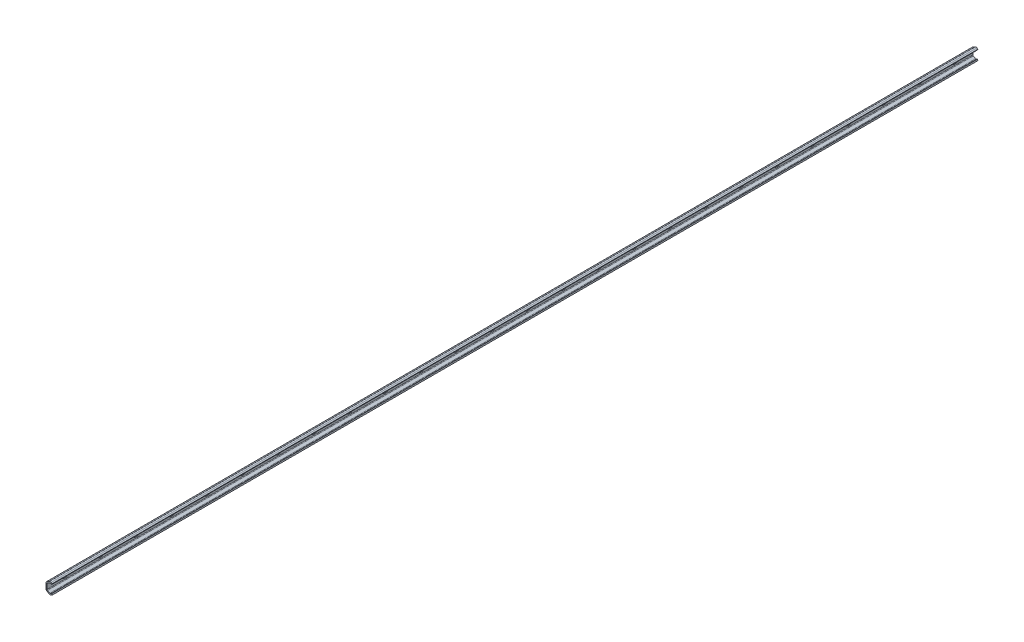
ISO-10303-21;
HEADER;
FILE_DESCRIPTION(('STEP AP214'),'2;1');
FILE_NAME('part.step','',(''),(''),'','','');
FILE_SCHEMA(('AUTOMOTIVE_DESIGN { 1 0 10303 214 1 1 1 1 }'));
ENDSEC;
DATA;
#1=APPLICATION_CONTEXT('core data for automotive mechanical design processes');
#2=APPLICATION_PROTOCOL_DEFINITION('international standard','automotive_design',2000,#1);
#3=PRODUCT_CONTEXT('',#1,'mechanical');
#4=PRODUCT('Part','Part','',(#3));
#5=PRODUCT_RELATED_PRODUCT_CATEGORY('part','',(#4));
#6=PRODUCT_DEFINITION_FORMATION('','',#4);
#7=PRODUCT_DEFINITION_CONTEXT('part definition',#1,'design');
#8=PRODUCT_DEFINITION('design','',#6,#7);
#9=PRODUCT_DEFINITION_SHAPE('','',#8);
#10=(LENGTH_UNIT() NAMED_UNIT(*) SI_UNIT(.MILLI.,.METRE.));
#11=(NAMED_UNIT(*) PLANE_ANGLE_UNIT() SI_UNIT($,.RADIAN.));
#12=(NAMED_UNIT(*) SI_UNIT($,.STERADIAN.) SOLID_ANGLE_UNIT());
#13=UNCERTAINTY_MEASURE_WITH_UNIT(LENGTH_MEASURE(1.E-05),#10,'distance_accuracy_value','');
#14=(GEOMETRIC_REPRESENTATION_CONTEXT(3) GLOBAL_UNCERTAINTY_ASSIGNED_CONTEXT((#13)) GLOBAL_UNIT_ASSIGNED_CONTEXT((#10,
#11,#12)) REPRESENTATION_CONTEXT('',''));
#15=CARTESIAN_POINT('',(0.,0.,0.));
#16=DIRECTION('',(0.,0.,1.));
#17=DIRECTION('',(1.,0.,0.));
#18=AXIS2_PLACEMENT_3D('',#15,#16,#17);
#19=CARTESIAN_POINT('',(0.,-3.,-2037.5));
#20=DIRECTION('',(0.,-1.,0.));
#21=DIRECTION('',(0.,0.,-1.));
#22=AXIS2_PLACEMENT_3D('',#19,#20,#21);
#23=PLANE('',#22);
#24=DIRECTION('',(0.,0.,-1.));
#25=VECTOR('',#24,1.);
#26=CARTESIAN_POINT('',(2.500179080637,-3.,-2037.5));
#27=LINE('',#26,#25);
#28=CARTESIAN_POINT('',(2.500179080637,-3.,-2037.5));
#29=VERTEX_POINT('',#28);
#30=CARTESIAN_POINT('',(2.500179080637,-3.,-2042.5));
#31=VERTEX_POINT('',#30);
#32=EDGE_CURVE('E2140',#29,#31,#27,.T.);
#33=ORIENTED_EDGE('',*,*,#32,.T.);
#34=DIRECTION('',(1.,0.,0.));
#35=VECTOR('',#34,1.);
#36=CARTESIAN_POINT('',(0.,-3.,-2042.5));
#37=LINE('',#36,#35);
#38=CARTESIAN_POINT('',(0.,-3.,-2042.5));
#39=VERTEX_POINT('',#38);
#40=EDGE_CURVE('E11',#39,#31,#37,.T.);
#41=ORIENTED_EDGE('',*,*,#40,.F.);
#42=DIRECTION('',(0.,0.,-1.));
#43=VECTOR('',#42,1.);
#44=CARTESIAN_POINT('',(0.,-3.,-2037.5));
#45=LINE('',#44,#43);
#46=CARTESIAN_POINT('',(0.,-3.,-2037.5));
#47=VERTEX_POINT('',#46);
#48=EDGE_CURVE('E2146',#47,#39,#45,.T.);
#49=ORIENTED_EDGE('',*,*,#48,.F.);
#50=DIRECTION('',(1.,0.,0.));
#51=VECTOR('',#50,1.);
#52=CARTESIAN_POINT('',(0.,-3.,-2037.5));
#53=LINE('',#52,#51);
#54=EDGE_CURVE('E2154',#47,#29,#53,.T.);
#55=ORIENTED_EDGE('',*,*,#54,.T.);
#56=EDGE_LOOP('',(#33,#41,#49,#55));
#57=FACE_BOUND('',#56,.T.);
#58=ADVANCED_FACE('F39',(#57),#23,.F.);
#59=CARTESIAN_POINT('',(0.,0.,-2042.5));
#60=DIRECTION('',(1.,0.,0.));
#61=DIRECTION('',(0.,0.,-1.));
#62=AXIS2_PLACEMENT_3D('',#59,#60,#61);
#63=CYLINDRICAL_SURFACE('',#62,3.);
#64=CARTESIAN_POINT('',(2.500179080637,0.,-2042.5));
#65=DIRECTION('',(1.,0.,0.));
#66=DIRECTION('',(0.,0.,-1.));
#67=AXIS2_PLACEMENT_3D('',#64,#65,#66);
#68=CIRCLE('',#67,3.);
#69=CARTESIAN_POINT('',(2.500179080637,3.,-2042.5));
#70=VERTEX_POINT('',#69);
#71=EDGE_CURVE('E2136',#31,#70,#68,.T.);
#72=ORIENTED_EDGE('',*,*,#71,.T.);
#73=DIRECTION('',(1.,0.,0.));
#74=VECTOR('',#73,1.);
#75=CARTESIAN_POINT('',(0.,3.,-2042.5));
#76=LINE('',#75,#74);
#77=CARTESIAN_POINT('',(0.,3.,-2042.5));
#78=VERTEX_POINT('',#77);
#79=EDGE_CURVE('E47',#78,#70,#76,.T.);
#80=ORIENTED_EDGE('',*,*,#79,.F.);
#81=CARTESIAN_POINT('',(0.,0.,-2042.5));
#82=DIRECTION('',(1.,0.,0.));
#83=DIRECTION('',(0.,0.,-1.));
#84=AXIS2_PLACEMENT_3D('',#81,#82,#83);
#85=CIRCLE('',#84,3.);
#86=EDGE_CURVE('E61',#39,#78,#85,.T.);
#87=ORIENTED_EDGE('',*,*,#86,.F.);
#88=ORIENTED_EDGE('',*,*,#40,.T.);
#89=EDGE_LOOP('',(#72,#80,#87,#88));
#90=FACE_BOUND('',#89,.T.);
#91=ADVANCED_FACE('F2167',(#90),#63,.F.);
#92=CARTESIAN_POINT('',(0.,3.,-2037.5));
#93=DIRECTION('',(0.,1.,0.));
#94=DIRECTION('',(0.,0.,1.));
#95=AXIS2_PLACEMENT_3D('',#92,#93,#94);
#96=PLANE('',#95);
#97=DIRECTION('',(0.,0.,1.));
#98=VECTOR('',#97,1.);
#99=CARTESIAN_POINT('',(2.500179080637,3.,-2037.5));
#100=LINE('',#99,#98);
#101=CARTESIAN_POINT('',(2.500179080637,3.,-2037.5));
#102=VERTEX_POINT('',#101);
#103=EDGE_CURVE('E2132',#70,#102,#100,.T.);
#104=ORIENTED_EDGE('',*,*,#103,.T.);
#105=DIRECTION('',(1.,0.,0.));
#106=VECTOR('',#105,1.);
#107=CARTESIAN_POINT('',(0.,3.,-2037.5));
#108=LINE('',#107,#106);
#109=CARTESIAN_POINT('',(0.,3.,-2037.5));
#110=VERTEX_POINT('',#109);
#111=EDGE_CURVE('E2158',#110,#102,#108,.T.);
#112=ORIENTED_EDGE('',*,*,#111,.F.);
#113=DIRECTION('',(0.,0.,1.));
#114=VECTOR('',#113,1.);
#115=CARTESIAN_POINT('',(0.,3.,-2037.5));
#116=LINE('',#115,#114);
#117=EDGE_CURVE('E2151',#78,#110,#116,.T.);
#118=ORIENTED_EDGE('',*,*,#117,.F.);
#119=ORIENTED_EDGE('',*,*,#79,.T.);
#120=EDGE_LOOP('',(#104,#112,#118,#119));
#121=FACE_BOUND('',#120,.T.);
#122=ADVANCED_FACE('F2164',(#121),#96,.F.);
#123=CARTESIAN_POINT('',(0.,0.,-2037.5));
#124=DIRECTION('',(1.,0.,0.));
#125=DIRECTION('',(0.,0.,-1.));
#126=AXIS2_PLACEMENT_3D('',#123,#124,#125);
#127=CYLINDRICAL_SURFACE('',#126,3.);
#128=CARTESIAN_POINT('',(2.500179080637,0.,-2037.5));
#129=DIRECTION('',(1.,0.,0.));
#130=DIRECTION('',(0.,0.,-1.));
#131=AXIS2_PLACEMENT_3D('',#128,#129,#130);
#132=CIRCLE('',#131,3.);
#133=EDGE_CURVE('E2129',#102,#29,#132,.T.);
#134=ORIENTED_EDGE('',*,*,#133,.T.);
#135=ORIENTED_EDGE('',*,*,#54,.F.);
#136=CARTESIAN_POINT('',(0.,0.,-2037.5));
#137=DIRECTION('',(1.,0.,0.));
#138=DIRECTION('',(0.,0.,-1.));
#139=AXIS2_PLACEMENT_3D('',#136,#137,#138);
#140=CIRCLE('',#139,3.);
#141=EDGE_CURVE('E54',#110,#47,#140,.T.);
#142=ORIENTED_EDGE('',*,*,#141,.F.);
#143=ORIENTED_EDGE('',*,*,#111,.T.);
#144=EDGE_LOOP('',(#134,#135,#142,#143));
#145=FACE_BOUND('',#144,.T.);
#146=ADVANCED_FACE('F2173',(#145),#127,.F.);
#147=CARTESIAN_POINT('',(0.,-3.,-1957.5));
#148=DIRECTION('',(0.,-1.,0.));
#149=DIRECTION('',(0.,0.,-1.));
#150=AXIS2_PLACEMENT_3D('',#147,#148,#149);
#151=PLANE('',#150);
#152=DIRECTION('',(0.,0.,-1.));
#153=VECTOR('',#152,1.);
#154=CARTESIAN_POINT('',(2.500179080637,-3.,-1957.5));
#155=LINE('',#154,#153);
#156=CARTESIAN_POINT('',(2.500179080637,-3.,-1957.5));
#157=VERTEX_POINT('',#156);
#158=CARTESIAN_POINT('',(2.500179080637,-3.,-1962.5));
#159=VERTEX_POINT('',#158);
#160=EDGE_CURVE('E2096',#157,#159,#155,.T.);
#161=ORIENTED_EDGE('',*,*,#160,.T.);
#162=DIRECTION('',(1.,0.,0.));
#163=VECTOR('',#162,1.);
#164=CARTESIAN_POINT('',(0.,-3.,-1962.5));
#165=LINE('',#164,#163);
#166=CARTESIAN_POINT('',(0.,-3.,-1962.5));
#167=VERTEX_POINT('',#166);
#168=EDGE_CURVE('E2125',#167,#159,#165,.T.);
#169=ORIENTED_EDGE('',*,*,#168,.F.);
#170=DIRECTION('',(0.,0.,-1.));
#171=VECTOR('',#170,1.);
#172=CARTESIAN_POINT('',(0.,-3.,-1957.5));
#173=LINE('',#172,#171);
#174=CARTESIAN_POINT('',(0.,-3.,-1957.5));
#175=VERTEX_POINT('',#174);
#176=EDGE_CURVE('E2103',#175,#167,#173,.T.);
#177=ORIENTED_EDGE('',*,*,#176,.F.);
#178=DIRECTION('',(1.,0.,0.));
#179=VECTOR('',#178,1.);
#180=CARTESIAN_POINT('',(0.,-3.,-1957.5));
#181=LINE('',#180,#179);
#182=EDGE_CURVE('E2113',#175,#157,#181,.T.);
#183=ORIENTED_EDGE('',*,*,#182,.T.);
#184=EDGE_LOOP('',(#161,#169,#177,#183));
#185=FACE_BOUND('',#184,.T.);
#186=ADVANCED_FACE('F2175',(#185),#151,.F.);
#187=CARTESIAN_POINT('',(0.,0.,-1962.5));
#188=DIRECTION('',(1.,0.,0.));
#189=DIRECTION('',(0.,0.,-1.));
#190=AXIS2_PLACEMENT_3D('',#187,#188,#189);
#191=CYLINDRICAL_SURFACE('',#190,3.);
#192=CARTESIAN_POINT('',(2.500179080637,0.,-1962.5));
#193=DIRECTION('',(1.,0.,0.));
#194=DIRECTION('',(0.,0.,-1.));
#195=AXIS2_PLACEMENT_3D('',#192,#193,#194);
#196=CIRCLE('',#195,3.);
#197=CARTESIAN_POINT('',(2.500179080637,3.,-1962.5));
#198=VERTEX_POINT('',#197);
#199=EDGE_CURVE('E2092',#159,#198,#196,.T.);
#200=ORIENTED_EDGE('',*,*,#199,.T.);
#201=DIRECTION('',(1.,0.,0.));
#202=VECTOR('',#201,1.);
#203=CARTESIAN_POINT('',(0.,3.,-1962.5));
#204=LINE('',#203,#202);
#205=CARTESIAN_POINT('',(0.,3.,-1962.5));
#206=VERTEX_POINT('',#205);
#207=EDGE_CURVE('E2121',#206,#198,#204,.T.);
#208=ORIENTED_EDGE('',*,*,#207,.F.);
#209=CARTESIAN_POINT('',(0.,0.,-1962.5));
#210=DIRECTION('',(1.,0.,0.));
#211=DIRECTION('',(0.,0.,-1.));
#212=AXIS2_PLACEMENT_3D('',#209,#210,#211);
#213=CIRCLE('',#212,3.);
#214=EDGE_CURVE('E2106',#167,#206,#213,.T.);
#215=ORIENTED_EDGE('',*,*,#214,.F.);
#216=ORIENTED_EDGE('',*,*,#168,.T.);
#217=EDGE_LOOP('',(#200,#208,#215,#216));
#218=FACE_BOUND('',#217,.T.);
#219=ADVANCED_FACE('F2181',(#218),#191,.F.);
#220=CARTESIAN_POINT('',(0.,3.,-1957.5));
#221=DIRECTION('',(0.,1.,0.));
#222=DIRECTION('',(0.,0.,1.));
#223=AXIS2_PLACEMENT_3D('',#220,#221,#222);
#224=PLANE('',#223);
#225=DIRECTION('',(0.,0.,1.));
#226=VECTOR('',#225,1.);
#227=CARTESIAN_POINT('',(2.500179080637,3.,-1957.5));
#228=LINE('',#227,#226);
#229=CARTESIAN_POINT('',(2.500179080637,3.,-1957.5));
#230=VERTEX_POINT('',#229);
#231=EDGE_CURVE('E2088',#198,#230,#228,.T.);
#232=ORIENTED_EDGE('',*,*,#231,.T.);
#233=DIRECTION('',(1.,0.,0.));
#234=VECTOR('',#233,1.);
#235=CARTESIAN_POINT('',(0.,3.,-1957.5));
#236=LINE('',#235,#234);
#237=CARTESIAN_POINT('',(0.,3.,-1957.5));
#238=VERTEX_POINT('',#237);
#239=EDGE_CURVE('E2117',#238,#230,#236,.T.);
#240=ORIENTED_EDGE('',*,*,#239,.F.);
#241=DIRECTION('',(0.,0.,1.));
#242=VECTOR('',#241,1.);
#243=CARTESIAN_POINT('',(0.,3.,-1957.5));
#244=LINE('',#243,#242);
#245=EDGE_CURVE('E2109',#206,#238,#244,.T.);
#246=ORIENTED_EDGE('',*,*,#245,.F.);
#247=ORIENTED_EDGE('',*,*,#207,.T.);
#248=EDGE_LOOP('',(#232,#240,#246,#247));
#249=FACE_BOUND('',#248,.T.);
#250=ADVANCED_FACE('F2209',(#249),#224,.F.);
#251=CARTESIAN_POINT('',(0.,0.,-1957.5));
#252=DIRECTION('',(1.,0.,0.));
#253=DIRECTION('',(0.,0.,-1.));
#254=AXIS2_PLACEMENT_3D('',#251,#252,#253);
#255=CYLINDRICAL_SURFACE('',#254,3.);
#256=CARTESIAN_POINT('',(2.500179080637,0.,-1957.5));
#257=DIRECTION('',(1.,0.,0.));
#258=DIRECTION('',(0.,0.,-1.));
#259=AXIS2_PLACEMENT_3D('',#256,#257,#258);
#260=CIRCLE('',#259,3.);
#261=EDGE_CURVE('E2085',#230,#157,#260,.T.);
#262=ORIENTED_EDGE('',*,*,#261,.T.);
#263=ORIENTED_EDGE('',*,*,#182,.F.);
#264=CARTESIAN_POINT('',(0.,0.,-1957.5));
#265=DIRECTION('',(1.,0.,0.));
#266=DIRECTION('',(0.,0.,-1.));
#267=AXIS2_PLACEMENT_3D('',#264,#265,#266);
#268=CIRCLE('',#267,3.);
#269=EDGE_CURVE('E2100',#238,#175,#268,.T.);
#270=ORIENTED_EDGE('',*,*,#269,.F.);
#271=ORIENTED_EDGE('',*,*,#239,.T.);
#272=EDGE_LOOP('',(#262,#263,#270,#271));
#273=FACE_BOUND('',#272,.T.);
#274=ADVANCED_FACE('F2218',(#273),#255,.F.);
#275=CARTESIAN_POINT('',(0.,-3.,-1877.5));
#276=DIRECTION('',(0.,-1.,0.));
#277=DIRECTION('',(0.,0.,-1.));
#278=AXIS2_PLACEMENT_3D('',#275,#276,#277);
#279=PLANE('',#278);
#280=DIRECTION('',(0.,0.,-1.));
#281=VECTOR('',#280,1.);
#282=CARTESIAN_POINT('',(2.500179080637,-3.,-1877.5));
#283=LINE('',#282,#281);
#284=CARTESIAN_POINT('',(2.500179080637,-3.,-1877.5));
#285=VERTEX_POINT('',#284);
#286=CARTESIAN_POINT('',(2.500179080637,-3.,-1882.5));
#287=VERTEX_POINT('',#286);
#288=EDGE_CURVE('E2052',#285,#287,#283,.T.);
#289=ORIENTED_EDGE('',*,*,#288,.T.);
#290=DIRECTION('',(1.,0.,0.));
#291=VECTOR('',#290,1.);
#292=CARTESIAN_POINT('',(0.,-3.,-1882.5));
#293=LINE('',#292,#291);
#294=CARTESIAN_POINT('',(0.,-3.,-1882.5));
#295=VERTEX_POINT('',#294);
#296=EDGE_CURVE('E2081',#295,#287,#293,.T.);
#297=ORIENTED_EDGE('',*,*,#296,.F.);
#298=DIRECTION('',(0.,0.,-1.));
#299=VECTOR('',#298,1.);
#300=CARTESIAN_POINT('',(0.,-3.,-1877.5));
#301=LINE('',#300,#299);
#302=CARTESIAN_POINT('',(0.,-3.,-1877.5));
#303=VERTEX_POINT('',#302);
#304=EDGE_CURVE('E2059',#303,#295,#301,.T.);
#305=ORIENTED_EDGE('',*,*,#304,.F.);
#306=DIRECTION('',(1.,0.,0.));
#307=VECTOR('',#306,1.);
#308=CARTESIAN_POINT('',(0.,-3.,-1877.5));
#309=LINE('',#308,#307);
#310=EDGE_CURVE('E2069',#303,#285,#309,.T.);
#311=ORIENTED_EDGE('',*,*,#310,.T.);
#312=EDGE_LOOP('',(#289,#297,#305,#311));
#313=FACE_BOUND('',#312,.T.);
#314=ADVANCED_FACE('F2227',(#313),#279,.F.);
#315=CARTESIAN_POINT('',(0.,0.,-1882.5));
#316=DIRECTION('',(1.,0.,0.));
#317=DIRECTION('',(0.,0.,-1.));
#318=AXIS2_PLACEMENT_3D('',#315,#316,#317);
#319=CYLINDRICAL_SURFACE('',#318,3.);
#320=CARTESIAN_POINT('',(2.500179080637,0.,-1882.5));
#321=DIRECTION('',(1.,0.,0.));
#322=DIRECTION('',(0.,0.,-1.));
#323=AXIS2_PLACEMENT_3D('',#320,#321,#322);
#324=CIRCLE('',#323,3.);
#325=CARTESIAN_POINT('',(2.500179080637,3.,-1882.5));
#326=VERTEX_POINT('',#325);
#327=EDGE_CURVE('E2048',#287,#326,#324,.T.);
#328=ORIENTED_EDGE('',*,*,#327,.T.);
#329=DIRECTION('',(1.,0.,0.));
#330=VECTOR('',#329,1.);
#331=CARTESIAN_POINT('',(0.,3.,-1882.5));
#332=LINE('',#331,#330);
#333=CARTESIAN_POINT('',(0.,3.,-1882.5));
#334=VERTEX_POINT('',#333);
#335=EDGE_CURVE('E2077',#334,#326,#332,.T.);
#336=ORIENTED_EDGE('',*,*,#335,.F.);
#337=CARTESIAN_POINT('',(0.,0.,-1882.5));
#338=DIRECTION('',(1.,0.,0.));
#339=DIRECTION('',(0.,0.,-1.));
#340=AXIS2_PLACEMENT_3D('',#337,#338,#339);
#341=CIRCLE('',#340,3.);
#342=EDGE_CURVE('E2062',#295,#334,#341,.T.);
#343=ORIENTED_EDGE('',*,*,#342,.F.);
#344=ORIENTED_EDGE('',*,*,#296,.T.);
#345=EDGE_LOOP('',(#328,#336,#343,#344));
#346=FACE_BOUND('',#345,.T.);
#347=ADVANCED_FACE('F2236',(#346),#319,.F.);
#348=CARTESIAN_POINT('',(0.,3.,-1877.5));
#349=DIRECTION('',(0.,1.,0.));
#350=DIRECTION('',(0.,0.,1.));
#351=AXIS2_PLACEMENT_3D('',#348,#349,#350);
#352=PLANE('',#351);
#353=DIRECTION('',(0.,0.,1.));
#354=VECTOR('',#353,1.);
#355=CARTESIAN_POINT('',(2.500179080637,3.,-1877.5));
#356=LINE('',#355,#354);
#357=CARTESIAN_POINT('',(2.500179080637,3.,-1877.5));
#358=VERTEX_POINT('',#357);
#359=EDGE_CURVE('E2044',#326,#358,#356,.T.);
#360=ORIENTED_EDGE('',*,*,#359,.T.);
#361=DIRECTION('',(1.,0.,0.));
#362=VECTOR('',#361,1.);
#363=CARTESIAN_POINT('',(0.,3.,-1877.5));
#364=LINE('',#363,#362);
#365=CARTESIAN_POINT('',(0.,3.,-1877.5));
#366=VERTEX_POINT('',#365);
#367=EDGE_CURVE('E2073',#366,#358,#364,.T.);
#368=ORIENTED_EDGE('',*,*,#367,.F.);
#369=DIRECTION('',(0.,0.,1.));
#370=VECTOR('',#369,1.);
#371=CARTESIAN_POINT('',(0.,3.,-1877.5));
#372=LINE('',#371,#370);
#373=EDGE_CURVE('E2065',#334,#366,#372,.T.);
#374=ORIENTED_EDGE('',*,*,#373,.F.);
#375=ORIENTED_EDGE('',*,*,#335,.T.);
#376=EDGE_LOOP('',(#360,#368,#374,#375));
#377=FACE_BOUND('',#376,.T.);
#378=ADVANCED_FACE('F2245',(#377),#352,.F.);
#379=CARTESIAN_POINT('',(0.,0.,-1877.5));
#380=DIRECTION('',(1.,0.,0.));
#381=DIRECTION('',(0.,0.,-1.));
#382=AXIS2_PLACEMENT_3D('',#379,#380,#381);
#383=CYLINDRICAL_SURFACE('',#382,3.);
#384=CARTESIAN_POINT('',(2.500179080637,0.,-1877.5));
#385=DIRECTION('',(1.,0.,0.));
#386=DIRECTION('',(0.,0.,-1.));
#387=AXIS2_PLACEMENT_3D('',#384,#385,#386);
#388=CIRCLE('',#387,3.);
#389=EDGE_CURVE('E2041',#358,#285,#388,.T.);
#390=ORIENTED_EDGE('',*,*,#389,.T.);
#391=ORIENTED_EDGE('',*,*,#310,.F.);
#392=CARTESIAN_POINT('',(0.,0.,-1877.5));
#393=DIRECTION('',(1.,0.,0.));
#394=DIRECTION('',(0.,0.,-1.));
#395=AXIS2_PLACEMENT_3D('',#392,#393,#394);
#396=CIRCLE('',#395,3.);
#397=EDGE_CURVE('E2056',#366,#303,#396,.T.);
#398=ORIENTED_EDGE('',*,*,#397,.F.);
#399=ORIENTED_EDGE('',*,*,#367,.T.);
#400=EDGE_LOOP('',(#390,#391,#398,#399));
#401=FACE_BOUND('',#400,.T.);
#402=ADVANCED_FACE('F2254',(#401),#383,.F.);
#403=CARTESIAN_POINT('',(0.,-3.,-1797.5));
#404=DIRECTION('',(0.,-1.,0.));
#405=DIRECTION('',(0.,0.,-1.));
#406=AXIS2_PLACEMENT_3D('',#403,#404,#405);
#407=PLANE('',#406);
#408=DIRECTION('',(0.,0.,-1.));
#409=VECTOR('',#408,1.);
#410=CARTESIAN_POINT('',(2.500179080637,-3.,-1797.5));
#411=LINE('',#410,#409);
#412=CARTESIAN_POINT('',(2.500179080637,-3.,-1797.5));
#413=VERTEX_POINT('',#412);
#414=CARTESIAN_POINT('',(2.500179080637,-3.,-1802.5));
#415=VERTEX_POINT('',#414);
#416=EDGE_CURVE('E2008',#413,#415,#411,.T.);
#417=ORIENTED_EDGE('',*,*,#416,.T.);
#418=DIRECTION('',(1.,0.,0.));
#419=VECTOR('',#418,1.);
#420=CARTESIAN_POINT('',(0.,-3.,-1802.5));
#421=LINE('',#420,#419);
#422=CARTESIAN_POINT('',(0.,-3.,-1802.5));
#423=VERTEX_POINT('',#422);
#424=EDGE_CURVE('E2037',#423,#415,#421,.T.);
#425=ORIENTED_EDGE('',*,*,#424,.F.);
#426=DIRECTION('',(0.,0.,-1.));
#427=VECTOR('',#426,1.);
#428=CARTESIAN_POINT('',(0.,-3.,-1797.5));
#429=LINE('',#428,#427);
#430=CARTESIAN_POINT('',(0.,-3.,-1797.5));
#431=VERTEX_POINT('',#430);
#432=EDGE_CURVE('E2015',#431,#423,#429,.T.);
#433=ORIENTED_EDGE('',*,*,#432,.F.);
#434=DIRECTION('',(1.,0.,0.));
#435=VECTOR('',#434,1.);
#436=CARTESIAN_POINT('',(0.,-3.,-1797.5));
#437=LINE('',#436,#435);
#438=EDGE_CURVE('E2025',#431,#413,#437,.T.);
#439=ORIENTED_EDGE('',*,*,#438,.T.);
#440=EDGE_LOOP('',(#417,#425,#433,#439));
#441=FACE_BOUND('',#440,.T.);
#442=ADVANCED_FACE('F2263',(#441),#407,.F.);
#443=CARTESIAN_POINT('',(0.,0.,-1802.5));
#444=DIRECTION('',(1.,0.,0.));
#445=DIRECTION('',(0.,0.,-1.));
#446=AXIS2_PLACEMENT_3D('',#443,#444,#445);
#447=CYLINDRICAL_SURFACE('',#446,3.);
#448=CARTESIAN_POINT('',(2.500179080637,0.,-1802.5));
#449=DIRECTION('',(1.,0.,0.));
#450=DIRECTION('',(0.,0.,-1.));
#451=AXIS2_PLACEMENT_3D('',#448,#449,#450);
#452=CIRCLE('',#451,3.);
#453=CARTESIAN_POINT('',(2.500179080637,3.,-1802.5));
#454=VERTEX_POINT('',#453);
#455=EDGE_CURVE('E2004',#415,#454,#452,.T.);
#456=ORIENTED_EDGE('',*,*,#455,.T.);
#457=DIRECTION('',(1.,0.,0.));
#458=VECTOR('',#457,1.);
#459=CARTESIAN_POINT('',(0.,3.,-1802.5));
#460=LINE('',#459,#458);
#461=CARTESIAN_POINT('',(0.,3.,-1802.5));
#462=VERTEX_POINT('',#461);
#463=EDGE_CURVE('E2033',#462,#454,#460,.T.);
#464=ORIENTED_EDGE('',*,*,#463,.F.);
#465=CARTESIAN_POINT('',(0.,0.,-1802.5));
#466=DIRECTION('',(1.,0.,0.));
#467=DIRECTION('',(0.,0.,-1.));
#468=AXIS2_PLACEMENT_3D('',#465,#466,#467);
#469=CIRCLE('',#468,3.);
#470=EDGE_CURVE('E2018',#423,#462,#469,.T.);
#471=ORIENTED_EDGE('',*,*,#470,.F.);
#472=ORIENTED_EDGE('',*,*,#424,.T.);
#473=EDGE_LOOP('',(#456,#464,#471,#472));
#474=FACE_BOUND('',#473,.T.);
#475=ADVANCED_FACE('F2272',(#474),#447,.F.);
#476=CARTESIAN_POINT('',(0.,3.,-1797.5));
#477=DIRECTION('',(0.,1.,0.));
#478=DIRECTION('',(0.,0.,1.));
#479=AXIS2_PLACEMENT_3D('',#476,#477,#478);
#480=PLANE('',#479);
#481=DIRECTION('',(0.,0.,1.));
#482=VECTOR('',#481,1.);
#483=CARTESIAN_POINT('',(2.500179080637,3.,-1797.5));
#484=LINE('',#483,#482);
#485=CARTESIAN_POINT('',(2.500179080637,3.,-1797.5));
#486=VERTEX_POINT('',#485);
#487=EDGE_CURVE('E2000',#454,#486,#484,.T.);
#488=ORIENTED_EDGE('',*,*,#487,.T.);
#489=DIRECTION('',(1.,0.,0.));
#490=VECTOR('',#489,1.);
#491=CARTESIAN_POINT('',(0.,3.,-1797.5));
#492=LINE('',#491,#490);
#493=CARTESIAN_POINT('',(0.,3.,-1797.5));
#494=VERTEX_POINT('',#493);
#495=EDGE_CURVE('E2029',#494,#486,#492,.T.);
#496=ORIENTED_EDGE('',*,*,#495,.F.);
#497=DIRECTION('',(0.,0.,1.));
#498=VECTOR('',#497,1.);
#499=CARTESIAN_POINT('',(0.,3.,-1797.5));
#500=LINE('',#499,#498);
#501=EDGE_CURVE('E2021',#462,#494,#500,.T.);
#502=ORIENTED_EDGE('',*,*,#501,.F.);
#503=ORIENTED_EDGE('',*,*,#463,.T.);
#504=EDGE_LOOP('',(#488,#496,#502,#503));
#505=FACE_BOUND('',#504,.T.);
#506=ADVANCED_FACE('F2281',(#505),#480,.F.);
#507=CARTESIAN_POINT('',(0.,0.,-1797.5));
#508=DIRECTION('',(1.,0.,0.));
#509=DIRECTION('',(0.,0.,-1.));
#510=AXIS2_PLACEMENT_3D('',#507,#508,#509);
#511=CYLINDRICAL_SURFACE('',#510,3.);
#512=CARTESIAN_POINT('',(2.500179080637,0.,-1797.5));
#513=DIRECTION('',(1.,0.,0.));
#514=DIRECTION('',(0.,0.,-1.));
#515=AXIS2_PLACEMENT_3D('',#512,#513,#514);
#516=CIRCLE('',#515,3.);
#517=EDGE_CURVE('E1997',#486,#413,#516,.T.);
#518=ORIENTED_EDGE('',*,*,#517,.T.);
#519=ORIENTED_EDGE('',*,*,#438,.F.);
#520=CARTESIAN_POINT('',(0.,0.,-1797.5));
#521=DIRECTION('',(1.,0.,0.));
#522=DIRECTION('',(0.,0.,-1.));
#523=AXIS2_PLACEMENT_3D('',#520,#521,#522);
#524=CIRCLE('',#523,3.);
#525=EDGE_CURVE('E2012',#494,#431,#524,.T.);
#526=ORIENTED_EDGE('',*,*,#525,.F.);
#527=ORIENTED_EDGE('',*,*,#495,.T.);
#528=EDGE_LOOP('',(#518,#519,#526,#527));
#529=FACE_BOUND('',#528,.T.);
#530=ADVANCED_FACE('F2290',(#529),#511,.F.);
#531=CARTESIAN_POINT('',(0.,-3.,-1717.5));
#532=DIRECTION('',(0.,-1.,0.));
#533=DIRECTION('',(0.,0.,-1.));
#534=AXIS2_PLACEMENT_3D('',#531,#532,#533);
#535=PLANE('',#534);
#536=DIRECTION('',(0.,0.,-1.));
#537=VECTOR('',#536,1.);
#538=CARTESIAN_POINT('',(2.500179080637,-3.,-1717.5));
#539=LINE('',#538,#537);
#540=CARTESIAN_POINT('',(2.500179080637,-3.,-1717.5));
#541=VERTEX_POINT('',#540);
#542=CARTESIAN_POINT('',(2.500179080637,-3.,-1722.5));
#543=VERTEX_POINT('',#542);
#544=EDGE_CURVE('E1964',#541,#543,#539,.T.);
#545=ORIENTED_EDGE('',*,*,#544,.T.);
#546=DIRECTION('',(1.,0.,0.));
#547=VECTOR('',#546,1.);
#548=CARTESIAN_POINT('',(0.,-3.,-1722.5));
#549=LINE('',#548,#547);
#550=CARTESIAN_POINT('',(0.,-3.,-1722.5));
#551=VERTEX_POINT('',#550);
#552=EDGE_CURVE('E1993',#551,#543,#549,.T.);
#553=ORIENTED_EDGE('',*,*,#552,.F.);
#554=DIRECTION('',(0.,0.,-1.));
#555=VECTOR('',#554,1.);
#556=CARTESIAN_POINT('',(0.,-3.,-1717.5));
#557=LINE('',#556,#555);
#558=CARTESIAN_POINT('',(0.,-3.,-1717.5));
#559=VERTEX_POINT('',#558);
#560=EDGE_CURVE('E1971',#559,#551,#557,.T.);
#561=ORIENTED_EDGE('',*,*,#560,.F.);
#562=DIRECTION('',(1.,0.,0.));
#563=VECTOR('',#562,1.);
#564=CARTESIAN_POINT('',(0.,-3.,-1717.5));
#565=LINE('',#564,#563);
#566=EDGE_CURVE('E1981',#559,#541,#565,.T.);
#567=ORIENTED_EDGE('',*,*,#566,.T.);
#568=EDGE_LOOP('',(#545,#553,#561,#567));
#569=FACE_BOUND('',#568,.T.);
#570=ADVANCED_FACE('F2299',(#569),#535,.F.);
#571=CARTESIAN_POINT('',(0.,0.,-1722.5));
#572=DIRECTION('',(1.,0.,0.));
#573=DIRECTION('',(0.,0.,-1.));
#574=AXIS2_PLACEMENT_3D('',#571,#572,#573);
#575=CYLINDRICAL_SURFACE('',#574,3.);
#576=CARTESIAN_POINT('',(2.500179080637,0.,-1722.5));
#577=DIRECTION('',(1.,0.,0.));
#578=DIRECTION('',(0.,0.,-1.));
#579=AXIS2_PLACEMENT_3D('',#576,#577,#578);
#580=CIRCLE('',#579,3.);
#581=CARTESIAN_POINT('',(2.500179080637,3.,-1722.5));
#582=VERTEX_POINT('',#581);
#583=EDGE_CURVE('E1960',#543,#582,#580,.T.);
#584=ORIENTED_EDGE('',*,*,#583,.T.);
#585=DIRECTION('',(1.,0.,0.));
#586=VECTOR('',#585,1.);
#587=CARTESIAN_POINT('',(0.,3.,-1722.5));
#588=LINE('',#587,#586);
#589=CARTESIAN_POINT('',(0.,3.,-1722.5));
#590=VERTEX_POINT('',#589);
#591=EDGE_CURVE('E1989',#590,#582,#588,.T.);
#592=ORIENTED_EDGE('',*,*,#591,.F.);
#593=CARTESIAN_POINT('',(0.,0.,-1722.5));
#594=DIRECTION('',(1.,0.,0.));
#595=DIRECTION('',(0.,0.,-1.));
#596=AXIS2_PLACEMENT_3D('',#593,#594,#595);
#597=CIRCLE('',#596,3.);
#598=EDGE_CURVE('E1974',#551,#590,#597,.T.);
#599=ORIENTED_EDGE('',*,*,#598,.F.);
#600=ORIENTED_EDGE('',*,*,#552,.T.);
#601=EDGE_LOOP('',(#584,#592,#599,#600));
#602=FACE_BOUND('',#601,.T.);
#603=ADVANCED_FACE('F2308',(#602),#575,.F.);
#604=CARTESIAN_POINT('',(0.,3.,-1717.5));
#605=DIRECTION('',(0.,1.,0.));
#606=DIRECTION('',(0.,0.,1.));
#607=AXIS2_PLACEMENT_3D('',#604,#605,#606);
#608=PLANE('',#607);
#609=DIRECTION('',(0.,0.,1.));
#610=VECTOR('',#609,1.);
#611=CARTESIAN_POINT('',(2.500179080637,3.,-1717.5));
#612=LINE('',#611,#610);
#613=CARTESIAN_POINT('',(2.500179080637,3.,-1717.5));
#614=VERTEX_POINT('',#613);
#615=EDGE_CURVE('E1956',#582,#614,#612,.T.);
#616=ORIENTED_EDGE('',*,*,#615,.T.);
#617=DIRECTION('',(1.,0.,0.));
#618=VECTOR('',#617,1.);
#619=CARTESIAN_POINT('',(0.,3.,-1717.5));
#620=LINE('',#619,#618);
#621=CARTESIAN_POINT('',(0.,3.,-1717.5));
#622=VERTEX_POINT('',#621);
#623=EDGE_CURVE('E1985',#622,#614,#620,.T.);
#624=ORIENTED_EDGE('',*,*,#623,.F.);
#625=DIRECTION('',(0.,0.,1.));
#626=VECTOR('',#625,1.);
#627=CARTESIAN_POINT('',(0.,3.,-1717.5));
#628=LINE('',#627,#626);
#629=EDGE_CURVE('E1977',#590,#622,#628,.T.);
#630=ORIENTED_EDGE('',*,*,#629,.F.);
#631=ORIENTED_EDGE('',*,*,#591,.T.);
#632=EDGE_LOOP('',(#616,#624,#630,#631));
#633=FACE_BOUND('',#632,.T.);
#634=ADVANCED_FACE('F2317',(#633),#608,.F.);
#635=CARTESIAN_POINT('',(0.,0.,-1717.5));
#636=DIRECTION('',(1.,0.,0.));
#637=DIRECTION('',(0.,0.,-1.));
#638=AXIS2_PLACEMENT_3D('',#635,#636,#637);
#639=CYLINDRICAL_SURFACE('',#638,3.);
#640=CARTESIAN_POINT('',(2.500179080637,0.,-1717.5));
#641=DIRECTION('',(1.,0.,0.));
#642=DIRECTION('',(0.,0.,-1.));
#643=AXIS2_PLACEMENT_3D('',#640,#641,#642);
#644=CIRCLE('',#643,3.);
#645=EDGE_CURVE('E1953',#614,#541,#644,.T.);
#646=ORIENTED_EDGE('',*,*,#645,.T.);
#647=ORIENTED_EDGE('',*,*,#566,.F.);
#648=CARTESIAN_POINT('',(0.,0.,-1717.5));
#649=DIRECTION('',(1.,0.,0.));
#650=DIRECTION('',(0.,0.,-1.));
#651=AXIS2_PLACEMENT_3D('',#648,#649,#650);
#652=CIRCLE('',#651,3.);
#653=EDGE_CURVE('E1968',#622,#559,#652,.T.);
#654=ORIENTED_EDGE('',*,*,#653,.F.);
#655=ORIENTED_EDGE('',*,*,#623,.T.);
#656=EDGE_LOOP('',(#646,#647,#654,#655));
#657=FACE_BOUND('',#656,.T.);
#658=ADVANCED_FACE('F2326',(#657),#639,.F.);
#659=CARTESIAN_POINT('',(0.,-3.,-1637.5));
#660=DIRECTION('',(0.,-1.,0.));
#661=DIRECTION('',(0.,0.,-1.));
#662=AXIS2_PLACEMENT_3D('',#659,#660,#661);
#663=PLANE('',#662);
#664=DIRECTION('',(0.,0.,-1.));
#665=VECTOR('',#664,1.);
#666=CARTESIAN_POINT('',(2.500179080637,-3.,-1637.5));
#667=LINE('',#666,#665);
#668=CARTESIAN_POINT('',(2.500179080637,-3.,-1637.5));
#669=VERTEX_POINT('',#668);
#670=CARTESIAN_POINT('',(2.500179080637,-3.,-1642.5));
#671=VERTEX_POINT('',#670);
#672=EDGE_CURVE('E1920',#669,#671,#667,.T.);
#673=ORIENTED_EDGE('',*,*,#672,.T.);
#674=DIRECTION('',(1.,0.,0.));
#675=VECTOR('',#674,1.);
#676=CARTESIAN_POINT('',(0.,-3.,-1642.5));
#677=LINE('',#676,#675);
#678=CARTESIAN_POINT('',(0.,-3.,-1642.5));
#679=VERTEX_POINT('',#678);
#680=EDGE_CURVE('E1949',#679,#671,#677,.T.);
#681=ORIENTED_EDGE('',*,*,#680,.F.);
#682=DIRECTION('',(0.,0.,-1.));
#683=VECTOR('',#682,1.);
#684=CARTESIAN_POINT('',(0.,-3.,-1637.5));
#685=LINE('',#684,#683);
#686=CARTESIAN_POINT('',(0.,-3.,-1637.5));
#687=VERTEX_POINT('',#686);
#688=EDGE_CURVE('E1927',#687,#679,#685,.T.);
#689=ORIENTED_EDGE('',*,*,#688,.F.);
#690=DIRECTION('',(1.,0.,0.));
#691=VECTOR('',#690,1.);
#692=CARTESIAN_POINT('',(0.,-3.,-1637.5));
#693=LINE('',#692,#691);
#694=EDGE_CURVE('E1937',#687,#669,#693,.T.);
#695=ORIENTED_EDGE('',*,*,#694,.T.);
#696=EDGE_LOOP('',(#673,#681,#689,#695));
#697=FACE_BOUND('',#696,.T.);
#698=ADVANCED_FACE('F2335',(#697),#663,.F.);
#699=CARTESIAN_POINT('',(0.,0.,-1642.5));
#700=DIRECTION('',(1.,0.,0.));
#701=DIRECTION('',(0.,0.,-1.));
#702=AXIS2_PLACEMENT_3D('',#699,#700,#701);
#703=CYLINDRICAL_SURFACE('',#702,3.);
#704=CARTESIAN_POINT('',(2.500179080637,0.,-1642.5));
#705=DIRECTION('',(1.,0.,0.));
#706=DIRECTION('',(0.,0.,-1.));
#707=AXIS2_PLACEMENT_3D('',#704,#705,#706);
#708=CIRCLE('',#707,3.);
#709=CARTESIAN_POINT('',(2.500179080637,3.,-1642.5));
#710=VERTEX_POINT('',#709);
#711=EDGE_CURVE('E1916',#671,#710,#708,.T.);
#712=ORIENTED_EDGE('',*,*,#711,.T.);
#713=DIRECTION('',(1.,0.,0.));
#714=VECTOR('',#713,1.);
#715=CARTESIAN_POINT('',(0.,3.,-1642.5));
#716=LINE('',#715,#714);
#717=CARTESIAN_POINT('',(0.,3.,-1642.5));
#718=VERTEX_POINT('',#717);
#719=EDGE_CURVE('E1945',#718,#710,#716,.T.);
#720=ORIENTED_EDGE('',*,*,#719,.F.);
#721=CARTESIAN_POINT('',(0.,0.,-1642.5));
#722=DIRECTION('',(1.,0.,0.));
#723=DIRECTION('',(0.,0.,-1.));
#724=AXIS2_PLACEMENT_3D('',#721,#722,#723);
#725=CIRCLE('',#724,3.);
#726=EDGE_CURVE('E1930',#679,#718,#725,.T.);
#727=ORIENTED_EDGE('',*,*,#726,.F.);
#728=ORIENTED_EDGE('',*,*,#680,.T.);
#729=EDGE_LOOP('',(#712,#720,#727,#728));
#730=FACE_BOUND('',#729,.T.);
#731=ADVANCED_FACE('F2344',(#730),#703,.F.);
#732=CARTESIAN_POINT('',(0.,3.,-1637.5));
#733=DIRECTION('',(0.,1.,0.));
#734=DIRECTION('',(0.,0.,1.));
#735=AXIS2_PLACEMENT_3D('',#732,#733,#734);
#736=PLANE('',#735);
#737=DIRECTION('',(0.,0.,1.));
#738=VECTOR('',#737,1.);
#739=CARTESIAN_POINT('',(2.500179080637,3.,-1637.5));
#740=LINE('',#739,#738);
#741=CARTESIAN_POINT('',(2.500179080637,3.,-1637.5));
#742=VERTEX_POINT('',#741);
#743=EDGE_CURVE('E1912',#710,#742,#740,.T.);
#744=ORIENTED_EDGE('',*,*,#743,.T.);
#745=DIRECTION('',(1.,0.,0.));
#746=VECTOR('',#745,1.);
#747=CARTESIAN_POINT('',(0.,3.,-1637.5));
#748=LINE('',#747,#746);
#749=CARTESIAN_POINT('',(0.,3.,-1637.5));
#750=VERTEX_POINT('',#749);
#751=EDGE_CURVE('E1941',#750,#742,#748,.T.);
#752=ORIENTED_EDGE('',*,*,#751,.F.);
#753=DIRECTION('',(0.,0.,1.));
#754=VECTOR('',#753,1.);
#755=CARTESIAN_POINT('',(0.,3.,-1637.5));
#756=LINE('',#755,#754);
#757=EDGE_CURVE('E1933',#718,#750,#756,.T.);
#758=ORIENTED_EDGE('',*,*,#757,.F.);
#759=ORIENTED_EDGE('',*,*,#719,.T.);
#760=EDGE_LOOP('',(#744,#752,#758,#759));
#761=FACE_BOUND('',#760,.T.);
#762=ADVANCED_FACE('F2353',(#761),#736,.F.);
#763=CARTESIAN_POINT('',(0.,0.,-1637.5));
#764=DIRECTION('',(1.,0.,0.));
#765=DIRECTION('',(0.,0.,-1.));
#766=AXIS2_PLACEMENT_3D('',#763,#764,#765);
#767=CYLINDRICAL_SURFACE('',#766,3.);
#768=CARTESIAN_POINT('',(2.500179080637,0.,-1637.5));
#769=DIRECTION('',(1.,0.,0.));
#770=DIRECTION('',(0.,0.,-1.));
#771=AXIS2_PLACEMENT_3D('',#768,#769,#770);
#772=CIRCLE('',#771,3.);
#773=EDGE_CURVE('E1909',#742,#669,#772,.T.);
#774=ORIENTED_EDGE('',*,*,#773,.T.);
#775=ORIENTED_EDGE('',*,*,#694,.F.);
#776=CARTESIAN_POINT('',(0.,0.,-1637.5));
#777=DIRECTION('',(1.,0.,0.));
#778=DIRECTION('',(0.,0.,-1.));
#779=AXIS2_PLACEMENT_3D('',#776,#777,#778);
#780=CIRCLE('',#779,3.);
#781=EDGE_CURVE('E1924',#750,#687,#780,.T.);
#782=ORIENTED_EDGE('',*,*,#781,.F.);
#783=ORIENTED_EDGE('',*,*,#751,.T.);
#784=EDGE_LOOP('',(#774,#775,#782,#783));
#785=FACE_BOUND('',#784,.T.);
#786=ADVANCED_FACE('F2362',(#785),#767,.F.);
#787=CARTESIAN_POINT('',(0.,-3.,-1557.5));
#788=DIRECTION('',(0.,-1.,0.));
#789=DIRECTION('',(0.,0.,-1.));
#790=AXIS2_PLACEMENT_3D('',#787,#788,#789);
#791=PLANE('',#790);
#792=DIRECTION('',(0.,0.,-1.));
#793=VECTOR('',#792,1.);
#794=CARTESIAN_POINT('',(2.500179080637,-3.,-1557.5));
#795=LINE('',#794,#793);
#796=CARTESIAN_POINT('',(2.500179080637,-3.,-1557.5));
#797=VERTEX_POINT('',#796);
#798=CARTESIAN_POINT('',(2.500179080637,-3.,-1562.5));
#799=VERTEX_POINT('',#798);
#800=EDGE_CURVE('E1876',#797,#799,#795,.T.);
#801=ORIENTED_EDGE('',*,*,#800,.T.);
#802=DIRECTION('',(1.,0.,0.));
#803=VECTOR('',#802,1.);
#804=CARTESIAN_POINT('',(0.,-3.,-1562.5));
#805=LINE('',#804,#803);
#806=CARTESIAN_POINT('',(0.,-3.,-1562.5));
#807=VERTEX_POINT('',#806);
#808=EDGE_CURVE('E1905',#807,#799,#805,.T.);
#809=ORIENTED_EDGE('',*,*,#808,.F.);
#810=DIRECTION('',(0.,0.,-1.));
#811=VECTOR('',#810,1.);
#812=CARTESIAN_POINT('',(0.,-3.,-1557.5));
#813=LINE('',#812,#811);
#814=CARTESIAN_POINT('',(0.,-3.,-1557.5));
#815=VERTEX_POINT('',#814);
#816=EDGE_CURVE('E1883',#815,#807,#813,.T.);
#817=ORIENTED_EDGE('',*,*,#816,.F.);
#818=DIRECTION('',(1.,0.,0.));
#819=VECTOR('',#818,1.);
#820=CARTESIAN_POINT('',(0.,-3.,-1557.5));
#821=LINE('',#820,#819);
#822=EDGE_CURVE('E1893',#815,#797,#821,.T.);
#823=ORIENTED_EDGE('',*,*,#822,.T.);
#824=EDGE_LOOP('',(#801,#809,#817,#823));
#825=FACE_BOUND('',#824,.T.);
#826=ADVANCED_FACE('F2371',(#825),#791,.F.);
#827=CARTESIAN_POINT('',(0.,0.,-1562.5));
#828=DIRECTION('',(1.,0.,0.));
#829=DIRECTION('',(0.,0.,-1.));
#830=AXIS2_PLACEMENT_3D('',#827,#828,#829);
#831=CYLINDRICAL_SURFACE('',#830,3.);
#832=CARTESIAN_POINT('',(2.500179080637,0.,-1562.5));
#833=DIRECTION('',(1.,0.,0.));
#834=DIRECTION('',(0.,0.,-1.));
#835=AXIS2_PLACEMENT_3D('',#832,#833,#834);
#836=CIRCLE('',#835,3.);
#837=CARTESIAN_POINT('',(2.500179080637,3.,-1562.5));
#838=VERTEX_POINT('',#837);
#839=EDGE_CURVE('E1872',#799,#838,#836,.T.);
#840=ORIENTED_EDGE('',*,*,#839,.T.);
#841=DIRECTION('',(1.,0.,0.));
#842=VECTOR('',#841,1.);
#843=CARTESIAN_POINT('',(0.,3.,-1562.5));
#844=LINE('',#843,#842);
#845=CARTESIAN_POINT('',(0.,3.,-1562.5));
#846=VERTEX_POINT('',#845);
#847=EDGE_CURVE('E1901',#846,#838,#844,.T.);
#848=ORIENTED_EDGE('',*,*,#847,.F.);
#849=CARTESIAN_POINT('',(0.,0.,-1562.5));
#850=DIRECTION('',(1.,0.,0.));
#851=DIRECTION('',(0.,0.,-1.));
#852=AXIS2_PLACEMENT_3D('',#849,#850,#851);
#853=CIRCLE('',#852,3.);
#854=EDGE_CURVE('E1886',#807,#846,#853,.T.);
#855=ORIENTED_EDGE('',*,*,#854,.F.);
#856=ORIENTED_EDGE('',*,*,#808,.T.);
#857=EDGE_LOOP('',(#840,#848,#855,#856));
#858=FACE_BOUND('',#857,.T.);
#859=ADVANCED_FACE('F2380',(#858),#831,.F.);
#860=CARTESIAN_POINT('',(0.,3.,-1557.5));
#861=DIRECTION('',(0.,1.,0.));
#862=DIRECTION('',(0.,0.,1.));
#863=AXIS2_PLACEMENT_3D('',#860,#861,#862);
#864=PLANE('',#863);
#865=DIRECTION('',(0.,0.,1.));
#866=VECTOR('',#865,1.);
#867=CARTESIAN_POINT('',(2.500179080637,3.,-1557.5));
#868=LINE('',#867,#866);
#869=CARTESIAN_POINT('',(2.500179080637,3.,-1557.5));
#870=VERTEX_POINT('',#869);
#871=EDGE_CURVE('E1868',#838,#870,#868,.T.);
#872=ORIENTED_EDGE('',*,*,#871,.T.);
#873=DIRECTION('',(1.,0.,0.));
#874=VECTOR('',#873,1.);
#875=CARTESIAN_POINT('',(0.,3.,-1557.5));
#876=LINE('',#875,#874);
#877=CARTESIAN_POINT('',(0.,3.,-1557.5));
#878=VERTEX_POINT('',#877);
#879=EDGE_CURVE('E1897',#878,#870,#876,.T.);
#880=ORIENTED_EDGE('',*,*,#879,.F.);
#881=DIRECTION('',(0.,0.,1.));
#882=VECTOR('',#881,1.);
#883=CARTESIAN_POINT('',(0.,3.,-1557.5));
#884=LINE('',#883,#882);
#885=EDGE_CURVE('E1889',#846,#878,#884,.T.);
#886=ORIENTED_EDGE('',*,*,#885,.F.);
#887=ORIENTED_EDGE('',*,*,#847,.T.);
#888=EDGE_LOOP('',(#872,#880,#886,#887));
#889=FACE_BOUND('',#888,.T.);
#890=ADVANCED_FACE('F2389',(#889),#864,.F.);
#891=CARTESIAN_POINT('',(0.,0.,-1557.5));
#892=DIRECTION('',(1.,0.,0.));
#893=DIRECTION('',(0.,0.,-1.));
#894=AXIS2_PLACEMENT_3D('',#891,#892,#893);
#895=CYLINDRICAL_SURFACE('',#894,3.);
#896=CARTESIAN_POINT('',(2.500179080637,0.,-1557.5));
#897=DIRECTION('',(1.,0.,0.));
#898=DIRECTION('',(0.,0.,-1.));
#899=AXIS2_PLACEMENT_3D('',#896,#897,#898);
#900=CIRCLE('',#899,3.);
#901=EDGE_CURVE('E1865',#870,#797,#900,.T.);
#902=ORIENTED_EDGE('',*,*,#901,.T.);
#903=ORIENTED_EDGE('',*,*,#822,.F.);
#904=CARTESIAN_POINT('',(0.,0.,-1557.5));
#905=DIRECTION('',(1.,0.,0.));
#906=DIRECTION('',(0.,0.,-1.));
#907=AXIS2_PLACEMENT_3D('',#904,#905,#906);
#908=CIRCLE('',#907,3.);
#909=EDGE_CURVE('E1880',#878,#815,#908,.T.);
#910=ORIENTED_EDGE('',*,*,#909,.F.);
#911=ORIENTED_EDGE('',*,*,#879,.T.);
#912=EDGE_LOOP('',(#902,#903,#910,#911));
#913=FACE_BOUND('',#912,.T.);
#914=ADVANCED_FACE('F2398',(#913),#895,.F.);
#915=CARTESIAN_POINT('',(0.,-3.,-1477.5));
#916=DIRECTION('',(0.,-1.,0.));
#917=DIRECTION('',(0.,0.,-1.));
#918=AXIS2_PLACEMENT_3D('',#915,#916,#917);
#919=PLANE('',#918);
#920=DIRECTION('',(0.,0.,-1.));
#921=VECTOR('',#920,1.);
#922=CARTESIAN_POINT('',(2.500179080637,-3.,-1477.5));
#923=LINE('',#922,#921);
#924=CARTESIAN_POINT('',(2.500179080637,-3.,-1477.5));
#925=VERTEX_POINT('',#924);
#926=CARTESIAN_POINT('',(2.500179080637,-3.,-1482.5));
#927=VERTEX_POINT('',#926);
#928=EDGE_CURVE('E1832',#925,#927,#923,.T.);
#929=ORIENTED_EDGE('',*,*,#928,.T.);
#930=DIRECTION('',(1.,0.,0.));
#931=VECTOR('',#930,1.);
#932=CARTESIAN_POINT('',(0.,-3.,-1482.5));
#933=LINE('',#932,#931);
#934=CARTESIAN_POINT('',(0.,-3.,-1482.5));
#935=VERTEX_POINT('',#934);
#936=EDGE_CURVE('E1861',#935,#927,#933,.T.);
#937=ORIENTED_EDGE('',*,*,#936,.F.);
#938=DIRECTION('',(0.,0.,-1.));
#939=VECTOR('',#938,1.);
#940=CARTESIAN_POINT('',(0.,-3.,-1477.5));
#941=LINE('',#940,#939);
#942=CARTESIAN_POINT('',(0.,-3.,-1477.5));
#943=VERTEX_POINT('',#942);
#944=EDGE_CURVE('E1839',#943,#935,#941,.T.);
#945=ORIENTED_EDGE('',*,*,#944,.F.);
#946=DIRECTION('',(1.,0.,0.));
#947=VECTOR('',#946,1.);
#948=CARTESIAN_POINT('',(0.,-3.,-1477.5));
#949=LINE('',#948,#947);
#950=EDGE_CURVE('E1849',#943,#925,#949,.T.);
#951=ORIENTED_EDGE('',*,*,#950,.T.);
#952=EDGE_LOOP('',(#929,#937,#945,#951));
#953=FACE_BOUND('',#952,.T.);
#954=ADVANCED_FACE('F2407',(#953),#919,.F.);
#955=CARTESIAN_POINT('',(0.,0.,-1482.5));
#956=DIRECTION('',(1.,0.,0.));
#957=DIRECTION('',(0.,0.,-1.));
#958=AXIS2_PLACEMENT_3D('',#955,#956,#957);
#959=CYLINDRICAL_SURFACE('',#958,3.);
#960=CARTESIAN_POINT('',(2.500179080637,0.,-1482.5));
#961=DIRECTION('',(1.,0.,0.));
#962=DIRECTION('',(0.,0.,-1.));
#963=AXIS2_PLACEMENT_3D('',#960,#961,#962);
#964=CIRCLE('',#963,3.);
#965=CARTESIAN_POINT('',(2.500179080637,3.,-1482.5));
#966=VERTEX_POINT('',#965);
#967=EDGE_CURVE('E1828',#927,#966,#964,.T.);
#968=ORIENTED_EDGE('',*,*,#967,.T.);
#969=DIRECTION('',(1.,0.,0.));
#970=VECTOR('',#969,1.);
#971=CARTESIAN_POINT('',(0.,3.,-1482.5));
#972=LINE('',#971,#970);
#973=CARTESIAN_POINT('',(0.,3.,-1482.5));
#974=VERTEX_POINT('',#973);
#975=EDGE_CURVE('E1857',#974,#966,#972,.T.);
#976=ORIENTED_EDGE('',*,*,#975,.F.);
#977=CARTESIAN_POINT('',(0.,0.,-1482.5));
#978=DIRECTION('',(1.,0.,0.));
#979=DIRECTION('',(0.,0.,-1.));
#980=AXIS2_PLACEMENT_3D('',#977,#978,#979);
#981=CIRCLE('',#980,3.);
#982=EDGE_CURVE('E1842',#935,#974,#981,.T.);
#983=ORIENTED_EDGE('',*,*,#982,.F.);
#984=ORIENTED_EDGE('',*,*,#936,.T.);
#985=EDGE_LOOP('',(#968,#976,#983,#984));
#986=FACE_BOUND('',#985,.T.);
#987=ADVANCED_FACE('F2416',(#986),#959,.F.);
#988=CARTESIAN_POINT('',(0.,3.,-1477.5));
#989=DIRECTION('',(0.,1.,0.));
#990=DIRECTION('',(0.,0.,1.));
#991=AXIS2_PLACEMENT_3D('',#988,#989,#990);
#992=PLANE('',#991);
#993=DIRECTION('',(0.,0.,1.));
#994=VECTOR('',#993,1.);
#995=CARTESIAN_POINT('',(2.500179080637,3.,-1477.5));
#996=LINE('',#995,#994);
#997=CARTESIAN_POINT('',(2.500179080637,3.,-1477.5));
#998=VERTEX_POINT('',#997);
#999=EDGE_CURVE('E1824',#966,#998,#996,.T.);
#1000=ORIENTED_EDGE('',*,*,#999,.T.);
#1001=DIRECTION('',(1.,0.,0.));
#1002=VECTOR('',#1001,1.);
#1003=CARTESIAN_POINT('',(0.,3.,-1477.5));
#1004=LINE('',#1003,#1002);
#1005=CARTESIAN_POINT('',(0.,3.,-1477.5));
#1006=VERTEX_POINT('',#1005);
#1007=EDGE_CURVE('E1853',#1006,#998,#1004,.T.);
#1008=ORIENTED_EDGE('',*,*,#1007,.F.);
#1009=DIRECTION('',(0.,0.,1.));
#1010=VECTOR('',#1009,1.);
#1011=CARTESIAN_POINT('',(0.,3.,-1477.5));
#1012=LINE('',#1011,#1010);
#1013=EDGE_CURVE('E1845',#974,#1006,#1012,.T.);
#1014=ORIENTED_EDGE('',*,*,#1013,.F.);
#1015=ORIENTED_EDGE('',*,*,#975,.T.);
#1016=EDGE_LOOP('',(#1000,#1008,#1014,#1015));
#1017=FACE_BOUND('',#1016,.T.);
#1018=ADVANCED_FACE('F2425',(#1017),#992,.F.);
#1019=CARTESIAN_POINT('',(0.,0.,-1477.5));
#1020=DIRECTION('',(1.,0.,0.));
#1021=DIRECTION('',(0.,0.,-1.));
#1022=AXIS2_PLACEMENT_3D('',#1019,#1020,#1021);
#1023=CYLINDRICAL_SURFACE('',#1022,3.);
#1024=CARTESIAN_POINT('',(2.500179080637,0.,-1477.5));
#1025=DIRECTION('',(1.,0.,0.));
#1026=DIRECTION('',(0.,0.,-1.));
#1027=AXIS2_PLACEMENT_3D('',#1024,#1025,#1026);
#1028=CIRCLE('',#1027,3.);
#1029=EDGE_CURVE('E1821',#998,#925,#1028,.T.);
#1030=ORIENTED_EDGE('',*,*,#1029,.T.);
#1031=ORIENTED_EDGE('',*,*,#950,.F.);
#1032=CARTESIAN_POINT('',(0.,0.,-1477.5));
#1033=DIRECTION('',(1.,0.,0.));
#1034=DIRECTION('',(0.,0.,-1.));
#1035=AXIS2_PLACEMENT_3D('',#1032,#1033,#1034);
#1036=CIRCLE('',#1035,3.);
#1037=EDGE_CURVE('E1836',#1006,#943,#1036,.T.);
#1038=ORIENTED_EDGE('',*,*,#1037,.F.);
#1039=ORIENTED_EDGE('',*,*,#1007,.T.);
#1040=EDGE_LOOP('',(#1030,#1031,#1038,#1039));
#1041=FACE_BOUND('',#1040,.T.);
#1042=ADVANCED_FACE('F2434',(#1041),#1023,.F.);
#1043=CARTESIAN_POINT('',(0.,-3.,-1397.5));
#1044=DIRECTION('',(0.,-1.,0.));
#1045=DIRECTION('',(0.,0.,-1.));
#1046=AXIS2_PLACEMENT_3D('',#1043,#1044,#1045);
#1047=PLANE('',#1046);
#1048=DIRECTION('',(0.,0.,-1.));
#1049=VECTOR('',#1048,1.);
#1050=CARTESIAN_POINT('',(2.500179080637,-3.,-1397.5));
#1051=LINE('',#1050,#1049);
#1052=CARTESIAN_POINT('',(2.500179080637,-3.,-1397.5));
#1053=VERTEX_POINT('',#1052);
#1054=CARTESIAN_POINT('',(2.500179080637,-3.,-1402.5));
#1055=VERTEX_POINT('',#1054);
#1056=EDGE_CURVE('E1788',#1053,#1055,#1051,.T.);
#1057=ORIENTED_EDGE('',*,*,#1056,.T.);
#1058=DIRECTION('',(1.,0.,0.));
#1059=VECTOR('',#1058,1.);
#1060=CARTESIAN_POINT('',(0.,-3.,-1402.5));
#1061=LINE('',#1060,#1059);
#1062=CARTESIAN_POINT('',(0.,-3.,-1402.5));
#1063=VERTEX_POINT('',#1062);
#1064=EDGE_CURVE('E1817',#1063,#1055,#1061,.T.);
#1065=ORIENTED_EDGE('',*,*,#1064,.F.);
#1066=DIRECTION('',(0.,0.,-1.));
#1067=VECTOR('',#1066,1.);
#1068=CARTESIAN_POINT('',(0.,-3.,-1397.5));
#1069=LINE('',#1068,#1067);
#1070=CARTESIAN_POINT('',(0.,-3.,-1397.5));
#1071=VERTEX_POINT('',#1070);
#1072=EDGE_CURVE('E1795',#1071,#1063,#1069,.T.);
#1073=ORIENTED_EDGE('',*,*,#1072,.F.);
#1074=DIRECTION('',(1.,0.,0.));
#1075=VECTOR('',#1074,1.);
#1076=CARTESIAN_POINT('',(0.,-3.,-1397.5));
#1077=LINE('',#1076,#1075);
#1078=EDGE_CURVE('E1805',#1071,#1053,#1077,.T.);
#1079=ORIENTED_EDGE('',*,*,#1078,.T.);
#1080=EDGE_LOOP('',(#1057,#1065,#1073,#1079));
#1081=FACE_BOUND('',#1080,.T.);
#1082=ADVANCED_FACE('F2443',(#1081),#1047,.F.);
#1083=CARTESIAN_POINT('',(0.,0.,-1402.5));
#1084=DIRECTION('',(1.,0.,0.));
#1085=DIRECTION('',(0.,0.,-1.));
#1086=AXIS2_PLACEMENT_3D('',#1083,#1084,#1085);
#1087=CYLINDRICAL_SURFACE('',#1086,3.);
#1088=CARTESIAN_POINT('',(2.500179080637,0.,-1402.5));
#1089=DIRECTION('',(1.,0.,0.));
#1090=DIRECTION('',(0.,0.,-1.));
#1091=AXIS2_PLACEMENT_3D('',#1088,#1089,#1090);
#1092=CIRCLE('',#1091,3.);
#1093=CARTESIAN_POINT('',(2.500179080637,3.,-1402.5));
#1094=VERTEX_POINT('',#1093);
#1095=EDGE_CURVE('E1784',#1055,#1094,#1092,.T.);
#1096=ORIENTED_EDGE('',*,*,#1095,.T.);
#1097=DIRECTION('',(1.,0.,0.));
#1098=VECTOR('',#1097,1.);
#1099=CARTESIAN_POINT('',(0.,3.,-1402.5));
#1100=LINE('',#1099,#1098);
#1101=CARTESIAN_POINT('',(0.,3.,-1402.5));
#1102=VERTEX_POINT('',#1101);
#1103=EDGE_CURVE('E1813',#1102,#1094,#1100,.T.);
#1104=ORIENTED_EDGE('',*,*,#1103,.F.);
#1105=CARTESIAN_POINT('',(0.,0.,-1402.5));
#1106=DIRECTION('',(1.,0.,0.));
#1107=DIRECTION('',(0.,0.,-1.));
#1108=AXIS2_PLACEMENT_3D('',#1105,#1106,#1107);
#1109=CIRCLE('',#1108,3.);
#1110=EDGE_CURVE('E1798',#1063,#1102,#1109,.T.);
#1111=ORIENTED_EDGE('',*,*,#1110,.F.);
#1112=ORIENTED_EDGE('',*,*,#1064,.T.);
#1113=EDGE_LOOP('',(#1096,#1104,#1111,#1112));
#1114=FACE_BOUND('',#1113,.T.);
#1115=ADVANCED_FACE('F2452',(#1114),#1087,.F.);
#1116=CARTESIAN_POINT('',(0.,3.,-1397.5));
#1117=DIRECTION('',(0.,1.,0.));
#1118=DIRECTION('',(0.,0.,1.));
#1119=AXIS2_PLACEMENT_3D('',#1116,#1117,#1118);
#1120=PLANE('',#1119);
#1121=DIRECTION('',(0.,0.,1.));
#1122=VECTOR('',#1121,1.);
#1123=CARTESIAN_POINT('',(2.500179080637,3.,-1397.5));
#1124=LINE('',#1123,#1122);
#1125=CARTESIAN_POINT('',(2.500179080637,3.,-1397.5));
#1126=VERTEX_POINT('',#1125);
#1127=EDGE_CURVE('E1780',#1094,#1126,#1124,.T.);
#1128=ORIENTED_EDGE('',*,*,#1127,.T.);
#1129=DIRECTION('',(1.,0.,0.));
#1130=VECTOR('',#1129,1.);
#1131=CARTESIAN_POINT('',(0.,3.,-1397.5));
#1132=LINE('',#1131,#1130);
#1133=CARTESIAN_POINT('',(0.,3.,-1397.5));
#1134=VERTEX_POINT('',#1133);
#1135=EDGE_CURVE('E1809',#1134,#1126,#1132,.T.);
#1136=ORIENTED_EDGE('',*,*,#1135,.F.);
#1137=DIRECTION('',(0.,0.,1.));
#1138=VECTOR('',#1137,1.);
#1139=CARTESIAN_POINT('',(0.,3.,-1397.5));
#1140=LINE('',#1139,#1138);
#1141=EDGE_CURVE('E1801',#1102,#1134,#1140,.T.);
#1142=ORIENTED_EDGE('',*,*,#1141,.F.);
#1143=ORIENTED_EDGE('',*,*,#1103,.T.);
#1144=EDGE_LOOP('',(#1128,#1136,#1142,#1143));
#1145=FACE_BOUND('',#1144,.T.);
#1146=ADVANCED_FACE('F2461',(#1145),#1120,.F.);
#1147=CARTESIAN_POINT('',(0.,0.,-1397.5));
#1148=DIRECTION('',(1.,0.,0.));
#1149=DIRECTION('',(0.,0.,-1.));
#1150=AXIS2_PLACEMENT_3D('',#1147,#1148,#1149);
#1151=CYLINDRICAL_SURFACE('',#1150,3.);
#1152=CARTESIAN_POINT('',(2.500179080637,0.,-1397.5));
#1153=DIRECTION('',(1.,0.,0.));
#1154=DIRECTION('',(0.,0.,-1.));
#1155=AXIS2_PLACEMENT_3D('',#1152,#1153,#1154);
#1156=CIRCLE('',#1155,3.);
#1157=EDGE_CURVE('E1777',#1126,#1053,#1156,.T.);
#1158=ORIENTED_EDGE('',*,*,#1157,.T.);
#1159=ORIENTED_EDGE('',*,*,#1078,.F.);
#1160=CARTESIAN_POINT('',(0.,0.,-1397.5));
#1161=DIRECTION('',(1.,0.,0.));
#1162=DIRECTION('',(0.,0.,-1.));
#1163=AXIS2_PLACEMENT_3D('',#1160,#1161,#1162);
#1164=CIRCLE('',#1163,3.);
#1165=EDGE_CURVE('E1792',#1134,#1071,#1164,.T.);
#1166=ORIENTED_EDGE('',*,*,#1165,.F.);
#1167=ORIENTED_EDGE('',*,*,#1135,.T.);
#1168=EDGE_LOOP('',(#1158,#1159,#1166,#1167));
#1169=FACE_BOUND('',#1168,.T.);
#1170=ADVANCED_FACE('F2470',(#1169),#1151,.F.);
#1171=CARTESIAN_POINT('',(0.,-3.,-1317.5));
#1172=DIRECTION('',(0.,-1.,0.));
#1173=DIRECTION('',(0.,0.,-1.));
#1174=AXIS2_PLACEMENT_3D('',#1171,#1172,#1173);
#1175=PLANE('',#1174);
#1176=DIRECTION('',(0.,0.,-1.));
#1177=VECTOR('',#1176,1.);
#1178=CARTESIAN_POINT('',(2.500179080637,-3.,-1317.5));
#1179=LINE('',#1178,#1177);
#1180=CARTESIAN_POINT('',(2.500179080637,-3.,-1317.5));
#1181=VERTEX_POINT('',#1180);
#1182=CARTESIAN_POINT('',(2.500179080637,-3.,-1322.5));
#1183=VERTEX_POINT('',#1182);
#1184=EDGE_CURVE('E1744',#1181,#1183,#1179,.T.);
#1185=ORIENTED_EDGE('',*,*,#1184,.T.);
#1186=DIRECTION('',(1.,0.,0.));
#1187=VECTOR('',#1186,1.);
#1188=CARTESIAN_POINT('',(0.,-3.,-1322.5));
#1189=LINE('',#1188,#1187);
#1190=CARTESIAN_POINT('',(0.,-3.,-1322.5));
#1191=VERTEX_POINT('',#1190);
#1192=EDGE_CURVE('E1773',#1191,#1183,#1189,.T.);
#1193=ORIENTED_EDGE('',*,*,#1192,.F.);
#1194=DIRECTION('',(0.,0.,-1.));
#1195=VECTOR('',#1194,1.);
#1196=CARTESIAN_POINT('',(0.,-3.,-1317.5));
#1197=LINE('',#1196,#1195);
#1198=CARTESIAN_POINT('',(0.,-3.,-1317.5));
#1199=VERTEX_POINT('',#1198);
#1200=EDGE_CURVE('E1751',#1199,#1191,#1197,.T.);
#1201=ORIENTED_EDGE('',*,*,#1200,.F.);
#1202=DIRECTION('',(1.,0.,0.));
#1203=VECTOR('',#1202,1.);
#1204=CARTESIAN_POINT('',(0.,-3.,-1317.5));
#1205=LINE('',#1204,#1203);
#1206=EDGE_CURVE('E1761',#1199,#1181,#1205,.T.);
#1207=ORIENTED_EDGE('',*,*,#1206,.T.);
#1208=EDGE_LOOP('',(#1185,#1193,#1201,#1207));
#1209=FACE_BOUND('',#1208,.T.);
#1210=ADVANCED_FACE('F2479',(#1209),#1175,.F.);
#1211=CARTESIAN_POINT('',(0.,0.,-1322.5));
#1212=DIRECTION('',(1.,0.,0.));
#1213=DIRECTION('',(0.,0.,-1.));
#1214=AXIS2_PLACEMENT_3D('',#1211,#1212,#1213);
#1215=CYLINDRICAL_SURFACE('',#1214,3.);
#1216=CARTESIAN_POINT('',(2.500179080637,0.,-1322.5));
#1217=DIRECTION('',(1.,0.,0.));
#1218=DIRECTION('',(0.,0.,-1.));
#1219=AXIS2_PLACEMENT_3D('',#1216,#1217,#1218);
#1220=CIRCLE('',#1219,3.);
#1221=CARTESIAN_POINT('',(2.500179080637,3.,-1322.5));
#1222=VERTEX_POINT('',#1221);
#1223=EDGE_CURVE('E1740',#1183,#1222,#1220,.T.);
#1224=ORIENTED_EDGE('',*,*,#1223,.T.);
#1225=DIRECTION('',(1.,0.,0.));
#1226=VECTOR('',#1225,1.);
#1227=CARTESIAN_POINT('',(0.,3.,-1322.5));
#1228=LINE('',#1227,#1226);
#1229=CARTESIAN_POINT('',(0.,3.,-1322.5));
#1230=VERTEX_POINT('',#1229);
#1231=EDGE_CURVE('E1769',#1230,#1222,#1228,.T.);
#1232=ORIENTED_EDGE('',*,*,#1231,.F.);
#1233=CARTESIAN_POINT('',(0.,0.,-1322.5));
#1234=DIRECTION('',(1.,0.,0.));
#1235=DIRECTION('',(0.,0.,-1.));
#1236=AXIS2_PLACEMENT_3D('',#1233,#1234,#1235);
#1237=CIRCLE('',#1236,3.);
#1238=EDGE_CURVE('E1754',#1191,#1230,#1237,.T.);
#1239=ORIENTED_EDGE('',*,*,#1238,.F.);
#1240=ORIENTED_EDGE('',*,*,#1192,.T.);
#1241=EDGE_LOOP('',(#1224,#1232,#1239,#1240));
#1242=FACE_BOUND('',#1241,.T.);
#1243=ADVANCED_FACE('F2488',(#1242),#1215,.F.);
#1244=CARTESIAN_POINT('',(0.,3.,-1317.5));
#1245=DIRECTION('',(0.,1.,0.));
#1246=DIRECTION('',(0.,0.,1.));
#1247=AXIS2_PLACEMENT_3D('',#1244,#1245,#1246);
#1248=PLANE('',#1247);
#1249=DIRECTION('',(0.,0.,1.));
#1250=VECTOR('',#1249,1.);
#1251=CARTESIAN_POINT('',(2.500179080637,3.,-1317.5));
#1252=LINE('',#1251,#1250);
#1253=CARTESIAN_POINT('',(2.500179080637,3.,-1317.5));
#1254=VERTEX_POINT('',#1253);
#1255=EDGE_CURVE('E1736',#1222,#1254,#1252,.T.);
#1256=ORIENTED_EDGE('',*,*,#1255,.T.);
#1257=DIRECTION('',(1.,0.,0.));
#1258=VECTOR('',#1257,1.);
#1259=CARTESIAN_POINT('',(0.,3.,-1317.5));
#1260=LINE('',#1259,#1258);
#1261=CARTESIAN_POINT('',(0.,3.,-1317.5));
#1262=VERTEX_POINT('',#1261);
#1263=EDGE_CURVE('E1765',#1262,#1254,#1260,.T.);
#1264=ORIENTED_EDGE('',*,*,#1263,.F.);
#1265=DIRECTION('',(0.,0.,1.));
#1266=VECTOR('',#1265,1.);
#1267=CARTESIAN_POINT('',(0.,3.,-1317.5));
#1268=LINE('',#1267,#1266);
#1269=EDGE_CURVE('E1757',#1230,#1262,#1268,.T.);
#1270=ORIENTED_EDGE('',*,*,#1269,.F.);
#1271=ORIENTED_EDGE('',*,*,#1231,.T.);
#1272=EDGE_LOOP('',(#1256,#1264,#1270,#1271));
#1273=FACE_BOUND('',#1272,.T.);
#1274=ADVANCED_FACE('F2497',(#1273),#1248,.F.);
#1275=CARTESIAN_POINT('',(0.,0.,-1317.5));
#1276=DIRECTION('',(1.,0.,0.));
#1277=DIRECTION('',(0.,0.,-1.));
#1278=AXIS2_PLACEMENT_3D('',#1275,#1276,#1277);
#1279=CYLINDRICAL_SURFACE('',#1278,3.);
#1280=CARTESIAN_POINT('',(2.500179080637,0.,-1317.5));
#1281=DIRECTION('',(1.,0.,0.));
#1282=DIRECTION('',(0.,0.,-1.));
#1283=AXIS2_PLACEMENT_3D('',#1280,#1281,#1282);
#1284=CIRCLE('',#1283,3.);
#1285=EDGE_CURVE('E1733',#1254,#1181,#1284,.T.);
#1286=ORIENTED_EDGE('',*,*,#1285,.T.);
#1287=ORIENTED_EDGE('',*,*,#1206,.F.);
#1288=CARTESIAN_POINT('',(0.,0.,-1317.5));
#1289=DIRECTION('',(1.,0.,0.));
#1290=DIRECTION('',(0.,0.,-1.));
#1291=AXIS2_PLACEMENT_3D('',#1288,#1289,#1290);
#1292=CIRCLE('',#1291,3.);
#1293=EDGE_CURVE('E1748',#1262,#1199,#1292,.T.);
#1294=ORIENTED_EDGE('',*,*,#1293,.F.);
#1295=ORIENTED_EDGE('',*,*,#1263,.T.);
#1296=EDGE_LOOP('',(#1286,#1287,#1294,#1295));
#1297=FACE_BOUND('',#1296,.T.);
#1298=ADVANCED_FACE('F2506',(#1297),#1279,.F.);
#1299=CARTESIAN_POINT('',(0.,-3.,-1237.5));
#1300=DIRECTION('',(0.,-1.,0.));
#1301=DIRECTION('',(0.,0.,-1.));
#1302=AXIS2_PLACEMENT_3D('',#1299,#1300,#1301);
#1303=PLANE('',#1302);
#1304=DIRECTION('',(0.,0.,-1.));
#1305=VECTOR('',#1304,1.);
#1306=CARTESIAN_POINT('',(2.500179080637,-3.,-1237.5));
#1307=LINE('',#1306,#1305);
#1308=CARTESIAN_POINT('',(2.500179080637,-3.,-1237.5));
#1309=VERTEX_POINT('',#1308);
#1310=CARTESIAN_POINT('',(2.500179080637,-3.,-1242.5));
#1311=VERTEX_POINT('',#1310);
#1312=EDGE_CURVE('E1700',#1309,#1311,#1307,.T.);
#1313=ORIENTED_EDGE('',*,*,#1312,.T.);
#1314=DIRECTION('',(1.,0.,0.));
#1315=VECTOR('',#1314,1.);
#1316=CARTESIAN_POINT('',(0.,-3.,-1242.5));
#1317=LINE('',#1316,#1315);
#1318=CARTESIAN_POINT('',(0.,-3.,-1242.5));
#1319=VERTEX_POINT('',#1318);
#1320=EDGE_CURVE('E1729',#1319,#1311,#1317,.T.);
#1321=ORIENTED_EDGE('',*,*,#1320,.F.);
#1322=DIRECTION('',(0.,0.,-1.));
#1323=VECTOR('',#1322,1.);
#1324=CARTESIAN_POINT('',(0.,-3.,-1237.5));
#1325=LINE('',#1324,#1323);
#1326=CARTESIAN_POINT('',(0.,-3.,-1237.5));
#1327=VERTEX_POINT('',#1326);
#1328=EDGE_CURVE('E1707',#1327,#1319,#1325,.T.);
#1329=ORIENTED_EDGE('',*,*,#1328,.F.);
#1330=DIRECTION('',(1.,0.,0.));
#1331=VECTOR('',#1330,1.);
#1332=CARTESIAN_POINT('',(0.,-3.,-1237.5));
#1333=LINE('',#1332,#1331);
#1334=EDGE_CURVE('E1717',#1327,#1309,#1333,.T.);
#1335=ORIENTED_EDGE('',*,*,#1334,.T.);
#1336=EDGE_LOOP('',(#1313,#1321,#1329,#1335));
#1337=FACE_BOUND('',#1336,.T.);
#1338=ADVANCED_FACE('F2515',(#1337),#1303,.F.);
#1339=CARTESIAN_POINT('',(0.,0.,-1242.5));
#1340=DIRECTION('',(1.,0.,0.));
#1341=DIRECTION('',(0.,0.,-1.));
#1342=AXIS2_PLACEMENT_3D('',#1339,#1340,#1341);
#1343=CYLINDRICAL_SURFACE('',#1342,3.);
#1344=CARTESIAN_POINT('',(2.500179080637,0.,-1242.5));
#1345=DIRECTION('',(1.,0.,0.));
#1346=DIRECTION('',(0.,0.,-1.));
#1347=AXIS2_PLACEMENT_3D('',#1344,#1345,#1346);
#1348=CIRCLE('',#1347,3.);
#1349=CARTESIAN_POINT('',(2.500179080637,3.,-1242.5));
#1350=VERTEX_POINT('',#1349);
#1351=EDGE_CURVE('E1696',#1311,#1350,#1348,.T.);
#1352=ORIENTED_EDGE('',*,*,#1351,.T.);
#1353=DIRECTION('',(1.,0.,0.));
#1354=VECTOR('',#1353,1.);
#1355=CARTESIAN_POINT('',(0.,3.,-1242.5));
#1356=LINE('',#1355,#1354);
#1357=CARTESIAN_POINT('',(0.,3.,-1242.5));
#1358=VERTEX_POINT('',#1357);
#1359=EDGE_CURVE('E1725',#1358,#1350,#1356,.T.);
#1360=ORIENTED_EDGE('',*,*,#1359,.F.);
#1361=CARTESIAN_POINT('',(0.,0.,-1242.5));
#1362=DIRECTION('',(1.,0.,0.));
#1363=DIRECTION('',(0.,0.,-1.));
#1364=AXIS2_PLACEMENT_3D('',#1361,#1362,#1363);
#1365=CIRCLE('',#1364,3.);
#1366=EDGE_CURVE('E1710',#1319,#1358,#1365,.T.);
#1367=ORIENTED_EDGE('',*,*,#1366,.F.);
#1368=ORIENTED_EDGE('',*,*,#1320,.T.);
#1369=EDGE_LOOP('',(#1352,#1360,#1367,#1368));
#1370=FACE_BOUND('',#1369,.T.);
#1371=ADVANCED_FACE('F2524',(#1370),#1343,.F.);
#1372=CARTESIAN_POINT('',(0.,3.,-1237.5));
#1373=DIRECTION('',(0.,1.,0.));
#1374=DIRECTION('',(0.,0.,1.));
#1375=AXIS2_PLACEMENT_3D('',#1372,#1373,#1374);
#1376=PLANE('',#1375);
#1377=DIRECTION('',(0.,0.,1.));
#1378=VECTOR('',#1377,1.);
#1379=CARTESIAN_POINT('',(2.500179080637,3.,-1237.5));
#1380=LINE('',#1379,#1378);
#1381=CARTESIAN_POINT('',(2.500179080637,3.,-1237.5));
#1382=VERTEX_POINT('',#1381);
#1383=EDGE_CURVE('E1692',#1350,#1382,#1380,.T.);
#1384=ORIENTED_EDGE('',*,*,#1383,.T.);
#1385=DIRECTION('',(1.,0.,0.));
#1386=VECTOR('',#1385,1.);
#1387=CARTESIAN_POINT('',(0.,3.,-1237.5));
#1388=LINE('',#1387,#1386);
#1389=CARTESIAN_POINT('',(0.,3.,-1237.5));
#1390=VERTEX_POINT('',#1389);
#1391=EDGE_CURVE('E1721',#1390,#1382,#1388,.T.);
#1392=ORIENTED_EDGE('',*,*,#1391,.F.);
#1393=DIRECTION('',(0.,0.,1.));
#1394=VECTOR('',#1393,1.);
#1395=CARTESIAN_POINT('',(0.,3.,-1237.5));
#1396=LINE('',#1395,#1394);
#1397=EDGE_CURVE('E1713',#1358,#1390,#1396,.T.);
#1398=ORIENTED_EDGE('',*,*,#1397,.F.);
#1399=ORIENTED_EDGE('',*,*,#1359,.T.);
#1400=EDGE_LOOP('',(#1384,#1392,#1398,#1399));
#1401=FACE_BOUND('',#1400,.T.);
#1402=ADVANCED_FACE('F2533',(#1401),#1376,.F.);
#1403=CARTESIAN_POINT('',(0.,0.,-1237.5));
#1404=DIRECTION('',(1.,0.,0.));
#1405=DIRECTION('',(0.,0.,-1.));
#1406=AXIS2_PLACEMENT_3D('',#1403,#1404,#1405);
#1407=CYLINDRICAL_SURFACE('',#1406,3.);
#1408=CARTESIAN_POINT('',(2.500179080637,0.,-1237.5));
#1409=DIRECTION('',(1.,0.,0.));
#1410=DIRECTION('',(0.,0.,-1.));
#1411=AXIS2_PLACEMENT_3D('',#1408,#1409,#1410);
#1412=CIRCLE('',#1411,3.);
#1413=EDGE_CURVE('E1689',#1382,#1309,#1412,.T.);
#1414=ORIENTED_EDGE('',*,*,#1413,.T.);
#1415=ORIENTED_EDGE('',*,*,#1334,.F.);
#1416=CARTESIAN_POINT('',(0.,0.,-1237.5));
#1417=DIRECTION('',(1.,0.,0.));
#1418=DIRECTION('',(0.,0.,-1.));
#1419=AXIS2_PLACEMENT_3D('',#1416,#1417,#1418);
#1420=CIRCLE('',#1419,3.);
#1421=EDGE_CURVE('E1704',#1390,#1327,#1420,.T.);
#1422=ORIENTED_EDGE('',*,*,#1421,.F.);
#1423=ORIENTED_EDGE('',*,*,#1391,.T.);
#1424=EDGE_LOOP('',(#1414,#1415,#1422,#1423));
#1425=FACE_BOUND('',#1424,.T.);
#1426=ADVANCED_FACE('F2542',(#1425),#1407,.F.);
#1427=CARTESIAN_POINT('',(0.,-3.,-1157.5));
#1428=DIRECTION('',(0.,-1.,0.));
#1429=DIRECTION('',(0.,0.,-1.));
#1430=AXIS2_PLACEMENT_3D('',#1427,#1428,#1429);
#1431=PLANE('',#1430);
#1432=DIRECTION('',(0.,0.,-1.));
#1433=VECTOR('',#1432,1.);
#1434=CARTESIAN_POINT('',(2.500179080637,-3.,-1157.5));
#1435=LINE('',#1434,#1433);
#1436=CARTESIAN_POINT('',(2.500179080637,-3.,-1157.5));
#1437=VERTEX_POINT('',#1436);
#1438=CARTESIAN_POINT('',(2.500179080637,-3.,-1162.5));
#1439=VERTEX_POINT('',#1438);
#1440=EDGE_CURVE('E1656',#1437,#1439,#1435,.T.);
#1441=ORIENTED_EDGE('',*,*,#1440,.T.);
#1442=DIRECTION('',(1.,0.,0.));
#1443=VECTOR('',#1442,1.);
#1444=CARTESIAN_POINT('',(0.,-3.,-1162.5));
#1445=LINE('',#1444,#1443);
#1446=CARTESIAN_POINT('',(0.,-3.,-1162.5));
#1447=VERTEX_POINT('',#1446);
#1448=EDGE_CURVE('E1685',#1447,#1439,#1445,.T.);
#1449=ORIENTED_EDGE('',*,*,#1448,.F.);
#1450=DIRECTION('',(0.,0.,-1.));
#1451=VECTOR('',#1450,1.);
#1452=CARTESIAN_POINT('',(0.,-3.,-1157.5));
#1453=LINE('',#1452,#1451);
#1454=CARTESIAN_POINT('',(0.,-3.,-1157.5));
#1455=VERTEX_POINT('',#1454);
#1456=EDGE_CURVE('E1663',#1455,#1447,#1453,.T.);
#1457=ORIENTED_EDGE('',*,*,#1456,.F.);
#1458=DIRECTION('',(1.,0.,0.));
#1459=VECTOR('',#1458,1.);
#1460=CARTESIAN_POINT('',(0.,-3.,-1157.5));
#1461=LINE('',#1460,#1459);
#1462=EDGE_CURVE('E1673',#1455,#1437,#1461,.T.);
#1463=ORIENTED_EDGE('',*,*,#1462,.T.);
#1464=EDGE_LOOP('',(#1441,#1449,#1457,#1463));
#1465=FACE_BOUND('',#1464,.T.);
#1466=ADVANCED_FACE('F2551',(#1465),#1431,.F.);
#1467=CARTESIAN_POINT('',(0.,0.,-1162.5));
#1468=DIRECTION('',(1.,0.,0.));
#1469=DIRECTION('',(0.,0.,-1.));
#1470=AXIS2_PLACEMENT_3D('',#1467,#1468,#1469);
#1471=CYLINDRICAL_SURFACE('',#1470,3.);
#1472=CARTESIAN_POINT('',(2.500179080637,0.,-1162.5));
#1473=DIRECTION('',(1.,0.,0.));
#1474=DIRECTION('',(0.,0.,-1.));
#1475=AXIS2_PLACEMENT_3D('',#1472,#1473,#1474);
#1476=CIRCLE('',#1475,3.);
#1477=CARTESIAN_POINT('',(2.500179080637,3.,-1162.5));
#1478=VERTEX_POINT('',#1477);
#1479=EDGE_CURVE('E1652',#1439,#1478,#1476,.T.);
#1480=ORIENTED_EDGE('',*,*,#1479,.T.);
#1481=DIRECTION('',(1.,0.,0.));
#1482=VECTOR('',#1481,1.);
#1483=CARTESIAN_POINT('',(0.,3.,-1162.5));
#1484=LINE('',#1483,#1482);
#1485=CARTESIAN_POINT('',(0.,3.,-1162.5));
#1486=VERTEX_POINT('',#1485);
#1487=EDGE_CURVE('E1681',#1486,#1478,#1484,.T.);
#1488=ORIENTED_EDGE('',*,*,#1487,.F.);
#1489=CARTESIAN_POINT('',(0.,0.,-1162.5));
#1490=DIRECTION('',(1.,0.,0.));
#1491=DIRECTION('',(0.,0.,-1.));
#1492=AXIS2_PLACEMENT_3D('',#1489,#1490,#1491);
#1493=CIRCLE('',#1492,3.);
#1494=EDGE_CURVE('E1666',#1447,#1486,#1493,.T.);
#1495=ORIENTED_EDGE('',*,*,#1494,.F.);
#1496=ORIENTED_EDGE('',*,*,#1448,.T.);
#1497=EDGE_LOOP('',(#1480,#1488,#1495,#1496));
#1498=FACE_BOUND('',#1497,.T.);
#1499=ADVANCED_FACE('F2560',(#1498),#1471,.F.);
#1500=CARTESIAN_POINT('',(0.,3.,-1157.5));
#1501=DIRECTION('',(0.,1.,0.));
#1502=DIRECTION('',(0.,0.,1.));
#1503=AXIS2_PLACEMENT_3D('',#1500,#1501,#1502);
#1504=PLANE('',#1503);
#1505=DIRECTION('',(0.,0.,1.));
#1506=VECTOR('',#1505,1.);
#1507=CARTESIAN_POINT('',(2.500179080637,3.,-1157.5));
#1508=LINE('',#1507,#1506);
#1509=CARTESIAN_POINT('',(2.500179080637,3.,-1157.5));
#1510=VERTEX_POINT('',#1509);
#1511=EDGE_CURVE('E1648',#1478,#1510,#1508,.T.);
#1512=ORIENTED_EDGE('',*,*,#1511,.T.);
#1513=DIRECTION('',(1.,0.,0.));
#1514=VECTOR('',#1513,1.);
#1515=CARTESIAN_POINT('',(0.,3.,-1157.5));
#1516=LINE('',#1515,#1514);
#1517=CARTESIAN_POINT('',(0.,3.,-1157.5));
#1518=VERTEX_POINT('',#1517);
#1519=EDGE_CURVE('E1677',#1518,#1510,#1516,.T.);
#1520=ORIENTED_EDGE('',*,*,#1519,.F.);
#1521=DIRECTION('',(0.,0.,1.));
#1522=VECTOR('',#1521,1.);
#1523=CARTESIAN_POINT('',(0.,3.,-1157.5));
#1524=LINE('',#1523,#1522);
#1525=EDGE_CURVE('E1669',#1486,#1518,#1524,.T.);
#1526=ORIENTED_EDGE('',*,*,#1525,.F.);
#1527=ORIENTED_EDGE('',*,*,#1487,.T.);
#1528=EDGE_LOOP('',(#1512,#1520,#1526,#1527));
#1529=FACE_BOUND('',#1528,.T.);
#1530=ADVANCED_FACE('F2569',(#1529),#1504,.F.);
#1531=CARTESIAN_POINT('',(0.,0.,-1157.5));
#1532=DIRECTION('',(1.,0.,0.));
#1533=DIRECTION('',(0.,0.,-1.));
#1534=AXIS2_PLACEMENT_3D('',#1531,#1532,#1533);
#1535=CYLINDRICAL_SURFACE('',#1534,3.);
#1536=CARTESIAN_POINT('',(2.500179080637,0.,-1157.5));
#1537=DIRECTION('',(1.,0.,0.));
#1538=DIRECTION('',(0.,0.,-1.));
#1539=AXIS2_PLACEMENT_3D('',#1536,#1537,#1538);
#1540=CIRCLE('',#1539,3.);
#1541=EDGE_CURVE('E1645',#1510,#1437,#1540,.T.);
#1542=ORIENTED_EDGE('',*,*,#1541,.T.);
#1543=ORIENTED_EDGE('',*,*,#1462,.F.);
#1544=CARTESIAN_POINT('',(0.,0.,-1157.5));
#1545=DIRECTION('',(1.,0.,0.));
#1546=DIRECTION('',(0.,0.,-1.));
#1547=AXIS2_PLACEMENT_3D('',#1544,#1545,#1546);
#1548=CIRCLE('',#1547,3.);
#1549=EDGE_CURVE('E1660',#1518,#1455,#1548,.T.);
#1550=ORIENTED_EDGE('',*,*,#1549,.F.);
#1551=ORIENTED_EDGE('',*,*,#1519,.T.);
#1552=EDGE_LOOP('',(#1542,#1543,#1550,#1551));
#1553=FACE_BOUND('',#1552,.T.);
#1554=ADVANCED_FACE('F2578',(#1553),#1535,.F.);
#1555=CARTESIAN_POINT('',(0.,-3.,-1077.5));
#1556=DIRECTION('',(0.,-1.,0.));
#1557=DIRECTION('',(0.,0.,-1.));
#1558=AXIS2_PLACEMENT_3D('',#1555,#1556,#1557);
#1559=PLANE('',#1558);
#1560=DIRECTION('',(0.,0.,-1.));
#1561=VECTOR('',#1560,1.);
#1562=CARTESIAN_POINT('',(2.500179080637,-3.,-1077.5));
#1563=LINE('',#1562,#1561);
#1564=CARTESIAN_POINT('',(2.500179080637,-3.,-1077.5));
#1565=VERTEX_POINT('',#1564);
#1566=CARTESIAN_POINT('',(2.500179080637,-3.,-1082.5));
#1567=VERTEX_POINT('',#1566);
#1568=EDGE_CURVE('E1612',#1565,#1567,#1563,.T.);
#1569=ORIENTED_EDGE('',*,*,#1568,.T.);
#1570=DIRECTION('',(1.,0.,0.));
#1571=VECTOR('',#1570,1.);
#1572=CARTESIAN_POINT('',(0.,-3.,-1082.5));
#1573=LINE('',#1572,#1571);
#1574=CARTESIAN_POINT('',(0.,-3.,-1082.5));
#1575=VERTEX_POINT('',#1574);
#1576=EDGE_CURVE('E1641',#1575,#1567,#1573,.T.);
#1577=ORIENTED_EDGE('',*,*,#1576,.F.);
#1578=DIRECTION('',(0.,0.,-1.));
#1579=VECTOR('',#1578,1.);
#1580=CARTESIAN_POINT('',(0.,-3.,-1077.5));
#1581=LINE('',#1580,#1579);
#1582=CARTESIAN_POINT('',(0.,-3.,-1077.5));
#1583=VERTEX_POINT('',#1582);
#1584=EDGE_CURVE('E1619',#1583,#1575,#1581,.T.);
#1585=ORIENTED_EDGE('',*,*,#1584,.F.);
#1586=DIRECTION('',(1.,0.,0.));
#1587=VECTOR('',#1586,1.);
#1588=CARTESIAN_POINT('',(0.,-3.,-1077.5));
#1589=LINE('',#1588,#1587);
#1590=EDGE_CURVE('E1629',#1583,#1565,#1589,.T.);
#1591=ORIENTED_EDGE('',*,*,#1590,.T.);
#1592=EDGE_LOOP('',(#1569,#1577,#1585,#1591));
#1593=FACE_BOUND('',#1592,.T.);
#1594=ADVANCED_FACE('F2587',(#1593),#1559,.F.);
#1595=CARTESIAN_POINT('',(0.,0.,-1082.5));
#1596=DIRECTION('',(1.,0.,0.));
#1597=DIRECTION('',(0.,0.,-1.));
#1598=AXIS2_PLACEMENT_3D('',#1595,#1596,#1597);
#1599=CYLINDRICAL_SURFACE('',#1598,3.);
#1600=CARTESIAN_POINT('',(2.500179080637,0.,-1082.5));
#1601=DIRECTION('',(1.,0.,0.));
#1602=DIRECTION('',(0.,0.,-1.));
#1603=AXIS2_PLACEMENT_3D('',#1600,#1601,#1602);
#1604=CIRCLE('',#1603,3.);
#1605=CARTESIAN_POINT('',(2.500179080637,3.,-1082.5));
#1606=VERTEX_POINT('',#1605);
#1607=EDGE_CURVE('E1608',#1567,#1606,#1604,.T.);
#1608=ORIENTED_EDGE('',*,*,#1607,.T.);
#1609=DIRECTION('',(1.,0.,0.));
#1610=VECTOR('',#1609,1.);
#1611=CARTESIAN_POINT('',(0.,3.,-1082.5));
#1612=LINE('',#1611,#1610);
#1613=CARTESIAN_POINT('',(0.,3.,-1082.5));
#1614=VERTEX_POINT('',#1613);
#1615=EDGE_CURVE('E1637',#1614,#1606,#1612,.T.);
#1616=ORIENTED_EDGE('',*,*,#1615,.F.);
#1617=CARTESIAN_POINT('',(0.,0.,-1082.5));
#1618=DIRECTION('',(1.,0.,0.));
#1619=DIRECTION('',(0.,0.,-1.));
#1620=AXIS2_PLACEMENT_3D('',#1617,#1618,#1619);
#1621=CIRCLE('',#1620,3.);
#1622=EDGE_CURVE('E1622',#1575,#1614,#1621,.T.);
#1623=ORIENTED_EDGE('',*,*,#1622,.F.);
#1624=ORIENTED_EDGE('',*,*,#1576,.T.);
#1625=EDGE_LOOP('',(#1608,#1616,#1623,#1624));
#1626=FACE_BOUND('',#1625,.T.);
#1627=ADVANCED_FACE('F2596',(#1626),#1599,.F.);
#1628=CARTESIAN_POINT('',(0.,3.,-1077.5));
#1629=DIRECTION('',(0.,1.,0.));
#1630=DIRECTION('',(0.,0.,1.));
#1631=AXIS2_PLACEMENT_3D('',#1628,#1629,#1630);
#1632=PLANE('',#1631);
#1633=DIRECTION('',(0.,0.,1.));
#1634=VECTOR('',#1633,1.);
#1635=CARTESIAN_POINT('',(2.500179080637,3.,-1077.5));
#1636=LINE('',#1635,#1634);
#1637=CARTESIAN_POINT('',(2.500179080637,3.,-1077.5));
#1638=VERTEX_POINT('',#1637);
#1639=EDGE_CURVE('E1604',#1606,#1638,#1636,.T.);
#1640=ORIENTED_EDGE('',*,*,#1639,.T.);
#1641=DIRECTION('',(1.,0.,0.));
#1642=VECTOR('',#1641,1.);
#1643=CARTESIAN_POINT('',(0.,3.,-1077.5));
#1644=LINE('',#1643,#1642);
#1645=CARTESIAN_POINT('',(0.,3.,-1077.5));
#1646=VERTEX_POINT('',#1645);
#1647=EDGE_CURVE('E1633',#1646,#1638,#1644,.T.);
#1648=ORIENTED_EDGE('',*,*,#1647,.F.);
#1649=DIRECTION('',(0.,0.,1.));
#1650=VECTOR('',#1649,1.);
#1651=CARTESIAN_POINT('',(0.,3.,-1077.5));
#1652=LINE('',#1651,#1650);
#1653=EDGE_CURVE('E1625',#1614,#1646,#1652,.T.);
#1654=ORIENTED_EDGE('',*,*,#1653,.F.);
#1655=ORIENTED_EDGE('',*,*,#1615,.T.);
#1656=EDGE_LOOP('',(#1640,#1648,#1654,#1655));
#1657=FACE_BOUND('',#1656,.T.);
#1658=ADVANCED_FACE('F2605',(#1657),#1632,.F.);
#1659=CARTESIAN_POINT('',(0.,0.,-1077.5));
#1660=DIRECTION('',(1.,0.,0.));
#1661=DIRECTION('',(0.,0.,-1.));
#1662=AXIS2_PLACEMENT_3D('',#1659,#1660,#1661);
#1663=CYLINDRICAL_SURFACE('',#1662,3.);
#1664=CARTESIAN_POINT('',(2.500179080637,0.,-1077.5));
#1665=DIRECTION('',(1.,0.,0.));
#1666=DIRECTION('',(0.,0.,-1.));
#1667=AXIS2_PLACEMENT_3D('',#1664,#1665,#1666);
#1668=CIRCLE('',#1667,3.);
#1669=EDGE_CURVE('E1601',#1638,#1565,#1668,.T.);
#1670=ORIENTED_EDGE('',*,*,#1669,.T.);
#1671=ORIENTED_EDGE('',*,*,#1590,.F.);
#1672=CARTESIAN_POINT('',(0.,0.,-1077.5));
#1673=DIRECTION('',(1.,0.,0.));
#1674=DIRECTION('',(0.,0.,-1.));
#1675=AXIS2_PLACEMENT_3D('',#1672,#1673,#1674);
#1676=CIRCLE('',#1675,3.);
#1677=EDGE_CURVE('E1616',#1646,#1583,#1676,.T.);
#1678=ORIENTED_EDGE('',*,*,#1677,.F.);
#1679=ORIENTED_EDGE('',*,*,#1647,.T.);
#1680=EDGE_LOOP('',(#1670,#1671,#1678,#1679));
#1681=FACE_BOUND('',#1680,.T.);
#1682=ADVANCED_FACE('F2614',(#1681),#1663,.F.);
#1683=CARTESIAN_POINT('',(0.,-3.,-997.5));
#1684=DIRECTION('',(0.,-1.,0.));
#1685=DIRECTION('',(0.,0.,-1.));
#1686=AXIS2_PLACEMENT_3D('',#1683,#1684,#1685);
#1687=PLANE('',#1686);
#1688=DIRECTION('',(0.,0.,-1.));
#1689=VECTOR('',#1688,1.);
#1690=CARTESIAN_POINT('',(2.500179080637,-3.,-997.5));
#1691=LINE('',#1690,#1689);
#1692=CARTESIAN_POINT('',(2.500179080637,-3.,-997.5));
#1693=VERTEX_POINT('',#1692);
#1694=CARTESIAN_POINT('',(2.500179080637,-3.,-1002.5));
#1695=VERTEX_POINT('',#1694);
#1696=EDGE_CURVE('E1568',#1693,#1695,#1691,.T.);
#1697=ORIENTED_EDGE('',*,*,#1696,.T.);
#1698=DIRECTION('',(1.,0.,0.));
#1699=VECTOR('',#1698,1.);
#1700=CARTESIAN_POINT('',(0.,-3.,-1002.5));
#1701=LINE('',#1700,#1699);
#1702=CARTESIAN_POINT('',(0.,-3.,-1002.5));
#1703=VERTEX_POINT('',#1702);
#1704=EDGE_CURVE('E1597',#1703,#1695,#1701,.T.);
#1705=ORIENTED_EDGE('',*,*,#1704,.F.);
#1706=DIRECTION('',(0.,0.,-1.));
#1707=VECTOR('',#1706,1.);
#1708=CARTESIAN_POINT('',(0.,-3.,-997.5));
#1709=LINE('',#1708,#1707);
#1710=CARTESIAN_POINT('',(0.,-3.,-997.5));
#1711=VERTEX_POINT('',#1710);
#1712=EDGE_CURVE('E1575',#1711,#1703,#1709,.T.);
#1713=ORIENTED_EDGE('',*,*,#1712,.F.);
#1714=DIRECTION('',(1.,0.,0.));
#1715=VECTOR('',#1714,1.);
#1716=CARTESIAN_POINT('',(0.,-3.,-997.5));
#1717=LINE('',#1716,#1715);
#1718=EDGE_CURVE('E1585',#1711,#1693,#1717,.T.);
#1719=ORIENTED_EDGE('',*,*,#1718,.T.);
#1720=EDGE_LOOP('',(#1697,#1705,#1713,#1719));
#1721=FACE_BOUND('',#1720,.T.);
#1722=ADVANCED_FACE('F2623',(#1721),#1687,.F.);
#1723=CARTESIAN_POINT('',(0.,0.,-1002.5));
#1724=DIRECTION('',(1.,0.,0.));
#1725=DIRECTION('',(0.,0.,-1.));
#1726=AXIS2_PLACEMENT_3D('',#1723,#1724,#1725);
#1727=CYLINDRICAL_SURFACE('',#1726,3.);
#1728=CARTESIAN_POINT('',(2.500179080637,0.,-1002.5));
#1729=DIRECTION('',(1.,0.,0.));
#1730=DIRECTION('',(0.,0.,-1.));
#1731=AXIS2_PLACEMENT_3D('',#1728,#1729,#1730);
#1732=CIRCLE('',#1731,3.);
#1733=CARTESIAN_POINT('',(2.500179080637,3.,-1002.5));
#1734=VERTEX_POINT('',#1733);
#1735=EDGE_CURVE('E1564',#1695,#1734,#1732,.T.);
#1736=ORIENTED_EDGE('',*,*,#1735,.T.);
#1737=DIRECTION('',(1.,0.,0.));
#1738=VECTOR('',#1737,1.);
#1739=CARTESIAN_POINT('',(0.,3.,-1002.5));
#1740=LINE('',#1739,#1738);
#1741=CARTESIAN_POINT('',(0.,3.,-1002.5));
#1742=VERTEX_POINT('',#1741);
#1743=EDGE_CURVE('E1593',#1742,#1734,#1740,.T.);
#1744=ORIENTED_EDGE('',*,*,#1743,.F.);
#1745=CARTESIAN_POINT('',(0.,0.,-1002.5));
#1746=DIRECTION('',(1.,0.,0.));
#1747=DIRECTION('',(0.,0.,-1.));
#1748=AXIS2_PLACEMENT_3D('',#1745,#1746,#1747);
#1749=CIRCLE('',#1748,3.);
#1750=EDGE_CURVE('E1578',#1703,#1742,#1749,.T.);
#1751=ORIENTED_EDGE('',*,*,#1750,.F.);
#1752=ORIENTED_EDGE('',*,*,#1704,.T.);
#1753=EDGE_LOOP('',(#1736,#1744,#1751,#1752));
#1754=FACE_BOUND('',#1753,.T.);
#1755=ADVANCED_FACE('F2632',(#1754),#1727,.F.);
#1756=CARTESIAN_POINT('',(0.,3.,-997.5));
#1757=DIRECTION('',(0.,1.,0.));
#1758=DIRECTION('',(0.,0.,1.));
#1759=AXIS2_PLACEMENT_3D('',#1756,#1757,#1758);
#1760=PLANE('',#1759);
#1761=DIRECTION('',(0.,0.,1.));
#1762=VECTOR('',#1761,1.);
#1763=CARTESIAN_POINT('',(2.500179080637,3.,-997.5));
#1764=LINE('',#1763,#1762);
#1765=CARTESIAN_POINT('',(2.500179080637,3.,-997.5));
#1766=VERTEX_POINT('',#1765);
#1767=EDGE_CURVE('E1560',#1734,#1766,#1764,.T.);
#1768=ORIENTED_EDGE('',*,*,#1767,.T.);
#1769=DIRECTION('',(1.,0.,0.));
#1770=VECTOR('',#1769,1.);
#1771=CARTESIAN_POINT('',(0.,3.,-997.5));
#1772=LINE('',#1771,#1770);
#1773=CARTESIAN_POINT('',(0.,3.,-997.5));
#1774=VERTEX_POINT('',#1773);
#1775=EDGE_CURVE('E1589',#1774,#1766,#1772,.T.);
#1776=ORIENTED_EDGE('',*,*,#1775,.F.);
#1777=DIRECTION('',(0.,0.,1.));
#1778=VECTOR('',#1777,1.);
#1779=CARTESIAN_POINT('',(0.,3.,-997.5));
#1780=LINE('',#1779,#1778);
#1781=EDGE_CURVE('E1581',#1742,#1774,#1780,.T.);
#1782=ORIENTED_EDGE('',*,*,#1781,.F.);
#1783=ORIENTED_EDGE('',*,*,#1743,.T.);
#1784=EDGE_LOOP('',(#1768,#1776,#1782,#1783));
#1785=FACE_BOUND('',#1784,.T.);
#1786=ADVANCED_FACE('F2641',(#1785),#1760,.F.);
#1787=CARTESIAN_POINT('',(0.,0.,-997.5));
#1788=DIRECTION('',(1.,0.,0.));
#1789=DIRECTION('',(0.,0.,-1.));
#1790=AXIS2_PLACEMENT_3D('',#1787,#1788,#1789);
#1791=CYLINDRICAL_SURFACE('',#1790,3.);
#1792=CARTESIAN_POINT('',(2.500179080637,0.,-997.5));
#1793=DIRECTION('',(1.,0.,0.));
#1794=DIRECTION('',(0.,0.,-1.));
#1795=AXIS2_PLACEMENT_3D('',#1792,#1793,#1794);
#1796=CIRCLE('',#1795,3.);
#1797=EDGE_CURVE('E1557',#1766,#1693,#1796,.T.);
#1798=ORIENTED_EDGE('',*,*,#1797,.T.);
#1799=ORIENTED_EDGE('',*,*,#1718,.F.);
#1800=CARTESIAN_POINT('',(0.,0.,-997.5));
#1801=DIRECTION('',(1.,0.,0.));
#1802=DIRECTION('',(0.,0.,-1.));
#1803=AXIS2_PLACEMENT_3D('',#1800,#1801,#1802);
#1804=CIRCLE('',#1803,3.);
#1805=EDGE_CURVE('E1572',#1774,#1711,#1804,.T.);
#1806=ORIENTED_EDGE('',*,*,#1805,.F.);
#1807=ORIENTED_EDGE('',*,*,#1775,.T.);
#1808=EDGE_LOOP('',(#1798,#1799,#1806,#1807));
#1809=FACE_BOUND('',#1808,.T.);
#1810=ADVANCED_FACE('F2650',(#1809),#1791,.F.);
#1811=CARTESIAN_POINT('',(0.,-3.,-917.5));
#1812=DIRECTION('',(0.,-1.,0.));
#1813=DIRECTION('',(0.,0.,-1.));
#1814=AXIS2_PLACEMENT_3D('',#1811,#1812,#1813);
#1815=PLANE('',#1814);
#1816=DIRECTION('',(0.,0.,-1.));
#1817=VECTOR('',#1816,1.);
#1818=CARTESIAN_POINT('',(2.500179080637,-3.,-917.5));
#1819=LINE('',#1818,#1817);
#1820=CARTESIAN_POINT('',(2.500179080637,-3.,-917.5));
#1821=VERTEX_POINT('',#1820);
#1822=CARTESIAN_POINT('',(2.500179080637,-3.,-922.5));
#1823=VERTEX_POINT('',#1822);
#1824=EDGE_CURVE('E1524',#1821,#1823,#1819,.T.);
#1825=ORIENTED_EDGE('',*,*,#1824,.T.);
#1826=DIRECTION('',(1.,0.,0.));
#1827=VECTOR('',#1826,1.);
#1828=CARTESIAN_POINT('',(0.,-3.,-922.5));
#1829=LINE('',#1828,#1827);
#1830=CARTESIAN_POINT('',(0.,-3.,-922.5));
#1831=VERTEX_POINT('',#1830);
#1832=EDGE_CURVE('E1553',#1831,#1823,#1829,.T.);
#1833=ORIENTED_EDGE('',*,*,#1832,.F.);
#1834=DIRECTION('',(0.,0.,-1.));
#1835=VECTOR('',#1834,1.);
#1836=CARTESIAN_POINT('',(0.,-3.,-917.5));
#1837=LINE('',#1836,#1835);
#1838=CARTESIAN_POINT('',(0.,-3.,-917.5));
#1839=VERTEX_POINT('',#1838);
#1840=EDGE_CURVE('E1531',#1839,#1831,#1837,.T.);
#1841=ORIENTED_EDGE('',*,*,#1840,.F.);
#1842=DIRECTION('',(1.,0.,0.));
#1843=VECTOR('',#1842,1.);
#1844=CARTESIAN_POINT('',(0.,-3.,-917.5));
#1845=LINE('',#1844,#1843);
#1846=EDGE_CURVE('E1541',#1839,#1821,#1845,.T.);
#1847=ORIENTED_EDGE('',*,*,#1846,.T.);
#1848=EDGE_LOOP('',(#1825,#1833,#1841,#1847));
#1849=FACE_BOUND('',#1848,.T.);
#1850=ADVANCED_FACE('F2659',(#1849),#1815,.F.);
#1851=CARTESIAN_POINT('',(0.,0.,-922.5));
#1852=DIRECTION('',(1.,0.,0.));
#1853=DIRECTION('',(0.,0.,-1.));
#1854=AXIS2_PLACEMENT_3D('',#1851,#1852,#1853);
#1855=CYLINDRICAL_SURFACE('',#1854,3.);
#1856=CARTESIAN_POINT('',(2.500179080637,0.,-922.5));
#1857=DIRECTION('',(1.,0.,0.));
#1858=DIRECTION('',(0.,0.,-1.));
#1859=AXIS2_PLACEMENT_3D('',#1856,#1857,#1858);
#1860=CIRCLE('',#1859,3.);
#1861=CARTESIAN_POINT('',(2.500179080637,3.,-922.5));
#1862=VERTEX_POINT('',#1861);
#1863=EDGE_CURVE('E1520',#1823,#1862,#1860,.T.);
#1864=ORIENTED_EDGE('',*,*,#1863,.T.);
#1865=DIRECTION('',(1.,0.,0.));
#1866=VECTOR('',#1865,1.);
#1867=CARTESIAN_POINT('',(0.,3.,-922.5));
#1868=LINE('',#1867,#1866);
#1869=CARTESIAN_POINT('',(0.,3.,-922.5));
#1870=VERTEX_POINT('',#1869);
#1871=EDGE_CURVE('E1549',#1870,#1862,#1868,.T.);
#1872=ORIENTED_EDGE('',*,*,#1871,.F.);
#1873=CARTESIAN_POINT('',(0.,0.,-922.5));
#1874=DIRECTION('',(1.,0.,0.));
#1875=DIRECTION('',(0.,0.,-1.));
#1876=AXIS2_PLACEMENT_3D('',#1873,#1874,#1875);
#1877=CIRCLE('',#1876,3.);
#1878=EDGE_CURVE('E1534',#1831,#1870,#1877,.T.);
#1879=ORIENTED_EDGE('',*,*,#1878,.F.);
#1880=ORIENTED_EDGE('',*,*,#1832,.T.);
#1881=EDGE_LOOP('',(#1864,#1872,#1879,#1880));
#1882=FACE_BOUND('',#1881,.T.);
#1883=ADVANCED_FACE('F2668',(#1882),#1855,.F.);
#1884=CARTESIAN_POINT('',(0.,3.,-917.5));
#1885=DIRECTION('',(0.,1.,0.));
#1886=DIRECTION('',(0.,0.,1.));
#1887=AXIS2_PLACEMENT_3D('',#1884,#1885,#1886);
#1888=PLANE('',#1887);
#1889=DIRECTION('',(0.,0.,1.));
#1890=VECTOR('',#1889,1.);
#1891=CARTESIAN_POINT('',(2.500179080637,3.,-917.5));
#1892=LINE('',#1891,#1890);
#1893=CARTESIAN_POINT('',(2.500179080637,3.,-917.5));
#1894=VERTEX_POINT('',#1893);
#1895=EDGE_CURVE('E1516',#1862,#1894,#1892,.T.);
#1896=ORIENTED_EDGE('',*,*,#1895,.T.);
#1897=DIRECTION('',(1.,0.,0.));
#1898=VECTOR('',#1897,1.);
#1899=CARTESIAN_POINT('',(0.,3.,-917.5));
#1900=LINE('',#1899,#1898);
#1901=CARTESIAN_POINT('',(0.,3.,-917.5));
#1902=VERTEX_POINT('',#1901);
#1903=EDGE_CURVE('E1545',#1902,#1894,#1900,.T.);
#1904=ORIENTED_EDGE('',*,*,#1903,.F.);
#1905=DIRECTION('',(0.,0.,1.));
#1906=VECTOR('',#1905,1.);
#1907=CARTESIAN_POINT('',(0.,3.,-917.5));
#1908=LINE('',#1907,#1906);
#1909=EDGE_CURVE('E1537',#1870,#1902,#1908,.T.);
#1910=ORIENTED_EDGE('',*,*,#1909,.F.);
#1911=ORIENTED_EDGE('',*,*,#1871,.T.);
#1912=EDGE_LOOP('',(#1896,#1904,#1910,#1911));
#1913=FACE_BOUND('',#1912,.T.);
#1914=ADVANCED_FACE('F2677',(#1913),#1888,.F.);
#1915=CARTESIAN_POINT('',(0.,0.,-917.5));
#1916=DIRECTION('',(1.,0.,0.));
#1917=DIRECTION('',(0.,0.,-1.));
#1918=AXIS2_PLACEMENT_3D('',#1915,#1916,#1917);
#1919=CYLINDRICAL_SURFACE('',#1918,3.);
#1920=CARTESIAN_POINT('',(2.500179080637,0.,-917.5));
#1921=DIRECTION('',(1.,0.,0.));
#1922=DIRECTION('',(0.,0.,-1.));
#1923=AXIS2_PLACEMENT_3D('',#1920,#1921,#1922);
#1924=CIRCLE('',#1923,3.);
#1925=EDGE_CURVE('E1513',#1894,#1821,#1924,.T.);
#1926=ORIENTED_EDGE('',*,*,#1925,.T.);
#1927=ORIENTED_EDGE('',*,*,#1846,.F.);
#1928=CARTESIAN_POINT('',(0.,0.,-917.5));
#1929=DIRECTION('',(1.,0.,0.));
#1930=DIRECTION('',(0.,0.,-1.));
#1931=AXIS2_PLACEMENT_3D('',#1928,#1929,#1930);
#1932=CIRCLE('',#1931,3.);
#1933=EDGE_CURVE('E1528',#1902,#1839,#1932,.T.);
#1934=ORIENTED_EDGE('',*,*,#1933,.F.);
#1935=ORIENTED_EDGE('',*,*,#1903,.T.);
#1936=EDGE_LOOP('',(#1926,#1927,#1934,#1935));
#1937=FACE_BOUND('',#1936,.T.);
#1938=ADVANCED_FACE('F2686',(#1937),#1919,.F.);
#1939=CARTESIAN_POINT('',(0.,-3.,-837.5));
#1940=DIRECTION('',(0.,-1.,0.));
#1941=DIRECTION('',(0.,0.,-1.));
#1942=AXIS2_PLACEMENT_3D('',#1939,#1940,#1941);
#1943=PLANE('',#1942);
#1944=DIRECTION('',(0.,0.,-1.));
#1945=VECTOR('',#1944,1.);
#1946=CARTESIAN_POINT('',(2.500179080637,-3.,-837.5));
#1947=LINE('',#1946,#1945);
#1948=CARTESIAN_POINT('',(2.500179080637,-3.,-837.5));
#1949=VERTEX_POINT('',#1948);
#1950=CARTESIAN_POINT('',(2.500179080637,-3.,-842.5));
#1951=VERTEX_POINT('',#1950);
#1952=EDGE_CURVE('E1480',#1949,#1951,#1947,.T.);
#1953=ORIENTED_EDGE('',*,*,#1952,.T.);
#1954=DIRECTION('',(1.,0.,0.));
#1955=VECTOR('',#1954,1.);
#1956=CARTESIAN_POINT('',(0.,-3.,-842.5));
#1957=LINE('',#1956,#1955);
#1958=CARTESIAN_POINT('',(0.,-3.,-842.5));
#1959=VERTEX_POINT('',#1958);
#1960=EDGE_CURVE('E1509',#1959,#1951,#1957,.T.);
#1961=ORIENTED_EDGE('',*,*,#1960,.F.);
#1962=DIRECTION('',(0.,0.,-1.));
#1963=VECTOR('',#1962,1.);
#1964=CARTESIAN_POINT('',(0.,-3.,-837.5));
#1965=LINE('',#1964,#1963);
#1966=CARTESIAN_POINT('',(0.,-3.,-837.5));
#1967=VERTEX_POINT('',#1966);
#1968=EDGE_CURVE('E1487',#1967,#1959,#1965,.T.);
#1969=ORIENTED_EDGE('',*,*,#1968,.F.);
#1970=DIRECTION('',(1.,0.,0.));
#1971=VECTOR('',#1970,1.);
#1972=CARTESIAN_POINT('',(0.,-3.,-837.5));
#1973=LINE('',#1972,#1971);
#1974=EDGE_CURVE('E1497',#1967,#1949,#1973,.T.);
#1975=ORIENTED_EDGE('',*,*,#1974,.T.);
#1976=EDGE_LOOP('',(#1953,#1961,#1969,#1975));
#1977=FACE_BOUND('',#1976,.T.);
#1978=ADVANCED_FACE('F2695',(#1977),#1943,.F.);
#1979=CARTESIAN_POINT('',(0.,0.,-842.5));
#1980=DIRECTION('',(1.,0.,0.));
#1981=DIRECTION('',(0.,0.,-1.));
#1982=AXIS2_PLACEMENT_3D('',#1979,#1980,#1981);
#1983=CYLINDRICAL_SURFACE('',#1982,3.);
#1984=CARTESIAN_POINT('',(2.500179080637,0.,-842.5));
#1985=DIRECTION('',(1.,0.,0.));
#1986=DIRECTION('',(0.,0.,-1.));
#1987=AXIS2_PLACEMENT_3D('',#1984,#1985,#1986);
#1988=CIRCLE('',#1987,3.);
#1989=CARTESIAN_POINT('',(2.500179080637,3.,-842.5));
#1990=VERTEX_POINT('',#1989);
#1991=EDGE_CURVE('E1476',#1951,#1990,#1988,.T.);
#1992=ORIENTED_EDGE('',*,*,#1991,.T.);
#1993=DIRECTION('',(1.,0.,0.));
#1994=VECTOR('',#1993,1.);
#1995=CARTESIAN_POINT('',(0.,3.,-842.5));
#1996=LINE('',#1995,#1994);
#1997=CARTESIAN_POINT('',(0.,3.,-842.5));
#1998=VERTEX_POINT('',#1997);
#1999=EDGE_CURVE('E1505',#1998,#1990,#1996,.T.);
#2000=ORIENTED_EDGE('',*,*,#1999,.F.);
#2001=CARTESIAN_POINT('',(0.,0.,-842.5));
#2002=DIRECTION('',(1.,0.,0.));
#2003=DIRECTION('',(0.,0.,-1.));
#2004=AXIS2_PLACEMENT_3D('',#2001,#2002,#2003);
#2005=CIRCLE('',#2004,3.);
#2006=EDGE_CURVE('E1490',#1959,#1998,#2005,.T.);
#2007=ORIENTED_EDGE('',*,*,#2006,.F.);
#2008=ORIENTED_EDGE('',*,*,#1960,.T.);
#2009=EDGE_LOOP('',(#1992,#2000,#2007,#2008));
#2010=FACE_BOUND('',#2009,.T.);
#2011=ADVANCED_FACE('F2704',(#2010),#1983,.F.);
#2012=CARTESIAN_POINT('',(0.,3.,-837.5));
#2013=DIRECTION('',(0.,1.,0.));
#2014=DIRECTION('',(0.,0.,1.));
#2015=AXIS2_PLACEMENT_3D('',#2012,#2013,#2014);
#2016=PLANE('',#2015);
#2017=DIRECTION('',(0.,0.,1.));
#2018=VECTOR('',#2017,1.);
#2019=CARTESIAN_POINT('',(2.500179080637,3.,-837.5));
#2020=LINE('',#2019,#2018);
#2021=CARTESIAN_POINT('',(2.500179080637,3.,-837.5));
#2022=VERTEX_POINT('',#2021);
#2023=EDGE_CURVE('E1472',#1990,#2022,#2020,.T.);
#2024=ORIENTED_EDGE('',*,*,#2023,.T.);
#2025=DIRECTION('',(1.,0.,0.));
#2026=VECTOR('',#2025,1.);
#2027=CARTESIAN_POINT('',(0.,3.,-837.5));
#2028=LINE('',#2027,#2026);
#2029=CARTESIAN_POINT('',(0.,3.,-837.5));
#2030=VERTEX_POINT('',#2029);
#2031=EDGE_CURVE('E1501',#2030,#2022,#2028,.T.);
#2032=ORIENTED_EDGE('',*,*,#2031,.F.);
#2033=DIRECTION('',(0.,0.,1.));
#2034=VECTOR('',#2033,1.);
#2035=CARTESIAN_POINT('',(0.,3.,-837.5));
#2036=LINE('',#2035,#2034);
#2037=EDGE_CURVE('E1493',#1998,#2030,#2036,.T.);
#2038=ORIENTED_EDGE('',*,*,#2037,.F.);
#2039=ORIENTED_EDGE('',*,*,#1999,.T.);
#2040=EDGE_LOOP('',(#2024,#2032,#2038,#2039));
#2041=FACE_BOUND('',#2040,.T.);
#2042=ADVANCED_FACE('F2713',(#2041),#2016,.F.);
#2043=CARTESIAN_POINT('',(0.,0.,-837.5));
#2044=DIRECTION('',(1.,0.,0.));
#2045=DIRECTION('',(0.,0.,-1.));
#2046=AXIS2_PLACEMENT_3D('',#2043,#2044,#2045);
#2047=CYLINDRICAL_SURFACE('',#2046,3.);
#2048=CARTESIAN_POINT('',(2.500179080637,0.,-837.5));
#2049=DIRECTION('',(1.,0.,0.));
#2050=DIRECTION('',(0.,0.,-1.));
#2051=AXIS2_PLACEMENT_3D('',#2048,#2049,#2050);
#2052=CIRCLE('',#2051,3.);
#2053=EDGE_CURVE('E1469',#2022,#1949,#2052,.T.);
#2054=ORIENTED_EDGE('',*,*,#2053,.T.);
#2055=ORIENTED_EDGE('',*,*,#1974,.F.);
#2056=CARTESIAN_POINT('',(0.,0.,-837.5));
#2057=DIRECTION('',(1.,0.,0.));
#2058=DIRECTION('',(0.,0.,-1.));
#2059=AXIS2_PLACEMENT_3D('',#2056,#2057,#2058);
#2060=CIRCLE('',#2059,3.);
#2061=EDGE_CURVE('E1484',#2030,#1967,#2060,.T.);
#2062=ORIENTED_EDGE('',*,*,#2061,.F.);
#2063=ORIENTED_EDGE('',*,*,#2031,.T.);
#2064=EDGE_LOOP('',(#2054,#2055,#2062,#2063));
#2065=FACE_BOUND('',#2064,.T.);
#2066=ADVANCED_FACE('F2722',(#2065),#2047,.F.);
#2067=CARTESIAN_POINT('',(0.,-3.,-757.5));
#2068=DIRECTION('',(0.,-1.,0.));
#2069=DIRECTION('',(0.,0.,-1.));
#2070=AXIS2_PLACEMENT_3D('',#2067,#2068,#2069);
#2071=PLANE('',#2070);
#2072=DIRECTION('',(0.,0.,-1.));
#2073=VECTOR('',#2072,1.);
#2074=CARTESIAN_POINT('',(2.500179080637,-3.,-757.5));
#2075=LINE('',#2074,#2073);
#2076=CARTESIAN_POINT('',(2.500179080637,-3.,-757.5));
#2077=VERTEX_POINT('',#2076);
#2078=CARTESIAN_POINT('',(2.500179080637,-3.,-762.5));
#2079=VERTEX_POINT('',#2078);
#2080=EDGE_CURVE('E1436',#2077,#2079,#2075,.T.);
#2081=ORIENTED_EDGE('',*,*,#2080,.T.);
#2082=DIRECTION('',(1.,0.,0.));
#2083=VECTOR('',#2082,1.);
#2084=CARTESIAN_POINT('',(0.,-3.,-762.5));
#2085=LINE('',#2084,#2083);
#2086=CARTESIAN_POINT('',(0.,-3.,-762.5));
#2087=VERTEX_POINT('',#2086);
#2088=EDGE_CURVE('E1465',#2087,#2079,#2085,.T.);
#2089=ORIENTED_EDGE('',*,*,#2088,.F.);
#2090=DIRECTION('',(0.,0.,-1.));
#2091=VECTOR('',#2090,1.);
#2092=CARTESIAN_POINT('',(0.,-3.,-757.5));
#2093=LINE('',#2092,#2091);
#2094=CARTESIAN_POINT('',(0.,-3.,-757.5));
#2095=VERTEX_POINT('',#2094);
#2096=EDGE_CURVE('E1443',#2095,#2087,#2093,.T.);
#2097=ORIENTED_EDGE('',*,*,#2096,.F.);
#2098=DIRECTION('',(1.,0.,0.));
#2099=VECTOR('',#2098,1.);
#2100=CARTESIAN_POINT('',(0.,-3.,-757.5));
#2101=LINE('',#2100,#2099);
#2102=EDGE_CURVE('E1453',#2095,#2077,#2101,.T.);
#2103=ORIENTED_EDGE('',*,*,#2102,.T.);
#2104=EDGE_LOOP('',(#2081,#2089,#2097,#2103));
#2105=FACE_BOUND('',#2104,.T.);
#2106=ADVANCED_FACE('F2731',(#2105),#2071,.F.);
#2107=CARTESIAN_POINT('',(0.,0.,-762.5));
#2108=DIRECTION('',(1.,0.,0.));
#2109=DIRECTION('',(0.,0.,-1.));
#2110=AXIS2_PLACEMENT_3D('',#2107,#2108,#2109);
#2111=CYLINDRICAL_SURFACE('',#2110,3.);
#2112=CARTESIAN_POINT('',(2.500179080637,0.,-762.5));
#2113=DIRECTION('',(1.,0.,0.));
#2114=DIRECTION('',(0.,0.,-1.));
#2115=AXIS2_PLACEMENT_3D('',#2112,#2113,#2114);
#2116=CIRCLE('',#2115,3.);
#2117=CARTESIAN_POINT('',(2.500179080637,3.,-762.5));
#2118=VERTEX_POINT('',#2117);
#2119=EDGE_CURVE('E1432',#2079,#2118,#2116,.T.);
#2120=ORIENTED_EDGE('',*,*,#2119,.T.);
#2121=DIRECTION('',(1.,0.,0.));
#2122=VECTOR('',#2121,1.);
#2123=CARTESIAN_POINT('',(0.,3.,-762.5));
#2124=LINE('',#2123,#2122);
#2125=CARTESIAN_POINT('',(0.,3.,-762.5));
#2126=VERTEX_POINT('',#2125);
#2127=EDGE_CURVE('E1461',#2126,#2118,#2124,.T.);
#2128=ORIENTED_EDGE('',*,*,#2127,.F.);
#2129=CARTESIAN_POINT('',(0.,0.,-762.5));
#2130=DIRECTION('',(1.,0.,0.));
#2131=DIRECTION('',(0.,0.,-1.));
#2132=AXIS2_PLACEMENT_3D('',#2129,#2130,#2131);
#2133=CIRCLE('',#2132,3.);
#2134=EDGE_CURVE('E1446',#2087,#2126,#2133,.T.);
#2135=ORIENTED_EDGE('',*,*,#2134,.F.);
#2136=ORIENTED_EDGE('',*,*,#2088,.T.);
#2137=EDGE_LOOP('',(#2120,#2128,#2135,#2136));
#2138=FACE_BOUND('',#2137,.T.);
#2139=ADVANCED_FACE('F2740',(#2138),#2111,.F.);
#2140=CARTESIAN_POINT('',(0.,3.,-757.5));
#2141=DIRECTION('',(0.,1.,0.));
#2142=DIRECTION('',(0.,0.,1.));
#2143=AXIS2_PLACEMENT_3D('',#2140,#2141,#2142);
#2144=PLANE('',#2143);
#2145=DIRECTION('',(0.,0.,1.));
#2146=VECTOR('',#2145,1.);
#2147=CARTESIAN_POINT('',(2.500179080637,3.,-757.5));
#2148=LINE('',#2147,#2146);
#2149=CARTESIAN_POINT('',(2.500179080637,3.,-757.5));
#2150=VERTEX_POINT('',#2149);
#2151=EDGE_CURVE('E1428',#2118,#2150,#2148,.T.);
#2152=ORIENTED_EDGE('',*,*,#2151,.T.);
#2153=DIRECTION('',(1.,0.,0.));
#2154=VECTOR('',#2153,1.);
#2155=CARTESIAN_POINT('',(0.,3.,-757.5));
#2156=LINE('',#2155,#2154);
#2157=CARTESIAN_POINT('',(0.,3.,-757.5));
#2158=VERTEX_POINT('',#2157);
#2159=EDGE_CURVE('E1457',#2158,#2150,#2156,.T.);
#2160=ORIENTED_EDGE('',*,*,#2159,.F.);
#2161=DIRECTION('',(0.,0.,1.));
#2162=VECTOR('',#2161,1.);
#2163=CARTESIAN_POINT('',(0.,3.,-757.5));
#2164=LINE('',#2163,#2162);
#2165=EDGE_CURVE('E1449',#2126,#2158,#2164,.T.);
#2166=ORIENTED_EDGE('',*,*,#2165,.F.);
#2167=ORIENTED_EDGE('',*,*,#2127,.T.);
#2168=EDGE_LOOP('',(#2152,#2160,#2166,#2167));
#2169=FACE_BOUND('',#2168,.T.);
#2170=ADVANCED_FACE('F2749',(#2169),#2144,.F.);
#2171=CARTESIAN_POINT('',(0.,0.,-757.5));
#2172=DIRECTION('',(1.,0.,0.));
#2173=DIRECTION('',(0.,0.,-1.));
#2174=AXIS2_PLACEMENT_3D('',#2171,#2172,#2173);
#2175=CYLINDRICAL_SURFACE('',#2174,3.);
#2176=CARTESIAN_POINT('',(2.500179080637,0.,-757.5));
#2177=DIRECTION('',(1.,0.,0.));
#2178=DIRECTION('',(0.,0.,-1.));
#2179=AXIS2_PLACEMENT_3D('',#2176,#2177,#2178);
#2180=CIRCLE('',#2179,3.);
#2181=EDGE_CURVE('E1425',#2150,#2077,#2180,.T.);
#2182=ORIENTED_EDGE('',*,*,#2181,.T.);
#2183=ORIENTED_EDGE('',*,*,#2102,.F.);
#2184=CARTESIAN_POINT('',(0.,0.,-757.5));
#2185=DIRECTION('',(1.,0.,0.));
#2186=DIRECTION('',(0.,0.,-1.));
#2187=AXIS2_PLACEMENT_3D('',#2184,#2185,#2186);
#2188=CIRCLE('',#2187,3.);
#2189=EDGE_CURVE('E1440',#2158,#2095,#2188,.T.);
#2190=ORIENTED_EDGE('',*,*,#2189,.F.);
#2191=ORIENTED_EDGE('',*,*,#2159,.T.);
#2192=EDGE_LOOP('',(#2182,#2183,#2190,#2191));
#2193=FACE_BOUND('',#2192,.T.);
#2194=ADVANCED_FACE('F2758',(#2193),#2175,.F.);
#2195=CARTESIAN_POINT('',(0.,-3.,-677.5));
#2196=DIRECTION('',(0.,-1.,0.));
#2197=DIRECTION('',(0.,0.,-1.));
#2198=AXIS2_PLACEMENT_3D('',#2195,#2196,#2197);
#2199=PLANE('',#2198);
#2200=DIRECTION('',(0.,0.,-1.));
#2201=VECTOR('',#2200,1.);
#2202=CARTESIAN_POINT('',(2.500179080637,-3.,-677.5));
#2203=LINE('',#2202,#2201);
#2204=CARTESIAN_POINT('',(2.500179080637,-3.,-677.5));
#2205=VERTEX_POINT('',#2204);
#2206=CARTESIAN_POINT('',(2.500179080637,-3.,-682.5));
#2207=VERTEX_POINT('',#2206);
#2208=EDGE_CURVE('E1392',#2205,#2207,#2203,.T.);
#2209=ORIENTED_EDGE('',*,*,#2208,.T.);
#2210=DIRECTION('',(1.,0.,0.));
#2211=VECTOR('',#2210,1.);
#2212=CARTESIAN_POINT('',(0.,-3.,-682.5));
#2213=LINE('',#2212,#2211);
#2214=CARTESIAN_POINT('',(0.,-3.,-682.5));
#2215=VERTEX_POINT('',#2214);
#2216=EDGE_CURVE('E1421',#2215,#2207,#2213,.T.);
#2217=ORIENTED_EDGE('',*,*,#2216,.F.);
#2218=DIRECTION('',(0.,0.,-1.));
#2219=VECTOR('',#2218,1.);
#2220=CARTESIAN_POINT('',(0.,-3.,-677.5));
#2221=LINE('',#2220,#2219);
#2222=CARTESIAN_POINT('',(0.,-3.,-677.5));
#2223=VERTEX_POINT('',#2222);
#2224=EDGE_CURVE('E1399',#2223,#2215,#2221,.T.);
#2225=ORIENTED_EDGE('',*,*,#2224,.F.);
#2226=DIRECTION('',(1.,0.,0.));
#2227=VECTOR('',#2226,1.);
#2228=CARTESIAN_POINT('',(0.,-3.,-677.5));
#2229=LINE('',#2228,#2227);
#2230=EDGE_CURVE('E1409',#2223,#2205,#2229,.T.);
#2231=ORIENTED_EDGE('',*,*,#2230,.T.);
#2232=EDGE_LOOP('',(#2209,#2217,#2225,#2231));
#2233=FACE_BOUND('',#2232,.T.);
#2234=ADVANCED_FACE('F2767',(#2233),#2199,.F.);
#2235=CARTESIAN_POINT('',(0.,0.,-682.5));
#2236=DIRECTION('',(1.,0.,0.));
#2237=DIRECTION('',(0.,0.,-1.));
#2238=AXIS2_PLACEMENT_3D('',#2235,#2236,#2237);
#2239=CYLINDRICAL_SURFACE('',#2238,3.);
#2240=CARTESIAN_POINT('',(2.500179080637,0.,-682.5));
#2241=DIRECTION('',(1.,0.,0.));
#2242=DIRECTION('',(0.,0.,-1.));
#2243=AXIS2_PLACEMENT_3D('',#2240,#2241,#2242);
#2244=CIRCLE('',#2243,3.);
#2245=CARTESIAN_POINT('',(2.500179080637,3.,-682.5));
#2246=VERTEX_POINT('',#2245);
#2247=EDGE_CURVE('E1388',#2207,#2246,#2244,.T.);
#2248=ORIENTED_EDGE('',*,*,#2247,.T.);
#2249=DIRECTION('',(1.,0.,0.));
#2250=VECTOR('',#2249,1.);
#2251=CARTESIAN_POINT('',(0.,3.,-682.5));
#2252=LINE('',#2251,#2250);
#2253=CARTESIAN_POINT('',(0.,3.,-682.5));
#2254=VERTEX_POINT('',#2253);
#2255=EDGE_CURVE('E1417',#2254,#2246,#2252,.T.);
#2256=ORIENTED_EDGE('',*,*,#2255,.F.);
#2257=CARTESIAN_POINT('',(0.,0.,-682.5));
#2258=DIRECTION('',(1.,0.,0.));
#2259=DIRECTION('',(0.,0.,-1.));
#2260=AXIS2_PLACEMENT_3D('',#2257,#2258,#2259);
#2261=CIRCLE('',#2260,3.);
#2262=EDGE_CURVE('E1402',#2215,#2254,#2261,.T.);
#2263=ORIENTED_EDGE('',*,*,#2262,.F.);
#2264=ORIENTED_EDGE('',*,*,#2216,.T.);
#2265=EDGE_LOOP('',(#2248,#2256,#2263,#2264));
#2266=FACE_BOUND('',#2265,.T.);
#2267=ADVANCED_FACE('F2776',(#2266),#2239,.F.);
#2268=CARTESIAN_POINT('',(0.,3.,-677.5));
#2269=DIRECTION('',(0.,1.,0.));
#2270=DIRECTION('',(0.,0.,1.));
#2271=AXIS2_PLACEMENT_3D('',#2268,#2269,#2270);
#2272=PLANE('',#2271);
#2273=DIRECTION('',(0.,0.,1.));
#2274=VECTOR('',#2273,1.);
#2275=CARTESIAN_POINT('',(2.500179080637,3.,-677.5));
#2276=LINE('',#2275,#2274);
#2277=CARTESIAN_POINT('',(2.500179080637,3.,-677.5));
#2278=VERTEX_POINT('',#2277);
#2279=EDGE_CURVE('E1384',#2246,#2278,#2276,.T.);
#2280=ORIENTED_EDGE('',*,*,#2279,.T.);
#2281=DIRECTION('',(1.,0.,0.));
#2282=VECTOR('',#2281,1.);
#2283=CARTESIAN_POINT('',(0.,3.,-677.5));
#2284=LINE('',#2283,#2282);
#2285=CARTESIAN_POINT('',(0.,3.,-677.5));
#2286=VERTEX_POINT('',#2285);
#2287=EDGE_CURVE('E1413',#2286,#2278,#2284,.T.);
#2288=ORIENTED_EDGE('',*,*,#2287,.F.);
#2289=DIRECTION('',(0.,0.,1.));
#2290=VECTOR('',#2289,1.);
#2291=CARTESIAN_POINT('',(0.,3.,-677.5));
#2292=LINE('',#2291,#2290);
#2293=EDGE_CURVE('E1405',#2254,#2286,#2292,.T.);
#2294=ORIENTED_EDGE('',*,*,#2293,.F.);
#2295=ORIENTED_EDGE('',*,*,#2255,.T.);
#2296=EDGE_LOOP('',(#2280,#2288,#2294,#2295));
#2297=FACE_BOUND('',#2296,.T.);
#2298=ADVANCED_FACE('F2785',(#2297),#2272,.F.);
#2299=CARTESIAN_POINT('',(0.,0.,-677.5));
#2300=DIRECTION('',(1.,0.,0.));
#2301=DIRECTION('',(0.,0.,-1.));
#2302=AXIS2_PLACEMENT_3D('',#2299,#2300,#2301);
#2303=CYLINDRICAL_SURFACE('',#2302,3.);
#2304=CARTESIAN_POINT('',(2.500179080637,0.,-677.5));
#2305=DIRECTION('',(1.,0.,0.));
#2306=DIRECTION('',(0.,0.,-1.));
#2307=AXIS2_PLACEMENT_3D('',#2304,#2305,#2306);
#2308=CIRCLE('',#2307,3.);
#2309=EDGE_CURVE('E1381',#2278,#2205,#2308,.T.);
#2310=ORIENTED_EDGE('',*,*,#2309,.T.);
#2311=ORIENTED_EDGE('',*,*,#2230,.F.);
#2312=CARTESIAN_POINT('',(0.,0.,-677.5));
#2313=DIRECTION('',(1.,0.,0.));
#2314=DIRECTION('',(0.,0.,-1.));
#2315=AXIS2_PLACEMENT_3D('',#2312,#2313,#2314);
#2316=CIRCLE('',#2315,3.);
#2317=EDGE_CURVE('E1396',#2286,#2223,#2316,.T.);
#2318=ORIENTED_EDGE('',*,*,#2317,.F.);
#2319=ORIENTED_EDGE('',*,*,#2287,.T.);
#2320=EDGE_LOOP('',(#2310,#2311,#2318,#2319));
#2321=FACE_BOUND('',#2320,.T.);
#2322=ADVANCED_FACE('F2794',(#2321),#2303,.F.);
#2323=CARTESIAN_POINT('',(0.,-3.,-597.5));
#2324=DIRECTION('',(0.,-1.,0.));
#2325=DIRECTION('',(0.,0.,-1.));
#2326=AXIS2_PLACEMENT_3D('',#2323,#2324,#2325);
#2327=PLANE('',#2326);
#2328=DIRECTION('',(0.,0.,-1.));
#2329=VECTOR('',#2328,1.);
#2330=CARTESIAN_POINT('',(2.500179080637,-3.,-597.5));
#2331=LINE('',#2330,#2329);
#2332=CARTESIAN_POINT('',(2.500179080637,-3.,-597.5));
#2333=VERTEX_POINT('',#2332);
#2334=CARTESIAN_POINT('',(2.500179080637,-3.,-602.5));
#2335=VERTEX_POINT('',#2334);
#2336=EDGE_CURVE('E1348',#2333,#2335,#2331,.T.);
#2337=ORIENTED_EDGE('',*,*,#2336,.T.);
#2338=DIRECTION('',(1.,0.,0.));
#2339=VECTOR('',#2338,1.);
#2340=CARTESIAN_POINT('',(0.,-3.,-602.5));
#2341=LINE('',#2340,#2339);
#2342=CARTESIAN_POINT('',(0.,-3.,-602.5));
#2343=VERTEX_POINT('',#2342);
#2344=EDGE_CURVE('E1377',#2343,#2335,#2341,.T.);
#2345=ORIENTED_EDGE('',*,*,#2344,.F.);
#2346=DIRECTION('',(0.,0.,-1.));
#2347=VECTOR('',#2346,1.);
#2348=CARTESIAN_POINT('',(0.,-3.,-597.5));
#2349=LINE('',#2348,#2347);
#2350=CARTESIAN_POINT('',(0.,-3.,-597.5));
#2351=VERTEX_POINT('',#2350);
#2352=EDGE_CURVE('E1355',#2351,#2343,#2349,.T.);
#2353=ORIENTED_EDGE('',*,*,#2352,.F.);
#2354=DIRECTION('',(1.,0.,0.));
#2355=VECTOR('',#2354,1.);
#2356=CARTESIAN_POINT('',(0.,-3.,-597.5));
#2357=LINE('',#2356,#2355);
#2358=EDGE_CURVE('E1365',#2351,#2333,#2357,.T.);
#2359=ORIENTED_EDGE('',*,*,#2358,.T.);
#2360=EDGE_LOOP('',(#2337,#2345,#2353,#2359));
#2361=FACE_BOUND('',#2360,.T.);
#2362=ADVANCED_FACE('F2803',(#2361),#2327,.F.);
#2363=CARTESIAN_POINT('',(0.,0.,-602.5));
#2364=DIRECTION('',(1.,0.,0.));
#2365=DIRECTION('',(0.,0.,-1.));
#2366=AXIS2_PLACEMENT_3D('',#2363,#2364,#2365);
#2367=CYLINDRICAL_SURFACE('',#2366,3.);
#2368=CARTESIAN_POINT('',(2.500179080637,0.,-602.5));
#2369=DIRECTION('',(1.,0.,0.));
#2370=DIRECTION('',(0.,0.,-1.));
#2371=AXIS2_PLACEMENT_3D('',#2368,#2369,#2370);
#2372=CIRCLE('',#2371,3.);
#2373=CARTESIAN_POINT('',(2.500179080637,3.,-602.5));
#2374=VERTEX_POINT('',#2373);
#2375=EDGE_CURVE('E1344',#2335,#2374,#2372,.T.);
#2376=ORIENTED_EDGE('',*,*,#2375,.T.);
#2377=DIRECTION('',(1.,0.,0.));
#2378=VECTOR('',#2377,1.);
#2379=CARTESIAN_POINT('',(0.,3.,-602.5));
#2380=LINE('',#2379,#2378);
#2381=CARTESIAN_POINT('',(0.,3.,-602.5));
#2382=VERTEX_POINT('',#2381);
#2383=EDGE_CURVE('E1373',#2382,#2374,#2380,.T.);
#2384=ORIENTED_EDGE('',*,*,#2383,.F.);
#2385=CARTESIAN_POINT('',(0.,0.,-602.5));
#2386=DIRECTION('',(1.,0.,0.));
#2387=DIRECTION('',(0.,0.,-1.));
#2388=AXIS2_PLACEMENT_3D('',#2385,#2386,#2387);
#2389=CIRCLE('',#2388,3.);
#2390=EDGE_CURVE('E1358',#2343,#2382,#2389,.T.);
#2391=ORIENTED_EDGE('',*,*,#2390,.F.);
#2392=ORIENTED_EDGE('',*,*,#2344,.T.);
#2393=EDGE_LOOP('',(#2376,#2384,#2391,#2392));
#2394=FACE_BOUND('',#2393,.T.);
#2395=ADVANCED_FACE('F2812',(#2394),#2367,.F.);
#2396=CARTESIAN_POINT('',(0.,3.,-597.5));
#2397=DIRECTION('',(0.,1.,0.));
#2398=DIRECTION('',(0.,0.,1.));
#2399=AXIS2_PLACEMENT_3D('',#2396,#2397,#2398);
#2400=PLANE('',#2399);
#2401=DIRECTION('',(0.,0.,1.));
#2402=VECTOR('',#2401,1.);
#2403=CARTESIAN_POINT('',(2.500179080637,3.,-597.5));
#2404=LINE('',#2403,#2402);
#2405=CARTESIAN_POINT('',(2.500179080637,3.,-597.5));
#2406=VERTEX_POINT('',#2405);
#2407=EDGE_CURVE('E1340',#2374,#2406,#2404,.T.);
#2408=ORIENTED_EDGE('',*,*,#2407,.T.);
#2409=DIRECTION('',(1.,0.,0.));
#2410=VECTOR('',#2409,1.);
#2411=CARTESIAN_POINT('',(0.,3.,-597.5));
#2412=LINE('',#2411,#2410);
#2413=CARTESIAN_POINT('',(0.,3.,-597.5));
#2414=VERTEX_POINT('',#2413);
#2415=EDGE_CURVE('E1369',#2414,#2406,#2412,.T.);
#2416=ORIENTED_EDGE('',*,*,#2415,.F.);
#2417=DIRECTION('',(0.,0.,1.));
#2418=VECTOR('',#2417,1.);
#2419=CARTESIAN_POINT('',(0.,3.,-597.5));
#2420=LINE('',#2419,#2418);
#2421=EDGE_CURVE('E1361',#2382,#2414,#2420,.T.);
#2422=ORIENTED_EDGE('',*,*,#2421,.F.);
#2423=ORIENTED_EDGE('',*,*,#2383,.T.);
#2424=EDGE_LOOP('',(#2408,#2416,#2422,#2423));
#2425=FACE_BOUND('',#2424,.T.);
#2426=ADVANCED_FACE('F2821',(#2425),#2400,.F.);
#2427=CARTESIAN_POINT('',(0.,0.,-597.5));
#2428=DIRECTION('',(1.,0.,0.));
#2429=DIRECTION('',(0.,0.,-1.));
#2430=AXIS2_PLACEMENT_3D('',#2427,#2428,#2429);
#2431=CYLINDRICAL_SURFACE('',#2430,3.);
#2432=CARTESIAN_POINT('',(2.500179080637,0.,-597.5));
#2433=DIRECTION('',(1.,0.,0.));
#2434=DIRECTION('',(0.,0.,-1.));
#2435=AXIS2_PLACEMENT_3D('',#2432,#2433,#2434);
#2436=CIRCLE('',#2435,3.);
#2437=EDGE_CURVE('E1337',#2406,#2333,#2436,.T.);
#2438=ORIENTED_EDGE('',*,*,#2437,.T.);
#2439=ORIENTED_EDGE('',*,*,#2358,.F.);
#2440=CARTESIAN_POINT('',(0.,0.,-597.5));
#2441=DIRECTION('',(1.,0.,0.));
#2442=DIRECTION('',(0.,0.,-1.));
#2443=AXIS2_PLACEMENT_3D('',#2440,#2441,#2442);
#2444=CIRCLE('',#2443,3.);
#2445=EDGE_CURVE('E1352',#2414,#2351,#2444,.T.);
#2446=ORIENTED_EDGE('',*,*,#2445,.F.);
#2447=ORIENTED_EDGE('',*,*,#2415,.T.);
#2448=EDGE_LOOP('',(#2438,#2439,#2446,#2447));
#2449=FACE_BOUND('',#2448,.T.);
#2450=ADVANCED_FACE('F2830',(#2449),#2431,.F.);
#2451=CARTESIAN_POINT('',(0.,-3.,-517.5));
#2452=DIRECTION('',(0.,-1.,0.));
#2453=DIRECTION('',(0.,0.,-1.));
#2454=AXIS2_PLACEMENT_3D('',#2451,#2452,#2453);
#2455=PLANE('',#2454);
#2456=DIRECTION('',(0.,0.,-1.));
#2457=VECTOR('',#2456,1.);
#2458=CARTESIAN_POINT('',(2.500179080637,-3.,-517.5));
#2459=LINE('',#2458,#2457);
#2460=CARTESIAN_POINT('',(2.500179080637,-3.,-517.5));
#2461=VERTEX_POINT('',#2460);
#2462=CARTESIAN_POINT('',(2.500179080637,-3.,-522.5));
#2463=VERTEX_POINT('',#2462);
#2464=EDGE_CURVE('E1304',#2461,#2463,#2459,.T.);
#2465=ORIENTED_EDGE('',*,*,#2464,.T.);
#2466=DIRECTION('',(1.,0.,0.));
#2467=VECTOR('',#2466,1.);
#2468=CARTESIAN_POINT('',(0.,-3.,-522.5));
#2469=LINE('',#2468,#2467);
#2470=CARTESIAN_POINT('',(0.,-3.,-522.5));
#2471=VERTEX_POINT('',#2470);
#2472=EDGE_CURVE('E1333',#2471,#2463,#2469,.T.);
#2473=ORIENTED_EDGE('',*,*,#2472,.F.);
#2474=DIRECTION('',(0.,0.,-1.));
#2475=VECTOR('',#2474,1.);
#2476=CARTESIAN_POINT('',(0.,-3.,-517.5));
#2477=LINE('',#2476,#2475);
#2478=CARTESIAN_POINT('',(0.,-3.,-517.5));
#2479=VERTEX_POINT('',#2478);
#2480=EDGE_CURVE('E1311',#2479,#2471,#2477,.T.);
#2481=ORIENTED_EDGE('',*,*,#2480,.F.);
#2482=DIRECTION('',(1.,0.,0.));
#2483=VECTOR('',#2482,1.);
#2484=CARTESIAN_POINT('',(0.,-3.,-517.5));
#2485=LINE('',#2484,#2483);
#2486=EDGE_CURVE('E1321',#2479,#2461,#2485,.T.);
#2487=ORIENTED_EDGE('',*,*,#2486,.T.);
#2488=EDGE_LOOP('',(#2465,#2473,#2481,#2487));
#2489=FACE_BOUND('',#2488,.T.);
#2490=ADVANCED_FACE('F2839',(#2489),#2455,.F.);
#2491=CARTESIAN_POINT('',(0.,0.,-522.5));
#2492=DIRECTION('',(1.,0.,0.));
#2493=DIRECTION('',(0.,0.,-1.));
#2494=AXIS2_PLACEMENT_3D('',#2491,#2492,#2493);
#2495=CYLINDRICAL_SURFACE('',#2494,3.);
#2496=CARTESIAN_POINT('',(2.500179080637,0.,-522.5));
#2497=DIRECTION('',(1.,0.,0.));
#2498=DIRECTION('',(0.,0.,-1.));
#2499=AXIS2_PLACEMENT_3D('',#2496,#2497,#2498);
#2500=CIRCLE('',#2499,3.);
#2501=CARTESIAN_POINT('',(2.500179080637,3.,-522.5));
#2502=VERTEX_POINT('',#2501);
#2503=EDGE_CURVE('E1300',#2463,#2502,#2500,.T.);
#2504=ORIENTED_EDGE('',*,*,#2503,.T.);
#2505=DIRECTION('',(1.,0.,0.));
#2506=VECTOR('',#2505,1.);
#2507=CARTESIAN_POINT('',(0.,3.,-522.5));
#2508=LINE('',#2507,#2506);
#2509=CARTESIAN_POINT('',(0.,3.,-522.5));
#2510=VERTEX_POINT('',#2509);
#2511=EDGE_CURVE('E1329',#2510,#2502,#2508,.T.);
#2512=ORIENTED_EDGE('',*,*,#2511,.F.);
#2513=CARTESIAN_POINT('',(0.,0.,-522.5));
#2514=DIRECTION('',(1.,0.,0.));
#2515=DIRECTION('',(0.,0.,-1.));
#2516=AXIS2_PLACEMENT_3D('',#2513,#2514,#2515);
#2517=CIRCLE('',#2516,3.);
#2518=EDGE_CURVE('E1314',#2471,#2510,#2517,.T.);
#2519=ORIENTED_EDGE('',*,*,#2518,.F.);
#2520=ORIENTED_EDGE('',*,*,#2472,.T.);
#2521=EDGE_LOOP('',(#2504,#2512,#2519,#2520));
#2522=FACE_BOUND('',#2521,.T.);
#2523=ADVANCED_FACE('F2848',(#2522),#2495,.F.);
#2524=CARTESIAN_POINT('',(0.,3.,-517.5));
#2525=DIRECTION('',(0.,1.,0.));
#2526=DIRECTION('',(0.,0.,1.));
#2527=AXIS2_PLACEMENT_3D('',#2524,#2525,#2526);
#2528=PLANE('',#2527);
#2529=DIRECTION('',(0.,0.,1.));
#2530=VECTOR('',#2529,1.);
#2531=CARTESIAN_POINT('',(2.500179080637,3.,-517.5));
#2532=LINE('',#2531,#2530);
#2533=CARTESIAN_POINT('',(2.500179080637,3.,-517.5));
#2534=VERTEX_POINT('',#2533);
#2535=EDGE_CURVE('E1296',#2502,#2534,#2532,.T.);
#2536=ORIENTED_EDGE('',*,*,#2535,.T.);
#2537=DIRECTION('',(1.,0.,0.));
#2538=VECTOR('',#2537,1.);
#2539=CARTESIAN_POINT('',(0.,3.,-517.5));
#2540=LINE('',#2539,#2538);
#2541=CARTESIAN_POINT('',(0.,3.,-517.5));
#2542=VERTEX_POINT('',#2541);
#2543=EDGE_CURVE('E1325',#2542,#2534,#2540,.T.);
#2544=ORIENTED_EDGE('',*,*,#2543,.F.);
#2545=DIRECTION('',(0.,0.,1.));
#2546=VECTOR('',#2545,1.);
#2547=CARTESIAN_POINT('',(0.,3.,-517.5));
#2548=LINE('',#2547,#2546);
#2549=EDGE_CURVE('E1317',#2510,#2542,#2548,.T.);
#2550=ORIENTED_EDGE('',*,*,#2549,.F.);
#2551=ORIENTED_EDGE('',*,*,#2511,.T.);
#2552=EDGE_LOOP('',(#2536,#2544,#2550,#2551));
#2553=FACE_BOUND('',#2552,.T.);
#2554=ADVANCED_FACE('F2857',(#2553),#2528,.F.);
#2555=CARTESIAN_POINT('',(0.,0.,-517.5));
#2556=DIRECTION('',(1.,0.,0.));
#2557=DIRECTION('',(0.,0.,-1.));
#2558=AXIS2_PLACEMENT_3D('',#2555,#2556,#2557);
#2559=CYLINDRICAL_SURFACE('',#2558,3.);
#2560=CARTESIAN_POINT('',(2.500179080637,0.,-517.5));
#2561=DIRECTION('',(1.,0.,0.));
#2562=DIRECTION('',(0.,0.,-1.));
#2563=AXIS2_PLACEMENT_3D('',#2560,#2561,#2562);
#2564=CIRCLE('',#2563,3.);
#2565=EDGE_CURVE('E1293',#2534,#2461,#2564,.T.);
#2566=ORIENTED_EDGE('',*,*,#2565,.T.);
#2567=ORIENTED_EDGE('',*,*,#2486,.F.);
#2568=CARTESIAN_POINT('',(0.,0.,-517.5));
#2569=DIRECTION('',(1.,0.,0.));
#2570=DIRECTION('',(0.,0.,-1.));
#2571=AXIS2_PLACEMENT_3D('',#2568,#2569,#2570);
#2572=CIRCLE('',#2571,3.);
#2573=EDGE_CURVE('E1308',#2542,#2479,#2572,.T.);
#2574=ORIENTED_EDGE('',*,*,#2573,.F.);
#2575=ORIENTED_EDGE('',*,*,#2543,.T.);
#2576=EDGE_LOOP('',(#2566,#2567,#2574,#2575));
#2577=FACE_BOUND('',#2576,.T.);
#2578=ADVANCED_FACE('F2866',(#2577),#2559,.F.);
#2579=CARTESIAN_POINT('',(0.,-3.,-437.5));
#2580=DIRECTION('',(0.,-1.,0.));
#2581=DIRECTION('',(0.,0.,-1.));
#2582=AXIS2_PLACEMENT_3D('',#2579,#2580,#2581);
#2583=PLANE('',#2582);
#2584=DIRECTION('',(0.,0.,-1.));
#2585=VECTOR('',#2584,1.);
#2586=CARTESIAN_POINT('',(2.500179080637,-3.,-437.5));
#2587=LINE('',#2586,#2585);
#2588=CARTESIAN_POINT('',(2.500179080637,-3.,-437.5));
#2589=VERTEX_POINT('',#2588);
#2590=CARTESIAN_POINT('',(2.500179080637,-3.,-442.5));
#2591=VERTEX_POINT('',#2590);
#2592=EDGE_CURVE('E1260',#2589,#2591,#2587,.T.);
#2593=ORIENTED_EDGE('',*,*,#2592,.T.);
#2594=DIRECTION('',(1.,0.,0.));
#2595=VECTOR('',#2594,1.);
#2596=CARTESIAN_POINT('',(0.,-3.,-442.5));
#2597=LINE('',#2596,#2595);
#2598=CARTESIAN_POINT('',(0.,-3.,-442.5));
#2599=VERTEX_POINT('',#2598);
#2600=EDGE_CURVE('E1289',#2599,#2591,#2597,.T.);
#2601=ORIENTED_EDGE('',*,*,#2600,.F.);
#2602=DIRECTION('',(0.,0.,-1.));
#2603=VECTOR('',#2602,1.);
#2604=CARTESIAN_POINT('',(0.,-3.,-437.5));
#2605=LINE('',#2604,#2603);
#2606=CARTESIAN_POINT('',(0.,-3.,-437.5));
#2607=VERTEX_POINT('',#2606);
#2608=EDGE_CURVE('E1267',#2607,#2599,#2605,.T.);
#2609=ORIENTED_EDGE('',*,*,#2608,.F.);
#2610=DIRECTION('',(1.,0.,0.));
#2611=VECTOR('',#2610,1.);
#2612=CARTESIAN_POINT('',(0.,-3.,-437.5));
#2613=LINE('',#2612,#2611);
#2614=EDGE_CURVE('E1277',#2607,#2589,#2613,.T.);
#2615=ORIENTED_EDGE('',*,*,#2614,.T.);
#2616=EDGE_LOOP('',(#2593,#2601,#2609,#2615));
#2617=FACE_BOUND('',#2616,.T.);
#2618=ADVANCED_FACE('F2875',(#2617),#2583,.F.);
#2619=CARTESIAN_POINT('',(0.,0.,-442.5));
#2620=DIRECTION('',(1.,0.,0.));
#2621=DIRECTION('',(0.,0.,-1.));
#2622=AXIS2_PLACEMENT_3D('',#2619,#2620,#2621);
#2623=CYLINDRICAL_SURFACE('',#2622,3.);
#2624=CARTESIAN_POINT('',(2.500179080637,0.,-442.5));
#2625=DIRECTION('',(1.,0.,0.));
#2626=DIRECTION('',(0.,0.,-1.));
#2627=AXIS2_PLACEMENT_3D('',#2624,#2625,#2626);
#2628=CIRCLE('',#2627,3.);
#2629=CARTESIAN_POINT('',(2.500179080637,3.,-442.5));
#2630=VERTEX_POINT('',#2629);
#2631=EDGE_CURVE('E1256',#2591,#2630,#2628,.T.);
#2632=ORIENTED_EDGE('',*,*,#2631,.T.);
#2633=DIRECTION('',(1.,0.,0.));
#2634=VECTOR('',#2633,1.);
#2635=CARTESIAN_POINT('',(0.,3.,-442.5));
#2636=LINE('',#2635,#2634);
#2637=CARTESIAN_POINT('',(0.,3.,-442.5));
#2638=VERTEX_POINT('',#2637);
#2639=EDGE_CURVE('E1285',#2638,#2630,#2636,.T.);
#2640=ORIENTED_EDGE('',*,*,#2639,.F.);
#2641=CARTESIAN_POINT('',(0.,0.,-442.5));
#2642=DIRECTION('',(1.,0.,0.));
#2643=DIRECTION('',(0.,0.,-1.));
#2644=AXIS2_PLACEMENT_3D('',#2641,#2642,#2643);
#2645=CIRCLE('',#2644,3.);
#2646=EDGE_CURVE('E1270',#2599,#2638,#2645,.T.);
#2647=ORIENTED_EDGE('',*,*,#2646,.F.);
#2648=ORIENTED_EDGE('',*,*,#2600,.T.);
#2649=EDGE_LOOP('',(#2632,#2640,#2647,#2648));
#2650=FACE_BOUND('',#2649,.T.);
#2651=ADVANCED_FACE('F2884',(#2650),#2623,.F.);
#2652=CARTESIAN_POINT('',(0.,3.,-437.5));
#2653=DIRECTION('',(0.,1.,0.));
#2654=DIRECTION('',(0.,0.,1.));
#2655=AXIS2_PLACEMENT_3D('',#2652,#2653,#2654);
#2656=PLANE('',#2655);
#2657=DIRECTION('',(0.,0.,1.));
#2658=VECTOR('',#2657,1.);
#2659=CARTESIAN_POINT('',(2.500179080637,3.,-437.5));
#2660=LINE('',#2659,#2658);
#2661=CARTESIAN_POINT('',(2.500179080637,3.,-437.5));
#2662=VERTEX_POINT('',#2661);
#2663=EDGE_CURVE('E1252',#2630,#2662,#2660,.T.);
#2664=ORIENTED_EDGE('',*,*,#2663,.T.);
#2665=DIRECTION('',(1.,0.,0.));
#2666=VECTOR('',#2665,1.);
#2667=CARTESIAN_POINT('',(0.,3.,-437.5));
#2668=LINE('',#2667,#2666);
#2669=CARTESIAN_POINT('',(0.,3.,-437.5));
#2670=VERTEX_POINT('',#2669);
#2671=EDGE_CURVE('E1281',#2670,#2662,#2668,.T.);
#2672=ORIENTED_EDGE('',*,*,#2671,.F.);
#2673=DIRECTION('',(0.,0.,1.));
#2674=VECTOR('',#2673,1.);
#2675=CARTESIAN_POINT('',(0.,3.,-437.5));
#2676=LINE('',#2675,#2674);
#2677=EDGE_CURVE('E1273',#2638,#2670,#2676,.T.);
#2678=ORIENTED_EDGE('',*,*,#2677,.F.);
#2679=ORIENTED_EDGE('',*,*,#2639,.T.);
#2680=EDGE_LOOP('',(#2664,#2672,#2678,#2679));
#2681=FACE_BOUND('',#2680,.T.);
#2682=ADVANCED_FACE('F2893',(#2681),#2656,.F.);
#2683=CARTESIAN_POINT('',(0.,0.,-437.5));
#2684=DIRECTION('',(1.,0.,0.));
#2685=DIRECTION('',(0.,0.,-1.));
#2686=AXIS2_PLACEMENT_3D('',#2683,#2684,#2685);
#2687=CYLINDRICAL_SURFACE('',#2686,3.);
#2688=CARTESIAN_POINT('',(2.500179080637,0.,-437.5));
#2689=DIRECTION('',(1.,0.,0.));
#2690=DIRECTION('',(0.,0.,-1.));
#2691=AXIS2_PLACEMENT_3D('',#2688,#2689,#2690);
#2692=CIRCLE('',#2691,3.);
#2693=EDGE_CURVE('E1249',#2662,#2589,#2692,.T.);
#2694=ORIENTED_EDGE('',*,*,#2693,.T.);
#2695=ORIENTED_EDGE('',*,*,#2614,.F.);
#2696=CARTESIAN_POINT('',(0.,0.,-437.5));
#2697=DIRECTION('',(1.,0.,0.));
#2698=DIRECTION('',(0.,0.,-1.));
#2699=AXIS2_PLACEMENT_3D('',#2696,#2697,#2698);
#2700=CIRCLE('',#2699,3.);
#2701=EDGE_CURVE('E1264',#2670,#2607,#2700,.T.);
#2702=ORIENTED_EDGE('',*,*,#2701,.F.);
#2703=ORIENTED_EDGE('',*,*,#2671,.T.);
#2704=EDGE_LOOP('',(#2694,#2695,#2702,#2703));
#2705=FACE_BOUND('',#2704,.T.);
#2706=ADVANCED_FACE('F2902',(#2705),#2687,.F.);
#2707=CARTESIAN_POINT('',(0.,-3.,-357.5));
#2708=DIRECTION('',(0.,-1.,0.));
#2709=DIRECTION('',(0.,0.,-1.));
#2710=AXIS2_PLACEMENT_3D('',#2707,#2708,#2709);
#2711=PLANE('',#2710);
#2712=DIRECTION('',(0.,0.,-1.));
#2713=VECTOR('',#2712,1.);
#2714=CARTESIAN_POINT('',(2.500179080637,-3.,-357.5));
#2715=LINE('',#2714,#2713);
#2716=CARTESIAN_POINT('',(2.500179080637,-3.,-357.5));
#2717=VERTEX_POINT('',#2716);
#2718=CARTESIAN_POINT('',(2.500179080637,-3.,-362.5));
#2719=VERTEX_POINT('',#2718);
#2720=EDGE_CURVE('E1216',#2717,#2719,#2715,.T.);
#2721=ORIENTED_EDGE('',*,*,#2720,.T.);
#2722=DIRECTION('',(1.,0.,0.));
#2723=VECTOR('',#2722,1.);
#2724=CARTESIAN_POINT('',(0.,-3.,-362.5));
#2725=LINE('',#2724,#2723);
#2726=CARTESIAN_POINT('',(0.,-3.,-362.5));
#2727=VERTEX_POINT('',#2726);
#2728=EDGE_CURVE('E1245',#2727,#2719,#2725,.T.);
#2729=ORIENTED_EDGE('',*,*,#2728,.F.);
#2730=DIRECTION('',(0.,0.,-1.));
#2731=VECTOR('',#2730,1.);
#2732=CARTESIAN_POINT('',(0.,-3.,-357.5));
#2733=LINE('',#2732,#2731);
#2734=CARTESIAN_POINT('',(0.,-3.,-357.5));
#2735=VERTEX_POINT('',#2734);
#2736=EDGE_CURVE('E1223',#2735,#2727,#2733,.T.);
#2737=ORIENTED_EDGE('',*,*,#2736,.F.);
#2738=DIRECTION('',(1.,0.,0.));
#2739=VECTOR('',#2738,1.);
#2740=CARTESIAN_POINT('',(0.,-3.,-357.5));
#2741=LINE('',#2740,#2739);
#2742=EDGE_CURVE('E1233',#2735,#2717,#2741,.T.);
#2743=ORIENTED_EDGE('',*,*,#2742,.T.);
#2744=EDGE_LOOP('',(#2721,#2729,#2737,#2743));
#2745=FACE_BOUND('',#2744,.T.);
#2746=ADVANCED_FACE('F2911',(#2745),#2711,.F.);
#2747=CARTESIAN_POINT('',(0.,0.,-362.5));
#2748=DIRECTION('',(1.,0.,0.));
#2749=DIRECTION('',(0.,0.,-1.));
#2750=AXIS2_PLACEMENT_3D('',#2747,#2748,#2749);
#2751=CYLINDRICAL_SURFACE('',#2750,3.);
#2752=CARTESIAN_POINT('',(2.500179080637,0.,-362.5));
#2753=DIRECTION('',(1.,0.,0.));
#2754=DIRECTION('',(0.,0.,-1.));
#2755=AXIS2_PLACEMENT_3D('',#2752,#2753,#2754);
#2756=CIRCLE('',#2755,3.);
#2757=CARTESIAN_POINT('',(2.500179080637,3.,-362.5));
#2758=VERTEX_POINT('',#2757);
#2759=EDGE_CURVE('E1212',#2719,#2758,#2756,.T.);
#2760=ORIENTED_EDGE('',*,*,#2759,.T.);
#2761=DIRECTION('',(1.,0.,0.));
#2762=VECTOR('',#2761,1.);
#2763=CARTESIAN_POINT('',(0.,3.,-362.5));
#2764=LINE('',#2763,#2762);
#2765=CARTESIAN_POINT('',(0.,3.,-362.5));
#2766=VERTEX_POINT('',#2765);
#2767=EDGE_CURVE('E1241',#2766,#2758,#2764,.T.);
#2768=ORIENTED_EDGE('',*,*,#2767,.F.);
#2769=CARTESIAN_POINT('',(0.,0.,-362.5));
#2770=DIRECTION('',(1.,0.,0.));
#2771=DIRECTION('',(0.,0.,-1.));
#2772=AXIS2_PLACEMENT_3D('',#2769,#2770,#2771);
#2773=CIRCLE('',#2772,3.);
#2774=EDGE_CURVE('E1226',#2727,#2766,#2773,.T.);
#2775=ORIENTED_EDGE('',*,*,#2774,.F.);
#2776=ORIENTED_EDGE('',*,*,#2728,.T.);
#2777=EDGE_LOOP('',(#2760,#2768,#2775,#2776));
#2778=FACE_BOUND('',#2777,.T.);
#2779=ADVANCED_FACE('F2920',(#2778),#2751,.F.);
#2780=CARTESIAN_POINT('',(0.,3.,-357.5));
#2781=DIRECTION('',(0.,1.,0.));
#2782=DIRECTION('',(0.,0.,1.));
#2783=AXIS2_PLACEMENT_3D('',#2780,#2781,#2782);
#2784=PLANE('',#2783);
#2785=DIRECTION('',(0.,0.,1.));
#2786=VECTOR('',#2785,1.);
#2787=CARTESIAN_POINT('',(2.500179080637,3.,-357.5));
#2788=LINE('',#2787,#2786);
#2789=CARTESIAN_POINT('',(2.500179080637,3.,-357.5));
#2790=VERTEX_POINT('',#2789);
#2791=EDGE_CURVE('E1208',#2758,#2790,#2788,.T.);
#2792=ORIENTED_EDGE('',*,*,#2791,.T.);
#2793=DIRECTION('',(1.,0.,0.));
#2794=VECTOR('',#2793,1.);
#2795=CARTESIAN_POINT('',(0.,3.,-357.5));
#2796=LINE('',#2795,#2794);
#2797=CARTESIAN_POINT('',(0.,3.,-357.5));
#2798=VERTEX_POINT('',#2797);
#2799=EDGE_CURVE('E1237',#2798,#2790,#2796,.T.);
#2800=ORIENTED_EDGE('',*,*,#2799,.F.);
#2801=DIRECTION('',(0.,0.,1.));
#2802=VECTOR('',#2801,1.);
#2803=CARTESIAN_POINT('',(0.,3.,-357.5));
#2804=LINE('',#2803,#2802);
#2805=EDGE_CURVE('E1229',#2766,#2798,#2804,.T.);
#2806=ORIENTED_EDGE('',*,*,#2805,.F.);
#2807=ORIENTED_EDGE('',*,*,#2767,.T.);
#2808=EDGE_LOOP('',(#2792,#2800,#2806,#2807));
#2809=FACE_BOUND('',#2808,.T.);
#2810=ADVANCED_FACE('F2929',(#2809),#2784,.F.);
#2811=CARTESIAN_POINT('',(0.,0.,-357.5));
#2812=DIRECTION('',(1.,0.,0.));
#2813=DIRECTION('',(0.,0.,-1.));
#2814=AXIS2_PLACEMENT_3D('',#2811,#2812,#2813);
#2815=CYLINDRICAL_SURFACE('',#2814,3.);
#2816=CARTESIAN_POINT('',(2.500179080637,0.,-357.5));
#2817=DIRECTION('',(1.,0.,0.));
#2818=DIRECTION('',(0.,0.,-1.));
#2819=AXIS2_PLACEMENT_3D('',#2816,#2817,#2818);
#2820=CIRCLE('',#2819,3.);
#2821=EDGE_CURVE('E1205',#2790,#2717,#2820,.T.);
#2822=ORIENTED_EDGE('',*,*,#2821,.T.);
#2823=ORIENTED_EDGE('',*,*,#2742,.F.);
#2824=CARTESIAN_POINT('',(0.,0.,-357.5));
#2825=DIRECTION('',(1.,0.,0.));
#2826=DIRECTION('',(0.,0.,-1.));
#2827=AXIS2_PLACEMENT_3D('',#2824,#2825,#2826);
#2828=CIRCLE('',#2827,3.);
#2829=EDGE_CURVE('E1220',#2798,#2735,#2828,.T.);
#2830=ORIENTED_EDGE('',*,*,#2829,.F.);
#2831=ORIENTED_EDGE('',*,*,#2799,.T.);
#2832=EDGE_LOOP('',(#2822,#2823,#2830,#2831));
#2833=FACE_BOUND('',#2832,.T.);
#2834=ADVANCED_FACE('F2938',(#2833),#2815,.F.);
#2835=CARTESIAN_POINT('',(0.,-3.,-277.5));
#2836=DIRECTION('',(0.,-1.,0.));
#2837=DIRECTION('',(0.,0.,-1.));
#2838=AXIS2_PLACEMENT_3D('',#2835,#2836,#2837);
#2839=PLANE('',#2838);
#2840=DIRECTION('',(0.,0.,-1.));
#2841=VECTOR('',#2840,1.);
#2842=CARTESIAN_POINT('',(2.500179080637,-3.,-277.5));
#2843=LINE('',#2842,#2841);
#2844=CARTESIAN_POINT('',(2.500179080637,-3.,-277.5));
#2845=VERTEX_POINT('',#2844);
#2846=CARTESIAN_POINT('',(2.500179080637,-3.,-282.5));
#2847=VERTEX_POINT('',#2846);
#2848=EDGE_CURVE('E1172',#2845,#2847,#2843,.T.);
#2849=ORIENTED_EDGE('',*,*,#2848,.T.);
#2850=DIRECTION('',(1.,0.,0.));
#2851=VECTOR('',#2850,1.);
#2852=CARTESIAN_POINT('',(0.,-3.,-282.5));
#2853=LINE('',#2852,#2851);
#2854=CARTESIAN_POINT('',(0.,-3.,-282.5));
#2855=VERTEX_POINT('',#2854);
#2856=EDGE_CURVE('E1201',#2855,#2847,#2853,.T.);
#2857=ORIENTED_EDGE('',*,*,#2856,.F.);
#2858=DIRECTION('',(0.,0.,-1.));
#2859=VECTOR('',#2858,1.);
#2860=CARTESIAN_POINT('',(0.,-3.,-277.5));
#2861=LINE('',#2860,#2859);
#2862=CARTESIAN_POINT('',(0.,-3.,-277.5));
#2863=VERTEX_POINT('',#2862);
#2864=EDGE_CURVE('E1179',#2863,#2855,#2861,.T.);
#2865=ORIENTED_EDGE('',*,*,#2864,.F.);
#2866=DIRECTION('',(1.,0.,0.));
#2867=VECTOR('',#2866,1.);
#2868=CARTESIAN_POINT('',(0.,-3.,-277.5));
#2869=LINE('',#2868,#2867);
#2870=EDGE_CURVE('E1189',#2863,#2845,#2869,.T.);
#2871=ORIENTED_EDGE('',*,*,#2870,.T.);
#2872=EDGE_LOOP('',(#2849,#2857,#2865,#2871));
#2873=FACE_BOUND('',#2872,.T.);
#2874=ADVANCED_FACE('F2947',(#2873),#2839,.F.);
#2875=CARTESIAN_POINT('',(0.,0.,-282.5));
#2876=DIRECTION('',(1.,0.,0.));
#2877=DIRECTION('',(0.,0.,-1.));
#2878=AXIS2_PLACEMENT_3D('',#2875,#2876,#2877);
#2879=CYLINDRICAL_SURFACE('',#2878,3.);
#2880=CARTESIAN_POINT('',(2.500179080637,0.,-282.5));
#2881=DIRECTION('',(1.,0.,0.));
#2882=DIRECTION('',(0.,0.,-1.));
#2883=AXIS2_PLACEMENT_3D('',#2880,#2881,#2882);
#2884=CIRCLE('',#2883,3.);
#2885=CARTESIAN_POINT('',(2.500179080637,3.,-282.5));
#2886=VERTEX_POINT('',#2885);
#2887=EDGE_CURVE('E1168',#2847,#2886,#2884,.T.);
#2888=ORIENTED_EDGE('',*,*,#2887,.T.);
#2889=DIRECTION('',(1.,0.,0.));
#2890=VECTOR('',#2889,1.);
#2891=CARTESIAN_POINT('',(0.,3.,-282.5));
#2892=LINE('',#2891,#2890);
#2893=CARTESIAN_POINT('',(0.,3.,-282.5));
#2894=VERTEX_POINT('',#2893);
#2895=EDGE_CURVE('E1197',#2894,#2886,#2892,.T.);
#2896=ORIENTED_EDGE('',*,*,#2895,.F.);
#2897=CARTESIAN_POINT('',(0.,0.,-282.5));
#2898=DIRECTION('',(1.,0.,0.));
#2899=DIRECTION('',(0.,0.,-1.));
#2900=AXIS2_PLACEMENT_3D('',#2897,#2898,#2899);
#2901=CIRCLE('',#2900,3.);
#2902=EDGE_CURVE('E1182',#2855,#2894,#2901,.T.);
#2903=ORIENTED_EDGE('',*,*,#2902,.F.);
#2904=ORIENTED_EDGE('',*,*,#2856,.T.);
#2905=EDGE_LOOP('',(#2888,#2896,#2903,#2904));
#2906=FACE_BOUND('',#2905,.T.);
#2907=ADVANCED_FACE('F2956',(#2906),#2879,.F.);
#2908=CARTESIAN_POINT('',(0.,3.,-277.5));
#2909=DIRECTION('',(0.,1.,0.));
#2910=DIRECTION('',(0.,0.,1.));
#2911=AXIS2_PLACEMENT_3D('',#2908,#2909,#2910);
#2912=PLANE('',#2911);
#2913=DIRECTION('',(0.,0.,1.));
#2914=VECTOR('',#2913,1.);
#2915=CARTESIAN_POINT('',(2.500179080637,3.,-277.5));
#2916=LINE('',#2915,#2914);
#2917=CARTESIAN_POINT('',(2.500179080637,3.,-277.5));
#2918=VERTEX_POINT('',#2917);
#2919=EDGE_CURVE('E1164',#2886,#2918,#2916,.T.);
#2920=ORIENTED_EDGE('',*,*,#2919,.T.);
#2921=DIRECTION('',(1.,0.,0.));
#2922=VECTOR('',#2921,1.);
#2923=CARTESIAN_POINT('',(0.,3.,-277.5));
#2924=LINE('',#2923,#2922);
#2925=CARTESIAN_POINT('',(0.,3.,-277.5));
#2926=VERTEX_POINT('',#2925);
#2927=EDGE_CURVE('E1193',#2926,#2918,#2924,.T.);
#2928=ORIENTED_EDGE('',*,*,#2927,.F.);
#2929=DIRECTION('',(0.,0.,1.));
#2930=VECTOR('',#2929,1.);
#2931=CARTESIAN_POINT('',(0.,3.,-277.5));
#2932=LINE('',#2931,#2930);
#2933=EDGE_CURVE('E1185',#2894,#2926,#2932,.T.);
#2934=ORIENTED_EDGE('',*,*,#2933,.F.);
#2935=ORIENTED_EDGE('',*,*,#2895,.T.);
#2936=EDGE_LOOP('',(#2920,#2928,#2934,#2935));
#2937=FACE_BOUND('',#2936,.T.);
#2938=ADVANCED_FACE('F2965',(#2937),#2912,.F.);
#2939=CARTESIAN_POINT('',(0.,0.,-277.5));
#2940=DIRECTION('',(1.,0.,0.));
#2941=DIRECTION('',(0.,0.,-1.));
#2942=AXIS2_PLACEMENT_3D('',#2939,#2940,#2941);
#2943=CYLINDRICAL_SURFACE('',#2942,3.);
#2944=CARTESIAN_POINT('',(2.500179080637,0.,-277.5));
#2945=DIRECTION('',(1.,0.,0.));
#2946=DIRECTION('',(0.,0.,-1.));
#2947=AXIS2_PLACEMENT_3D('',#2944,#2945,#2946);
#2948=CIRCLE('',#2947,3.);
#2949=EDGE_CURVE('E1161',#2918,#2845,#2948,.T.);
#2950=ORIENTED_EDGE('',*,*,#2949,.T.);
#2951=ORIENTED_EDGE('',*,*,#2870,.F.);
#2952=CARTESIAN_POINT('',(0.,0.,-277.5));
#2953=DIRECTION('',(1.,0.,0.));
#2954=DIRECTION('',(0.,0.,-1.));
#2955=AXIS2_PLACEMENT_3D('',#2952,#2953,#2954);
#2956=CIRCLE('',#2955,3.);
#2957=EDGE_CURVE('E1176',#2926,#2863,#2956,.T.);
#2958=ORIENTED_EDGE('',*,*,#2957,.F.);
#2959=ORIENTED_EDGE('',*,*,#2927,.T.);
#2960=EDGE_LOOP('',(#2950,#2951,#2958,#2959));
#2961=FACE_BOUND('',#2960,.T.);
#2962=ADVANCED_FACE('F2974',(#2961),#2943,.F.);
#2963=CARTESIAN_POINT('',(0.,-3.,-197.5));
#2964=DIRECTION('',(0.,-1.,0.));
#2965=DIRECTION('',(0.,0.,-1.));
#2966=AXIS2_PLACEMENT_3D('',#2963,#2964,#2965);
#2967=PLANE('',#2966);
#2968=DIRECTION('',(0.,0.,-1.));
#2969=VECTOR('',#2968,1.);
#2970=CARTESIAN_POINT('',(2.500179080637,-3.,-197.5));
#2971=LINE('',#2970,#2969);
#2972=CARTESIAN_POINT('',(2.500179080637,-3.,-197.5));
#2973=VERTEX_POINT('',#2972);
#2974=CARTESIAN_POINT('',(2.500179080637,-3.,-202.5));
#2975=VERTEX_POINT('',#2974);
#2976=EDGE_CURVE('E1128',#2973,#2975,#2971,.T.);
#2977=ORIENTED_EDGE('',*,*,#2976,.T.);
#2978=DIRECTION('',(1.,0.,0.));
#2979=VECTOR('',#2978,1.);
#2980=CARTESIAN_POINT('',(0.,-3.,-202.5));
#2981=LINE('',#2980,#2979);
#2982=CARTESIAN_POINT('',(0.,-3.,-202.5));
#2983=VERTEX_POINT('',#2982);
#2984=EDGE_CURVE('E1157',#2983,#2975,#2981,.T.);
#2985=ORIENTED_EDGE('',*,*,#2984,.F.);
#2986=DIRECTION('',(0.,0.,-1.));
#2987=VECTOR('',#2986,1.);
#2988=CARTESIAN_POINT('',(0.,-3.,-197.5));
#2989=LINE('',#2988,#2987);
#2990=CARTESIAN_POINT('',(0.,-3.,-197.5));
#2991=VERTEX_POINT('',#2990);
#2992=EDGE_CURVE('E1135',#2991,#2983,#2989,.T.);
#2993=ORIENTED_EDGE('',*,*,#2992,.F.);
#2994=DIRECTION('',(1.,0.,0.));
#2995=VECTOR('',#2994,1.);
#2996=CARTESIAN_POINT('',(0.,-3.,-197.5));
#2997=LINE('',#2996,#2995);
#2998=EDGE_CURVE('E1145',#2991,#2973,#2997,.T.);
#2999=ORIENTED_EDGE('',*,*,#2998,.T.);
#3000=EDGE_LOOP('',(#2977,#2985,#2993,#2999));
#3001=FACE_BOUND('',#3000,.T.);
#3002=ADVANCED_FACE('F2983',(#3001),#2967,.F.);
#3003=CARTESIAN_POINT('',(0.,0.,-202.5));
#3004=DIRECTION('',(1.,0.,0.));
#3005=DIRECTION('',(0.,0.,-1.));
#3006=AXIS2_PLACEMENT_3D('',#3003,#3004,#3005);
#3007=CYLINDRICAL_SURFACE('',#3006,3.);
#3008=CARTESIAN_POINT('',(2.500179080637,0.,-202.5));
#3009=DIRECTION('',(1.,0.,0.));
#3010=DIRECTION('',(0.,0.,-1.));
#3011=AXIS2_PLACEMENT_3D('',#3008,#3009,#3010);
#3012=CIRCLE('',#3011,3.);
#3013=CARTESIAN_POINT('',(2.500179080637,3.,-202.5));
#3014=VERTEX_POINT('',#3013);
#3015=EDGE_CURVE('E1124',#2975,#3014,#3012,.T.);
#3016=ORIENTED_EDGE('',*,*,#3015,.T.);
#3017=DIRECTION('',(1.,0.,0.));
#3018=VECTOR('',#3017,1.);
#3019=CARTESIAN_POINT('',(0.,3.,-202.5));
#3020=LINE('',#3019,#3018);
#3021=CARTESIAN_POINT('',(0.,3.,-202.5));
#3022=VERTEX_POINT('',#3021);
#3023=EDGE_CURVE('E1153',#3022,#3014,#3020,.T.);
#3024=ORIENTED_EDGE('',*,*,#3023,.F.);
#3025=CARTESIAN_POINT('',(0.,0.,-202.5));
#3026=DIRECTION('',(1.,0.,0.));
#3027=DIRECTION('',(0.,0.,-1.));
#3028=AXIS2_PLACEMENT_3D('',#3025,#3026,#3027);
#3029=CIRCLE('',#3028,3.);
#3030=EDGE_CURVE('E1138',#2983,#3022,#3029,.T.);
#3031=ORIENTED_EDGE('',*,*,#3030,.F.);
#3032=ORIENTED_EDGE('',*,*,#2984,.T.);
#3033=EDGE_LOOP('',(#3016,#3024,#3031,#3032));
#3034=FACE_BOUND('',#3033,.T.);
#3035=ADVANCED_FACE('F2992',(#3034),#3007,.F.);
#3036=CARTESIAN_POINT('',(0.,3.,-197.5));
#3037=DIRECTION('',(0.,1.,0.));
#3038=DIRECTION('',(0.,0.,1.));
#3039=AXIS2_PLACEMENT_3D('',#3036,#3037,#3038);
#3040=PLANE('',#3039);
#3041=DIRECTION('',(0.,0.,1.));
#3042=VECTOR('',#3041,1.);
#3043=CARTESIAN_POINT('',(2.500179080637,3.,-197.5));
#3044=LINE('',#3043,#3042);
#3045=CARTESIAN_POINT('',(2.500179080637,3.,-197.5));
#3046=VERTEX_POINT('',#3045);
#3047=EDGE_CURVE('E1120',#3014,#3046,#3044,.T.);
#3048=ORIENTED_EDGE('',*,*,#3047,.T.);
#3049=DIRECTION('',(1.,0.,0.));
#3050=VECTOR('',#3049,1.);
#3051=CARTESIAN_POINT('',(0.,3.,-197.5));
#3052=LINE('',#3051,#3050);
#3053=CARTESIAN_POINT('',(0.,3.,-197.5));
#3054=VERTEX_POINT('',#3053);
#3055=EDGE_CURVE('E1149',#3054,#3046,#3052,.T.);
#3056=ORIENTED_EDGE('',*,*,#3055,.F.);
#3057=DIRECTION('',(0.,0.,1.));
#3058=VECTOR('',#3057,1.);
#3059=CARTESIAN_POINT('',(0.,3.,-197.5));
#3060=LINE('',#3059,#3058);
#3061=EDGE_CURVE('E1141',#3022,#3054,#3060,.T.);
#3062=ORIENTED_EDGE('',*,*,#3061,.F.);
#3063=ORIENTED_EDGE('',*,*,#3023,.T.);
#3064=EDGE_LOOP('',(#3048,#3056,#3062,#3063));
#3065=FACE_BOUND('',#3064,.T.);
#3066=ADVANCED_FACE('F3001',(#3065),#3040,.F.);
#3067=CARTESIAN_POINT('',(0.,0.,-197.5));
#3068=DIRECTION('',(1.,0.,0.));
#3069=DIRECTION('',(0.,0.,-1.));
#3070=AXIS2_PLACEMENT_3D('',#3067,#3068,#3069);
#3071=CYLINDRICAL_SURFACE('',#3070,3.);
#3072=CARTESIAN_POINT('',(2.500179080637,0.,-197.5));
#3073=DIRECTION('',(1.,0.,0.));
#3074=DIRECTION('',(0.,0.,-1.));
#3075=AXIS2_PLACEMENT_3D('',#3072,#3073,#3074);
#3076=CIRCLE('',#3075,3.);
#3077=EDGE_CURVE('E1061',#3046,#2973,#3076,.T.);
#3078=ORIENTED_EDGE('',*,*,#3077,.T.);
#3079=ORIENTED_EDGE('',*,*,#2998,.F.);
#3080=CARTESIAN_POINT('',(0.,0.,-197.5));
#3081=DIRECTION('',(1.,0.,0.));
#3082=DIRECTION('',(0.,0.,-1.));
#3083=AXIS2_PLACEMENT_3D('',#3080,#3081,#3082);
#3084=CIRCLE('',#3083,3.);
#3085=EDGE_CURVE('E1132',#3054,#2991,#3084,.T.);
#3086=ORIENTED_EDGE('',*,*,#3085,.F.);
#3087=ORIENTED_EDGE('',*,*,#3055,.T.);
#3088=EDGE_LOOP('',(#3078,#3079,#3086,#3087));
#3089=FACE_BOUND('',#3088,.T.);
#3090=ADVANCED_FACE('F3010',(#3089),#3071,.F.);
#3091=CARTESIAN_POINT('',(4.50017908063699,-5.56800339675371,-2080.));
#3092=DIRECTION('',(0.,0.,1.));
#3093=DIRECTION('',(1.,0.,0.));
#3094=AXIS2_PLACEMENT_3D('',#3091,#3092,#3093);
#3095=CYLINDRICAL_SURFACE('',#3094,2.00000000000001);
#3096=CARTESIAN_POINT('',(4.50017908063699,-5.56800339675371,0.));
#3097=DIRECTION('',(0.,0.,1.));
#3098=DIRECTION('',(1.,0.,0.));
#3099=AXIS2_PLACEMENT_3D('',#3096,#3097,#3098);
#3100=CIRCLE('',#3099,2.00000000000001);
#3101=CARTESIAN_POINT('',(2.50017908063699,-5.56800339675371,0.));
#3102=VERTEX_POINT('',#3101);
#3103=CARTESIAN_POINT('',(3.5001464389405,-7.30003535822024,0.));
#3104=VERTEX_POINT('',#3103);
#3105=EDGE_CURVE('E904',#3102,#3104,#3100,.T.);
#3106=ORIENTED_EDGE('',*,*,#3105,.T.);
#3107=DIRECTION('',(0.,0.,1.));
#3108=VECTOR('',#3107,1.);
#3109=CARTESIAN_POINT('',(3.5001464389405,-7.30003535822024,-2080.));
#3110=LINE('',#3109,#3108);
#3111=CARTESIAN_POINT('',(3.5001464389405,-7.30003535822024,-2080.));
#3112=VERTEX_POINT('',#3111);
#3113=EDGE_CURVE('E1062',#3112,#3104,#3110,.T.);
#3114=ORIENTED_EDGE('',*,*,#3113,.F.);
#3115=CARTESIAN_POINT('',(4.50017908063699,-5.56800339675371,-2080.));
#3116=DIRECTION('',(0.,0.,1.));
#3117=DIRECTION('',(1.,0.,0.));
#3118=AXIS2_PLACEMENT_3D('',#3115,#3116,#3117);
#3119=CIRCLE('',#3118,2.00000000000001);
#3120=CARTESIAN_POINT('',(2.50017908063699,-5.56800339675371,-2080.));
#3121=VERTEX_POINT('',#3120);
#3122=EDGE_CURVE('E976',#3121,#3112,#3119,.T.);
#3123=ORIENTED_EDGE('',*,*,#3122,.F.);
#3124=DIRECTION('',(0.,0.,1.));
#3125=VECTOR('',#3124,1.);
#3126=CARTESIAN_POINT('',(2.50017908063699,-5.56800339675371,-2080.));
#3127=LINE('',#3126,#3125);
#3128=EDGE_CURVE('E1057',#3121,#3102,#3127,.T.);
#3129=ORIENTED_EDGE('',*,*,#3128,.T.);
#3130=EDGE_LOOP('',(#3106,#3114,#3123,#3129));
#3131=FACE_BOUND('',#3130,.T.);
#3132=ADVANCED_FACE('F3019',(#3131),#3095,.F.);
#3133=CARTESIAN_POINT('',(8.49983504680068,-10.1867325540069,-2080.));
#3134=DIRECTION('',(0.500016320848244,0.866015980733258,0.));
#3135=DIRECTION('',(-0.866015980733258,0.500016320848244,0.));
#3136=AXIS2_PLACEMENT_3D('',#3133,#3134,#3135);
#3137=PLANE('',#3136);
#3138=DIRECTION('',(-0.866015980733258,0.500016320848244,0.));
#3139=VECTOR('',#3138,1.);
#3140=CARTESIAN_POINT('',(8.49983504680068,-10.1867325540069,0.));
#3141=LINE('',#3140,#3139);
#3142=CARTESIAN_POINT('',(8.49983504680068,-10.1867325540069,0.));
#3143=VERTEX_POINT('',#3142);
#3144=EDGE_CURVE('E1050',#3143,#3104,#3141,.T.);
#3145=ORIENTED_EDGE('',*,*,#3144,.F.);
#3146=DIRECTION('',(0.,0.,1.));
#3147=VECTOR('',#3146,1.);
#3148=CARTESIAN_POINT('',(8.49983504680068,-10.1867325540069,-2080.));
#3149=LINE('',#3148,#3147);
#3150=CARTESIAN_POINT('',(8.49983504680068,-10.1867325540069,-2080.));
#3151=VERTEX_POINT('',#3150);
#3152=EDGE_CURVE('E1065',#3151,#3143,#3149,.T.);
#3153=ORIENTED_EDGE('',*,*,#3152,.F.);
#3154=DIRECTION('',(-0.866015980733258,0.500016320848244,0.));
#3155=VECTOR('',#3154,1.);
#3156=CARTESIAN_POINT('',(8.49983504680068,-10.1867325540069,-2080.));
#3157=LINE('',#3156,#3155);
#3158=EDGE_CURVE('E972',#3151,#3112,#3157,.T.);
#3159=ORIENTED_EDGE('',*,*,#3158,.T.);
#3160=ORIENTED_EDGE('',*,*,#3113,.T.);
#3161=EDGE_LOOP('',(#3145,#3153,#3159,#3160));
#3162=FACE_BOUND('',#3161,.T.);
#3163=ADVANCED_FACE('F3029',(#3162),#3137,.T.);
#3164=CARTESIAN_POINT('',(9.49986768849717,-8.45470059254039,-2080.));
#3165=DIRECTION('',(0.,0.,1.));
#3166=DIRECTION('',(1.,0.,0.));
#3167=AXIS2_PLACEMENT_3D('',#3164,#3165,#3166);
#3168=CYLINDRICAL_SURFACE('',#3167,2.);
#3169=CARTESIAN_POINT('',(9.49986768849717,-8.45470059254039,0.));
#3170=DIRECTION('',(0.,0.,-1.));
#3171=DIRECTION('',(-1.,0.,0.));
#3172=AXIS2_PLACEMENT_3D('',#3169,#3170,#3171);
#3173=CIRCLE('',#3172,2.);
#3174=CARTESIAN_POINT('',(10.4999003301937,-10.1867325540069,0.));
#3175=VERTEX_POINT('',#3174);
#3176=EDGE_CURVE('E1046',#3175,#3143,#3173,.T.);
#3177=ORIENTED_EDGE('',*,*,#3176,.F.);
#3178=DIRECTION('',(0.,0.,1.));
#3179=VECTOR('',#3178,1.);
#3180=CARTESIAN_POINT('',(10.4999003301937,-10.1867325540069,-2080.));
#3181=LINE('',#3180,#3179);
#3182=CARTESIAN_POINT('',(10.4999003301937,-10.1867325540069,-2080.));
#3183=VERTEX_POINT('',#3182);
#3184=EDGE_CURVE('E1068',#3183,#3175,#3181,.T.);
#3185=ORIENTED_EDGE('',*,*,#3184,.F.);
#3186=CARTESIAN_POINT('',(9.49986768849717,-8.45470059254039,-2080.));
#3187=DIRECTION('',(0.,0.,-1.));
#3188=DIRECTION('',(-1.,0.,0.));
#3189=AXIS2_PLACEMENT_3D('',#3186,#3187,#3188);
#3190=CIRCLE('',#3189,2.);
#3191=EDGE_CURVE('E968',#3183,#3151,#3190,.T.);
#3192=ORIENTED_EDGE('',*,*,#3191,.T.);
#3193=ORIENTED_EDGE('',*,*,#3152,.T.);
#3194=EDGE_LOOP('',(#3177,#3185,#3192,#3193));
#3195=FACE_BOUND('',#3194,.T.);
#3196=ADVANCED_FACE('F3038',(#3195),#3168,.F.);
#3197=CARTESIAN_POINT('',(12.7498755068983,-8.88765224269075,-2080.));
#3198=DIRECTION('',(-0.500016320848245,0.866015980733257,0.));
#3199=DIRECTION('',(-0.866015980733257,-0.500016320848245,0.));
#3200=AXIS2_PLACEMENT_3D('',#3197,#3198,#3199);
#3201=PLANE('',#3200);
#3202=DIRECTION('',(-0.866015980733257,-0.500016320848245,0.));
#3203=VECTOR('',#3202,1.);
#3204=CARTESIAN_POINT('',(12.7498755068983,-8.88765224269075,0.));
#3205=LINE('',#3204,#3203);
#3206=CARTESIAN_POINT('',(12.7498755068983,-8.88765224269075,0.));
#3207=VERTEX_POINT('',#3206);
#3208=EDGE_CURVE('E1042',#3207,#3175,#3205,.T.);
#3209=ORIENTED_EDGE('',*,*,#3208,.F.);
#3210=DIRECTION('',(0.,0.,1.));
#3211=VECTOR('',#3210,1.);
#3212=CARTESIAN_POINT('',(12.7498755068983,-8.88765224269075,-2080.));
#3213=LINE('',#3212,#3211);
#3214=CARTESIAN_POINT('',(12.7498755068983,-8.88765224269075,-2080.));
#3215=VERTEX_POINT('',#3214);
#3216=EDGE_CURVE('E1071',#3215,#3207,#3213,.T.);
#3217=ORIENTED_EDGE('',*,*,#3216,.F.);
#3218=DIRECTION('',(-0.866015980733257,-0.500016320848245,0.));
#3219=VECTOR('',#3218,1.);
#3220=CARTESIAN_POINT('',(12.7498755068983,-8.88765224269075,-2080.));
#3221=LINE('',#3220,#3219);
#3222=EDGE_CURVE('E964',#3215,#3183,#3221,.T.);
#3223=ORIENTED_EDGE('',*,*,#3222,.T.);
#3224=ORIENTED_EDGE('',*,*,#3184,.T.);
#3225=EDGE_LOOP('',(#3209,#3217,#3223,#3224));
#3226=FACE_BOUND('',#3225,.T.);
#3227=ADVANCED_FACE('F3047',(#3226),#3201,.T.);
#3228=CARTESIAN_POINT('',(13.9999523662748,-11.0527546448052,-2080.));
#3229=DIRECTION('',(0.866015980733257,0.500016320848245,0.));
#3230=DIRECTION('',(-0.500016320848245,0.866015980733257,0.));
#3231=AXIS2_PLACEMENT_3D('',#3228,#3229,#3230);
#3232=PLANE('',#3231);
#3233=DIRECTION('',(-0.500016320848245,0.866015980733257,0.));
#3234=VECTOR('',#3233,1.);
#3235=CARTESIAN_POINT('',(13.9999523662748,-11.0527546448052,0.));
#3236=LINE('',#3235,#3234);
#3237=CARTESIAN_POINT('',(13.9999523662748,-11.0527546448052,0.));
#3238=VERTEX_POINT('',#3237);
#3239=EDGE_CURVE('E1038',#3238,#3207,#3236,.T.);
#3240=ORIENTED_EDGE('',*,*,#3239,.F.);
#3241=DIRECTION('',(0.,0.,1.));
#3242=VECTOR('',#3241,1.);
#3243=CARTESIAN_POINT('',(13.9999523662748,-11.0527546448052,-2080.));
#3244=LINE('',#3243,#3242);
#3245=CARTESIAN_POINT('',(13.9999523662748,-11.0527546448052,-2080.));
#3246=VERTEX_POINT('',#3245);
#3247=EDGE_CURVE('E1074',#3246,#3238,#3244,.T.);
#3248=ORIENTED_EDGE('',*,*,#3247,.F.);
#3249=DIRECTION('',(-0.500016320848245,0.866015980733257,0.));
#3250=VECTOR('',#3249,1.);
#3251=CARTESIAN_POINT('',(13.9999523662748,-11.0527546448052,-2080.));
#3252=LINE('',#3251,#3250);
#3253=EDGE_CURVE('E960',#3246,#3215,#3252,.T.);
#3254=ORIENTED_EDGE('',*,*,#3253,.T.);
#3255=ORIENTED_EDGE('',*,*,#3216,.T.);
#3256=EDGE_LOOP('',(#3240,#3248,#3254,#3255));
#3257=FACE_BOUND('',#3256,.T.);
#3258=ADVANCED_FACE('F3056',(#3257),#3232,.T.);
#3259=CARTESIAN_POINT('',(11.4999771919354,-12.4961788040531,-2080.));
#3260=DIRECTION('',(0.500016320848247,-0.866015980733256,0.));
#3261=DIRECTION('',(0.866015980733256,0.500016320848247,0.));
#3262=AXIS2_PLACEMENT_3D('',#3259,#3260,#3261);
#3263=PLANE('',#3262);
#3264=DIRECTION('',(0.866015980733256,0.500016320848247,0.));
#3265=VECTOR('',#3264,1.);
#3266=CARTESIAN_POINT('',(11.4999771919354,-12.4961788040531,0.));
#3267=LINE('',#3266,#3265);
#3268=CARTESIAN_POINT('',(11.4999771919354,-12.4961788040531,0.));
#3269=VERTEX_POINT('',#3268);
#3270=EDGE_CURVE('E1034',#3269,#3238,#3267,.T.);
#3271=ORIENTED_EDGE('',*,*,#3270,.F.);
#3272=DIRECTION('',(0.,0.,1.));
#3273=VECTOR('',#3272,1.);
#3274=CARTESIAN_POINT('',(11.4999771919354,-12.4961788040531,-2080.));
#3275=LINE('',#3274,#3273);
#3276=CARTESIAN_POINT('',(11.4999771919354,-12.4961788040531,-2080.));
#3277=VERTEX_POINT('',#3276);
#3278=EDGE_CURVE('E1077',#3277,#3269,#3275,.T.);
#3279=ORIENTED_EDGE('',*,*,#3278,.F.);
#3280=DIRECTION('',(0.866015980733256,0.500016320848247,0.));
#3281=VECTOR('',#3280,1.);
#3282=CARTESIAN_POINT('',(11.4999771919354,-12.4961788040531,-2080.));
#3283=LINE('',#3282,#3281);
#3284=EDGE_CURVE('E956',#3277,#3246,#3283,.T.);
#3285=ORIENTED_EDGE('',*,*,#3284,.T.);
#3286=ORIENTED_EDGE('',*,*,#3247,.T.);
#3287=EDGE_LOOP('',(#3271,#3279,#3285,#3286));
#3288=FACE_BOUND('',#3287,.T.);
#3289=ADVANCED_FACE('F3065',(#3288),#3263,.T.);
#3290=CARTESIAN_POINT('',(9.49986768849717,-9.03203829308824,-2080.));
#3291=DIRECTION('',(0.,0.,1.));
#3292=DIRECTION('',(1.,0.,0.));
#3293=AXIS2_PLACEMENT_3D('',#3290,#3291,#3292);
#3294=CYLINDRICAL_SURFACE('',#3293,4.00008843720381);
#3295=CARTESIAN_POINT('',(9.49986768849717,-9.03203829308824,0.));
#3296=DIRECTION('',(0.,0.,1.));
#3297=DIRECTION('',(1.,0.,0.));
#3298=AXIS2_PLACEMENT_3D('',#3295,#3296,#3297);
#3299=CIRCLE('',#3298,4.00008843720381);
#3300=CARTESIAN_POINT('',(7.4997581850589,-12.496178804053,0.));
#3301=VERTEX_POINT('',#3300);
#3302=EDGE_CURVE('E1030',#3301,#3269,#3299,.T.);
#3303=ORIENTED_EDGE('',*,*,#3302,.F.);
#3304=DIRECTION('',(0.,0.,1.));
#3305=VECTOR('',#3304,1.);
#3306=CARTESIAN_POINT('',(7.4997581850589,-12.496178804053,-2080.));
#3307=LINE('',#3306,#3305);
#3308=CARTESIAN_POINT('',(7.4997581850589,-12.496178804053,-2080.));
#3309=VERTEX_POINT('',#3308);
#3310=EDGE_CURVE('E1080',#3309,#3301,#3307,.T.);
#3311=ORIENTED_EDGE('',*,*,#3310,.F.);
#3312=CARTESIAN_POINT('',(9.49986768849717,-9.03203829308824,-2080.));
#3313=DIRECTION('',(0.,0.,1.));
#3314=DIRECTION('',(1.,0.,0.));
#3315=AXIS2_PLACEMENT_3D('',#3312,#3313,#3314);
#3316=CIRCLE('',#3315,4.00008843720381);
#3317=EDGE_CURVE('E952',#3309,#3277,#3316,.T.);
#3318=ORIENTED_EDGE('',*,*,#3317,.T.);
#3319=ORIENTED_EDGE('',*,*,#3278,.T.);
#3320=EDGE_LOOP('',(#3303,#3311,#3318,#3319));
#3321=FACE_BOUND('',#3320,.T.);
#3322=ADVANCED_FACE('F3074',(#3321),#3294,.T.);
#3323=CARTESIAN_POINT('',(1.99993471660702,-9.32071604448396,-2080.));
#3324=DIRECTION('',(-0.500016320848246,-0.866015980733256,0.));
#3325=DIRECTION('',(0.866015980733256,-0.500016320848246,0.));
#3326=AXIS2_PLACEMENT_3D('',#3323,#3324,#3325);
#3327=PLANE('',#3326);
#3328=DIRECTION('',(0.866015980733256,-0.500016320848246,0.));
#3329=VECTOR('',#3328,1.);
#3330=CARTESIAN_POINT('',(1.99993471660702,-9.32071604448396,0.));
#3331=LINE('',#3330,#3329);
#3332=CARTESIAN_POINT('',(1.99993471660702,-9.32071604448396,0.));
#3333=VERTEX_POINT('',#3332);
#3334=EDGE_CURVE('E1026',#3333,#3301,#3331,.T.);
#3335=ORIENTED_EDGE('',*,*,#3334,.F.);
#3336=DIRECTION('',(0.,0.,1.));
#3337=VECTOR('',#3336,1.);
#3338=CARTESIAN_POINT('',(1.99993471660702,-9.32071604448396,-2080.));
#3339=LINE('',#3338,#3337);
#3340=CARTESIAN_POINT('',(1.99993471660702,-9.32071604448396,-2080.));
#3341=VERTEX_POINT('',#3340);
#3342=EDGE_CURVE('E1083',#3341,#3333,#3339,.T.);
#3343=ORIENTED_EDGE('',*,*,#3342,.F.);
#3344=DIRECTION('',(0.866015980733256,-0.500016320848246,0.));
#3345=VECTOR('',#3344,1.);
#3346=CARTESIAN_POINT('',(1.99993471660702,-9.32071604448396,-2080.));
#3347=LINE('',#3346,#3345);
#3348=EDGE_CURVE('E948',#3341,#3309,#3347,.T.);
#3349=ORIENTED_EDGE('',*,*,#3348,.T.);
#3350=ORIENTED_EDGE('',*,*,#3310,.T.);
#3351=EDGE_LOOP('',(#3335,#3343,#3349,#3350));
#3352=FACE_BOUND('',#3351,.T.);
#3353=ADVANCED_FACE('F3083',(#3352),#3327,.T.);
#3354=CARTESIAN_POINT('',(4.00000000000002,-5.85665212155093,-2080.));
#3355=DIRECTION('',(0.,0.,1.));
#3356=DIRECTION('',(1.,0.,0.));
#3357=AXIS2_PLACEMENT_3D('',#3354,#3355,#3356);
#3358=CYLINDRICAL_SURFACE('',#3357,4.00000000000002);
#3359=CARTESIAN_POINT('',(4.00000000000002,-5.85665212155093,0.));
#3360=DIRECTION('',(0.,0.,1.));
#3361=DIRECTION('',(1.,0.,0.));
#3362=AXIS2_PLACEMENT_3D('',#3359,#3360,#3361);
#3363=CIRCLE('',#3362,4.00000000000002);
#3364=CARTESIAN_POINT('',(0.,-5.85665212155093,0.));
#3365=VERTEX_POINT('',#3364);
#3366=EDGE_CURVE('E1022',#3365,#3333,#3363,.T.);
#3367=ORIENTED_EDGE('',*,*,#3366,.F.);
#3368=DIRECTION('',(0.,0.,1.));
#3369=VECTOR('',#3368,1.);
#3370=CARTESIAN_POINT('',(0.,-5.85665212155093,-2080.));
#3371=LINE('',#3370,#3369);
#3372=CARTESIAN_POINT('',(0.,-5.85665212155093,-2080.));
#3373=VERTEX_POINT('',#3372);
#3374=EDGE_CURVE('E1086',#3373,#3365,#3371,.T.);
#3375=ORIENTED_EDGE('',*,*,#3374,.F.);
#3376=CARTESIAN_POINT('',(4.00000000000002,-5.85665212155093,-2080.));
#3377=DIRECTION('',(0.,0.,1.));
#3378=DIRECTION('',(1.,0.,0.));
#3379=AXIS2_PLACEMENT_3D('',#3376,#3377,#3378);
#3380=CIRCLE('',#3379,4.00000000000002);
#3381=EDGE_CURVE('E944',#3373,#3341,#3380,.T.);
#3382=ORIENTED_EDGE('',*,*,#3381,.T.);
#3383=ORIENTED_EDGE('',*,*,#3342,.T.);
#3384=EDGE_LOOP('',(#3367,#3375,#3382,#3383));
#3385=FACE_BOUND('',#3384,.T.);
#3386=ADVANCED_FACE('F3092',(#3385),#3358,.T.);
#3387=CARTESIAN_POINT('',(0.,5.85665212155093,-2080.));
#3388=DIRECTION('',(-1.,0.,0.));
#3389=DIRECTION('',(0.,0.,1.));
#3390=AXIS2_PLACEMENT_3D('',#3387,#3388,#3389);
#3391=PLANE('',#3390);
#3392=CARTESIAN_POINT('',(0.,0.,-117.5));
#3393=DIRECTION('',(1.,0.,0.));
#3394=DIRECTION('',(0.,0.,-1.));
#3395=AXIS2_PLACEMENT_3D('',#3392,#3393,#3394);
#3396=CIRCLE('',#3395,3.);
#3397=CARTESIAN_POINT('',(0.,3.,-117.5));
#3398=VERTEX_POINT('',#3397);
#3399=CARTESIAN_POINT('',(0.,-3.,-117.5));
#3400=VERTEX_POINT('',#3399);
#3401=EDGE_CURVE('E851',#3398,#3400,#3396,.T.);
#3402=ORIENTED_EDGE('',*,*,#3401,.T.);
#3403=DIRECTION('',(0.,0.,-1.));
#3404=VECTOR('',#3403,1.);
#3405=CARTESIAN_POINT('',(0.,-3.,-117.5));
#3406=LINE('',#3405,#3404);
#3407=CARTESIAN_POINT('',(0.,-3.,-122.5));
#3408=VERTEX_POINT('',#3407);
#3409=EDGE_CURVE('E813',#3400,#3408,#3406,.T.);
#3410=ORIENTED_EDGE('',*,*,#3409,.T.);
#3411=CARTESIAN_POINT('',(0.,0.,-122.5));
#3412=DIRECTION('',(1.,0.,0.));
#3413=DIRECTION('',(0.,0.,-1.));
#3414=AXIS2_PLACEMENT_3D('',#3411,#3412,#3413);
#3415=CIRCLE('',#3414,3.);
#3416=CARTESIAN_POINT('',(0.,3.,-122.5));
#3417=VERTEX_POINT('',#3416);
#3418=EDGE_CURVE('E820',#3408,#3417,#3415,.T.);
#3419=ORIENTED_EDGE('',*,*,#3418,.T.);
#3420=DIRECTION('',(0.,0.,1.));
#3421=VECTOR('',#3420,1.);
#3422=CARTESIAN_POINT('',(0.,3.,-117.5));
#3423=LINE('',#3422,#3421);
#3424=EDGE_CURVE('E844',#3417,#3398,#3423,.T.);
#3425=ORIENTED_EDGE('',*,*,#3424,.T.);
#3426=EDGE_LOOP('',(#3402,#3410,#3419,#3425));
#3427=FACE_BOUND('',#3426,.T.);
#3428=CARTESIAN_POINT('',(0.,0.,-37.5));
#3429=DIRECTION('',(1.,0.,0.));
#3430=DIRECTION('',(0.,0.,-1.));
#3431=AXIS2_PLACEMENT_3D('',#3428,#3429,#3430);
#3432=CIRCLE('',#3431,3.);
#3433=CARTESIAN_POINT('',(0.,3.,-37.5));
#3434=VERTEX_POINT('',#3433);
#3435=CARTESIAN_POINT('',(0.,-3.,-37.5));
#3436=VERTEX_POINT('',#3435);
#3437=EDGE_CURVE('E856',#3434,#3436,#3432,.T.);
#3438=ORIENTED_EDGE('',*,*,#3437,.T.);
#3439=DIRECTION('',(0.,0.,-1.));
#3440=VECTOR('',#3439,1.);
#3441=CARTESIAN_POINT('',(0.,-3.,-37.5));
#3442=LINE('',#3441,#3440);
#3443=CARTESIAN_POINT('',(0.,-3.,-42.5));
#3444=VERTEX_POINT('',#3443);
#3445=EDGE_CURVE('E860',#3436,#3444,#3442,.T.);
#3446=ORIENTED_EDGE('',*,*,#3445,.T.);
#3447=CARTESIAN_POINT('',(0.,0.,-42.5));
#3448=DIRECTION('',(1.,0.,0.));
#3449=DIRECTION('',(0.,0.,-1.));
#3450=AXIS2_PLACEMENT_3D('',#3447,#3448,#3449);
#3451=CIRCLE('',#3450,3.);
#3452=CARTESIAN_POINT('',(0.,3.,-42.5));
#3453=VERTEX_POINT('',#3452);
#3454=EDGE_CURVE('E865',#3444,#3453,#3451,.T.);
#3455=ORIENTED_EDGE('',*,*,#3454,.T.);
#3456=DIRECTION('',(0.,0.,1.));
#3457=VECTOR('',#3456,1.);
#3458=CARTESIAN_POINT('',(0.,3.,-37.5));
#3459=LINE('',#3458,#3457);
#3460=EDGE_CURVE('E869',#3453,#3434,#3459,.T.);
#3461=ORIENTED_EDGE('',*,*,#3460,.T.);
#3462=EDGE_LOOP('',(#3438,#3446,#3455,#3461));
#3463=FACE_BOUND('',#3462,.T.);
#3464=DIRECTION('',(0.,-1.,0.));
#3465=VECTOR('',#3464,1.);
#3466=CARTESIAN_POINT('',(0.,5.85665212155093,0.));
#3467=LINE('',#3466,#3465);
#3468=CARTESIAN_POINT('',(0.,5.85665212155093,0.));
#3469=VERTEX_POINT('',#3468);
#3470=EDGE_CURVE('E1018',#3469,#3365,#3467,.T.);
#3471=ORIENTED_EDGE('',*,*,#3470,.F.);
#3472=DIRECTION('',(0.,0.,1.));
#3473=VECTOR('',#3472,1.);
#3474=CARTESIAN_POINT('',(0.,5.85665212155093,-2080.));
#3475=LINE('',#3474,#3473);
#3476=CARTESIAN_POINT('',(0.,5.85665212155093,-2080.));
#3477=VERTEX_POINT('',#3476);
#3478=EDGE_CURVE('E1089',#3477,#3469,#3475,.T.);
#3479=ORIENTED_EDGE('',*,*,#3478,.F.);
#3480=DIRECTION('',(0.,-1.,0.));
#3481=VECTOR('',#3480,1.);
#3482=CARTESIAN_POINT('',(0.,5.85665212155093,-2080.));
#3483=LINE('',#3482,#3481);
#3484=EDGE_CURVE('E940',#3477,#3373,#3483,.T.);
#3485=ORIENTED_EDGE('',*,*,#3484,.T.);
#3486=ORIENTED_EDGE('',*,*,#3374,.T.);
#3487=EDGE_LOOP('',(#3471,#3479,#3485,#3486));
#3488=FACE_BOUND('',#3487,.T.);
#3489=ORIENTED_EDGE('',*,*,#3085,.T.);
#3490=ORIENTED_EDGE('',*,*,#2992,.T.);
#3491=ORIENTED_EDGE('',*,*,#3030,.T.);
#3492=ORIENTED_EDGE('',*,*,#3061,.T.);
#3493=EDGE_LOOP('',(#3489,#3490,#3491,#3492));
#3494=FACE_BOUND('',#3493,.T.);
#3495=ORIENTED_EDGE('',*,*,#2957,.T.);
#3496=ORIENTED_EDGE('',*,*,#2864,.T.);
#3497=ORIENTED_EDGE('',*,*,#2902,.T.);
#3498=ORIENTED_EDGE('',*,*,#2933,.T.);
#3499=EDGE_LOOP('',(#3495,#3496,#3497,#3498));
#3500=FACE_BOUND('',#3499,.T.);
#3501=ORIENTED_EDGE('',*,*,#2829,.T.);
#3502=ORIENTED_EDGE('',*,*,#2736,.T.);
#3503=ORIENTED_EDGE('',*,*,#2774,.T.);
#3504=ORIENTED_EDGE('',*,*,#2805,.T.);
#3505=EDGE_LOOP('',(#3501,#3502,#3503,#3504));
#3506=FACE_BOUND('',#3505,.T.);
#3507=ORIENTED_EDGE('',*,*,#2701,.T.);
#3508=ORIENTED_EDGE('',*,*,#2608,.T.);
#3509=ORIENTED_EDGE('',*,*,#2646,.T.);
#3510=ORIENTED_EDGE('',*,*,#2677,.T.);
#3511=EDGE_LOOP('',(#3507,#3508,#3509,#3510));
#3512=FACE_BOUND('',#3511,.T.);
#3513=ORIENTED_EDGE('',*,*,#2573,.T.);
#3514=ORIENTED_EDGE('',*,*,#2480,.T.);
#3515=ORIENTED_EDGE('',*,*,#2518,.T.);
#3516=ORIENTED_EDGE('',*,*,#2549,.T.);
#3517=EDGE_LOOP('',(#3513,#3514,#3515,#3516));
#3518=FACE_BOUND('',#3517,.T.);
#3519=ORIENTED_EDGE('',*,*,#2445,.T.);
#3520=ORIENTED_EDGE('',*,*,#2352,.T.);
#3521=ORIENTED_EDGE('',*,*,#2390,.T.);
#3522=ORIENTED_EDGE('',*,*,#2421,.T.);
#3523=EDGE_LOOP('',(#3519,#3520,#3521,#3522));
#3524=FACE_BOUND('',#3523,.T.);
#3525=ORIENTED_EDGE('',*,*,#2317,.T.);
#3526=ORIENTED_EDGE('',*,*,#2224,.T.);
#3527=ORIENTED_EDGE('',*,*,#2262,.T.);
#3528=ORIENTED_EDGE('',*,*,#2293,.T.);
#3529=EDGE_LOOP('',(#3525,#3526,#3527,#3528));
#3530=FACE_BOUND('',#3529,.T.);
#3531=ORIENTED_EDGE('',*,*,#2189,.T.);
#3532=ORIENTED_EDGE('',*,*,#2096,.T.);
#3533=ORIENTED_EDGE('',*,*,#2134,.T.);
#3534=ORIENTED_EDGE('',*,*,#2165,.T.);
#3535=EDGE_LOOP('',(#3531,#3532,#3533,#3534));
#3536=FACE_BOUND('',#3535,.T.);
#3537=ORIENTED_EDGE('',*,*,#2061,.T.);
#3538=ORIENTED_EDGE('',*,*,#1968,.T.);
#3539=ORIENTED_EDGE('',*,*,#2006,.T.);
#3540=ORIENTED_EDGE('',*,*,#2037,.T.);
#3541=EDGE_LOOP('',(#3537,#3538,#3539,#3540));
#3542=FACE_BOUND('',#3541,.T.);
#3543=ORIENTED_EDGE('',*,*,#1933,.T.);
#3544=ORIENTED_EDGE('',*,*,#1840,.T.);
#3545=ORIENTED_EDGE('',*,*,#1878,.T.);
#3546=ORIENTED_EDGE('',*,*,#1909,.T.);
#3547=EDGE_LOOP('',(#3543,#3544,#3545,#3546));
#3548=FACE_BOUND('',#3547,.T.);
#3549=ORIENTED_EDGE('',*,*,#1805,.T.);
#3550=ORIENTED_EDGE('',*,*,#1712,.T.);
#3551=ORIENTED_EDGE('',*,*,#1750,.T.);
#3552=ORIENTED_EDGE('',*,*,#1781,.T.);
#3553=EDGE_LOOP('',(#3549,#3550,#3551,#3552));
#3554=FACE_BOUND('',#3553,.T.);
#3555=ORIENTED_EDGE('',*,*,#1677,.T.);
#3556=ORIENTED_EDGE('',*,*,#1584,.T.);
#3557=ORIENTED_EDGE('',*,*,#1622,.T.);
#3558=ORIENTED_EDGE('',*,*,#1653,.T.);
#3559=EDGE_LOOP('',(#3555,#3556,#3557,#3558));
#3560=FACE_BOUND('',#3559,.T.);
#3561=ORIENTED_EDGE('',*,*,#1549,.T.);
#3562=ORIENTED_EDGE('',*,*,#1456,.T.);
#3563=ORIENTED_EDGE('',*,*,#1494,.T.);
#3564=ORIENTED_EDGE('',*,*,#1525,.T.);
#3565=EDGE_LOOP('',(#3561,#3562,#3563,#3564));
#3566=FACE_BOUND('',#3565,.T.);
#3567=ORIENTED_EDGE('',*,*,#1421,.T.);
#3568=ORIENTED_EDGE('',*,*,#1328,.T.);
#3569=ORIENTED_EDGE('',*,*,#1366,.T.);
#3570=ORIENTED_EDGE('',*,*,#1397,.T.);
#3571=EDGE_LOOP('',(#3567,#3568,#3569,#3570));
#3572=FACE_BOUND('',#3571,.T.);
#3573=ORIENTED_EDGE('',*,*,#1293,.T.);
#3574=ORIENTED_EDGE('',*,*,#1200,.T.);
#3575=ORIENTED_EDGE('',*,*,#1238,.T.);
#3576=ORIENTED_EDGE('',*,*,#1269,.T.);
#3577=EDGE_LOOP('',(#3573,#3574,#3575,#3576));
#3578=FACE_BOUND('',#3577,.T.);
#3579=ORIENTED_EDGE('',*,*,#1165,.T.);
#3580=ORIENTED_EDGE('',*,*,#1072,.T.);
#3581=ORIENTED_EDGE('',*,*,#1110,.T.);
#3582=ORIENTED_EDGE('',*,*,#1141,.T.);
#3583=EDGE_LOOP('',(#3579,#3580,#3581,#3582));
#3584=FACE_BOUND('',#3583,.T.);
#3585=ORIENTED_EDGE('',*,*,#1037,.T.);
#3586=ORIENTED_EDGE('',*,*,#944,.T.);
#3587=ORIENTED_EDGE('',*,*,#982,.T.);
#3588=ORIENTED_EDGE('',*,*,#1013,.T.);
#3589=EDGE_LOOP('',(#3585,#3586,#3587,#3588));
#3590=FACE_BOUND('',#3589,.T.);
#3591=ORIENTED_EDGE('',*,*,#909,.T.);
#3592=ORIENTED_EDGE('',*,*,#816,.T.);
#3593=ORIENTED_EDGE('',*,*,#854,.T.);
#3594=ORIENTED_EDGE('',*,*,#885,.T.);
#3595=EDGE_LOOP('',(#3591,#3592,#3593,#3594));
#3596=FACE_BOUND('',#3595,.T.);
#3597=ORIENTED_EDGE('',*,*,#781,.T.);
#3598=ORIENTED_EDGE('',*,*,#688,.T.);
#3599=ORIENTED_EDGE('',*,*,#726,.T.);
#3600=ORIENTED_EDGE('',*,*,#757,.T.);
#3601=EDGE_LOOP('',(#3597,#3598,#3599,#3600));
#3602=FACE_BOUND('',#3601,.T.);
#3603=ORIENTED_EDGE('',*,*,#653,.T.);
#3604=ORIENTED_EDGE('',*,*,#560,.T.);
#3605=ORIENTED_EDGE('',*,*,#598,.T.);
#3606=ORIENTED_EDGE('',*,*,#629,.T.);
#3607=EDGE_LOOP('',(#3603,#3604,#3605,#3606));
#3608=FACE_BOUND('',#3607,.T.);
#3609=ORIENTED_EDGE('',*,*,#525,.T.);
#3610=ORIENTED_EDGE('',*,*,#432,.T.);
#3611=ORIENTED_EDGE('',*,*,#470,.T.);
#3612=ORIENTED_EDGE('',*,*,#501,.T.);
#3613=EDGE_LOOP('',(#3609,#3610,#3611,#3612));
#3614=FACE_BOUND('',#3613,.T.);
#3615=ORIENTED_EDGE('',*,*,#397,.T.);
#3616=ORIENTED_EDGE('',*,*,#304,.T.);
#3617=ORIENTED_EDGE('',*,*,#342,.T.);
#3618=ORIENTED_EDGE('',*,*,#373,.T.);
#3619=EDGE_LOOP('',(#3615,#3616,#3617,#3618));
#3620=FACE_BOUND('',#3619,.T.);
#3621=ORIENTED_EDGE('',*,*,#269,.T.);
#3622=ORIENTED_EDGE('',*,*,#176,.T.);
#3623=ORIENTED_EDGE('',*,*,#214,.T.);
#3624=ORIENTED_EDGE('',*,*,#245,.T.);
#3625=EDGE_LOOP('',(#3621,#3622,#3623,#3624));
#3626=FACE_BOUND('',#3625,.T.);
#3627=ORIENTED_EDGE('',*,*,#141,.T.);
#3628=ORIENTED_EDGE('',*,*,#48,.T.);
#3629=ORIENTED_EDGE('',*,*,#86,.T.);
#3630=ORIENTED_EDGE('',*,*,#117,.T.);
#3631=EDGE_LOOP('',(#3627,#3628,#3629,#3630));
#3632=FACE_BOUND('',#3631,.T.);
#3633=ADVANCED_FACE('F3101',(#3427,#3463,#3488,#3494,#3500,#3506,#3512,#3518,#3524,#3530,#3536,
#3542,#3548,#3554,#3560,#3566,#3572,#3578,#3584,#3590,#3596,#3602,#3608,#3614,#3620,#3626,
#3632),#3391,.T.);
#3634=CARTESIAN_POINT('',(4.00000000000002,5.85665212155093,-2080.));
#3635=DIRECTION('',(0.,0.,1.));
#3636=DIRECTION('',(1.,0.,0.));
#3637=AXIS2_PLACEMENT_3D('',#3634,#3635,#3636);
#3638=CYLINDRICAL_SURFACE('',#3637,4.00000000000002);
#3639=CARTESIAN_POINT('',(4.00000000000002,5.85665212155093,0.));
#3640=DIRECTION('',(0.,0.,1.));
#3641=DIRECTION('',(1.,0.,0.));
#3642=AXIS2_PLACEMENT_3D('',#3639,#3640,#3641);
#3643=CIRCLE('',#3642,4.00000000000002);
#3644=CARTESIAN_POINT('',(1.99993471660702,9.32071604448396,0.));
#3645=VERTEX_POINT('',#3644);
#3646=EDGE_CURVE('E1014',#3645,#3469,#3643,.T.);
#3647=ORIENTED_EDGE('',*,*,#3646,.F.);
#3648=DIRECTION('',(0.,0.,1.));
#3649=VECTOR('',#3648,1.);
#3650=CARTESIAN_POINT('',(1.99993471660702,9.32071604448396,-2080.));
#3651=LINE('',#3650,#3649);
#3652=CARTESIAN_POINT('',(1.99993471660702,9.32071604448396,-2080.));
#3653=VERTEX_POINT('',#3652);
#3654=EDGE_CURVE('E1092',#3653,#3645,#3651,.T.);
#3655=ORIENTED_EDGE('',*,*,#3654,.F.);
#3656=CARTESIAN_POINT('',(4.00000000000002,5.85665212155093,-2080.));
#3657=DIRECTION('',(0.,0.,1.));
#3658=DIRECTION('',(1.,0.,0.));
#3659=AXIS2_PLACEMENT_3D('',#3656,#3657,#3658);
#3660=CIRCLE('',#3659,4.00000000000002);
#3661=EDGE_CURVE('E936',#3653,#3477,#3660,.T.);
#3662=ORIENTED_EDGE('',*,*,#3661,.T.);
#3663=ORIENTED_EDGE('',*,*,#3478,.T.);
#3664=EDGE_LOOP('',(#3647,#3655,#3662,#3663));
#3665=FACE_BOUND('',#3664,.T.);
#3666=ADVANCED_FACE('F3110',(#3665),#3638,.T.);
#3667=CARTESIAN_POINT('',(7.4997581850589,12.4961788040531,-2080.));
#3668=DIRECTION('',(-0.500016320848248,0.866015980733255,0.));
#3669=DIRECTION('',(-0.866015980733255,-0.500016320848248,0.));
#3670=AXIS2_PLACEMENT_3D('',#3667,#3668,#3669);
#3671=PLANE('',#3670);
#3672=DIRECTION('',(-0.866015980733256,-0.500016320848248,0.));
#3673=VECTOR('',#3672,1.);
#3674=CARTESIAN_POINT('',(7.4997581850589,12.4961788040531,0.));
#3675=LINE('',#3674,#3673);
#3676=CARTESIAN_POINT('',(7.49975818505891,12.4961788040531,0.));
#3677=VERTEX_POINT('',#3676);
#3678=EDGE_CURVE('E1010',#3677,#3645,#3675,.T.);
#3679=ORIENTED_EDGE('',*,*,#3678,.F.);
#3680=DIRECTION('',(0.,0.,1.));
#3681=VECTOR('',#3680,1.);
#3682=CARTESIAN_POINT('',(7.49975818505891,12.4961788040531,-2080.));
#3683=LINE('',#3682,#3681);
#3684=CARTESIAN_POINT('',(7.49975818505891,12.4961788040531,-2080.));
#3685=VERTEX_POINT('',#3684);
#3686=EDGE_CURVE('E1095',#3685,#3677,#3683,.T.);
#3687=ORIENTED_EDGE('',*,*,#3686,.F.);
#3688=DIRECTION('',(-0.866015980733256,-0.500016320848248,0.));
#3689=VECTOR('',#3688,1.);
#3690=CARTESIAN_POINT('',(7.4997581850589,12.4961788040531,-2080.));
#3691=LINE('',#3690,#3689);
#3692=EDGE_CURVE('E932',#3685,#3653,#3691,.T.);
#3693=ORIENTED_EDGE('',*,*,#3692,.T.);
#3694=ORIENTED_EDGE('',*,*,#3654,.T.);
#3695=EDGE_LOOP('',(#3679,#3687,#3693,#3694));
#3696=FACE_BOUND('',#3695,.T.);
#3697=ADVANCED_FACE('F3119',(#3696),#3671,.T.);
#3698=CARTESIAN_POINT('',(9.49986768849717,9.03203829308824,-2080.));
#3699=DIRECTION('',(0.,0.,1.));
#3700=DIRECTION('',(1.,0.,0.));
#3701=AXIS2_PLACEMENT_3D('',#3698,#3699,#3700);
#3702=CYLINDRICAL_SURFACE('',#3701,4.0000884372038);
#3703=CARTESIAN_POINT('',(9.49986768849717,9.03203829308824,0.));
#3704=DIRECTION('',(0.,0.,1.));
#3705=DIRECTION('',(1.,0.,0.));
#3706=AXIS2_PLACEMENT_3D('',#3703,#3704,#3705);
#3707=CIRCLE('',#3706,4.0000884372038);
#3708=CARTESIAN_POINT('',(11.4999771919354,12.496178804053,0.));
#3709=VERTEX_POINT('',#3708);
#3710=EDGE_CURVE('E1006',#3709,#3677,#3707,.T.);
#3711=ORIENTED_EDGE('',*,*,#3710,.F.);
#3712=DIRECTION('',(0.,0.,1.));
#3713=VECTOR('',#3712,1.);
#3714=CARTESIAN_POINT('',(11.4999771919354,12.496178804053,-2080.));
#3715=LINE('',#3714,#3713);
#3716=CARTESIAN_POINT('',(11.4999771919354,12.496178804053,-2080.));
#3717=VERTEX_POINT('',#3716);
#3718=EDGE_CURVE('E1098',#3717,#3709,#3715,.T.);
#3719=ORIENTED_EDGE('',*,*,#3718,.F.);
#3720=CARTESIAN_POINT('',(9.49986768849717,9.03203829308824,-2080.));
#3721=DIRECTION('',(0.,0.,1.));
#3722=DIRECTION('',(1.,0.,0.));
#3723=AXIS2_PLACEMENT_3D('',#3720,#3721,#3722);
#3724=CIRCLE('',#3723,4.0000884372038);
#3725=EDGE_CURVE('E928',#3717,#3685,#3724,.T.);
#3726=ORIENTED_EDGE('',*,*,#3725,.T.);
#3727=ORIENTED_EDGE('',*,*,#3686,.T.);
#3728=EDGE_LOOP('',(#3711,#3719,#3726,#3727));
#3729=FACE_BOUND('',#3728,.T.);
#3730=ADVANCED_FACE('F3128',(#3729),#3702,.T.);
#3731=CARTESIAN_POINT('',(13.9999523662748,11.0527546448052,-2080.));
#3732=DIRECTION('',(0.500016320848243,0.866015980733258,0.));
#3733=DIRECTION('',(-0.866015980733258,0.500016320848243,0.));
#3734=AXIS2_PLACEMENT_3D('',#3731,#3732,#3733);
#3735=PLANE('',#3734);
#3736=DIRECTION('',(-0.866015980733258,0.500016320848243,0.));
#3737=VECTOR('',#3736,1.);
#3738=CARTESIAN_POINT('',(13.9999523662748,11.0527546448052,0.));
#3739=LINE('',#3738,#3737);
#3740=CARTESIAN_POINT('',(13.9999523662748,11.0527546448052,0.));
#3741=VERTEX_POINT('',#3740);
#3742=EDGE_CURVE('E1002',#3741,#3709,#3739,.T.);
#3743=ORIENTED_EDGE('',*,*,#3742,.F.);
#3744=DIRECTION('',(0.,0.,1.));
#3745=VECTOR('',#3744,1.);
#3746=CARTESIAN_POINT('',(13.9999523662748,11.0527546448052,-2080.));
#3747=LINE('',#3746,#3745);
#3748=CARTESIAN_POINT('',(13.9999523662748,11.0527546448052,-2080.));
#3749=VERTEX_POINT('',#3748);
#3750=EDGE_CURVE('E1101',#3749,#3741,#3747,.T.);
#3751=ORIENTED_EDGE('',*,*,#3750,.F.);
#3752=DIRECTION('',(-0.866015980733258,0.500016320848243,0.));
#3753=VECTOR('',#3752,1.);
#3754=CARTESIAN_POINT('',(13.9999523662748,11.0527546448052,-2080.));
#3755=LINE('',#3754,#3753);
#3756=EDGE_CURVE('E924',#3749,#3717,#3755,.T.);
#3757=ORIENTED_EDGE('',*,*,#3756,.T.);
#3758=ORIENTED_EDGE('',*,*,#3718,.T.);
#3759=EDGE_LOOP('',(#3743,#3751,#3757,#3758));
#3760=FACE_BOUND('',#3759,.T.);
#3761=ADVANCED_FACE('F3137',(#3760),#3735,.T.);
#3762=CARTESIAN_POINT('',(12.7498755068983,8.88765224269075,-2080.));
#3763=DIRECTION('',(0.866015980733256,-0.500016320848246,0.));
#3764=DIRECTION('',(0.500016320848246,0.866015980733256,0.));
#3765=AXIS2_PLACEMENT_3D('',#3762,#3763,#3764);
#3766=PLANE('',#3765);
#3767=DIRECTION('',(0.500016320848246,0.866015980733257,0.));
#3768=VECTOR('',#3767,1.);
#3769=CARTESIAN_POINT('',(12.7498755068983,8.88765224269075,0.));
#3770=LINE('',#3769,#3768);
#3771=CARTESIAN_POINT('',(12.7498755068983,8.88765224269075,0.));
#3772=VERTEX_POINT('',#3771);
#3773=EDGE_CURVE('E998',#3772,#3741,#3770,.T.);
#3774=ORIENTED_EDGE('',*,*,#3773,.F.);
#3775=DIRECTION('',(0.,0.,1.));
#3776=VECTOR('',#3775,1.);
#3777=CARTESIAN_POINT('',(12.7498755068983,8.88765224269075,-2080.));
#3778=LINE('',#3777,#3776);
#3779=CARTESIAN_POINT('',(12.7498755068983,8.88765224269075,-2080.));
#3780=VERTEX_POINT('',#3779);
#3781=EDGE_CURVE('E1104',#3780,#3772,#3778,.T.);
#3782=ORIENTED_EDGE('',*,*,#3781,.F.);
#3783=DIRECTION('',(0.500016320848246,0.866015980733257,0.));
#3784=VECTOR('',#3783,1.);
#3785=CARTESIAN_POINT('',(12.7498755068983,8.88765224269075,-2080.));
#3786=LINE('',#3785,#3784);
#3787=EDGE_CURVE('E920',#3780,#3749,#3786,.T.);
#3788=ORIENTED_EDGE('',*,*,#3787,.T.);
#3789=ORIENTED_EDGE('',*,*,#3750,.T.);
#3790=EDGE_LOOP('',(#3774,#3782,#3788,#3789));
#3791=FACE_BOUND('',#3790,.T.);
#3792=ADVANCED_FACE('F3146',(#3791),#3766,.T.);
#3793=CARTESIAN_POINT('',(10.4999003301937,10.1867325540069,-2080.));
#3794=DIRECTION('',(-0.500016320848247,-0.866015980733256,0.));
#3795=DIRECTION('',(0.866015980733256,-0.500016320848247,0.));
#3796=AXIS2_PLACEMENT_3D('',#3793,#3794,#3795);
#3797=PLANE('',#3796);
#3798=DIRECTION('',(0.866015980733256,-0.500016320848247,0.));
#3799=VECTOR('',#3798,1.);
#3800=CARTESIAN_POINT('',(10.4999003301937,10.1867325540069,0.));
#3801=LINE('',#3800,#3799);
#3802=CARTESIAN_POINT('',(10.4999003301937,10.1867325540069,0.));
#3803=VERTEX_POINT('',#3802);
#3804=EDGE_CURVE('E994',#3803,#3772,#3801,.T.);
#3805=ORIENTED_EDGE('',*,*,#3804,.F.);
#3806=DIRECTION('',(0.,0.,1.));
#3807=VECTOR('',#3806,1.);
#3808=CARTESIAN_POINT('',(10.4999003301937,10.1867325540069,-2080.));
#3809=LINE('',#3808,#3807);
#3810=CARTESIAN_POINT('',(10.4999003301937,10.1867325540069,-2080.));
#3811=VERTEX_POINT('',#3810);
#3812=EDGE_CURVE('E1107',#3811,#3803,#3809,.T.);
#3813=ORIENTED_EDGE('',*,*,#3812,.F.);
#3814=DIRECTION('',(0.866015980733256,-0.500016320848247,0.));
#3815=VECTOR('',#3814,1.);
#3816=CARTESIAN_POINT('',(10.4999003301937,10.1867325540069,-2080.));
#3817=LINE('',#3816,#3815);
#3818=EDGE_CURVE('E916',#3811,#3780,#3817,.T.);
#3819=ORIENTED_EDGE('',*,*,#3818,.T.);
#3820=ORIENTED_EDGE('',*,*,#3781,.T.);
#3821=EDGE_LOOP('',(#3805,#3813,#3819,#3820));
#3822=FACE_BOUND('',#3821,.T.);
#3823=ADVANCED_FACE('F3155',(#3822),#3797,.T.);
#3824=CARTESIAN_POINT('',(9.49986768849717,8.45470059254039,-2080.));
#3825=DIRECTION('',(0.,0.,1.));
#3826=DIRECTION('',(1.,0.,0.));
#3827=AXIS2_PLACEMENT_3D('',#3824,#3825,#3826);
#3828=CYLINDRICAL_SURFACE('',#3827,2.);
#3829=CARTESIAN_POINT('',(9.49986768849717,8.45470059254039,0.));
#3830=DIRECTION('',(0.,0.,-1.));
#3831=DIRECTION('',(-1.,0.,0.));
#3832=AXIS2_PLACEMENT_3D('',#3829,#3830,#3831);
#3833=CIRCLE('',#3832,2.);
#3834=CARTESIAN_POINT('',(8.49983504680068,10.1867325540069,0.));
#3835=VERTEX_POINT('',#3834);
#3836=EDGE_CURVE('E990',#3835,#3803,#3833,.T.);
#3837=ORIENTED_EDGE('',*,*,#3836,.F.);
#3838=DIRECTION('',(0.,0.,1.));
#3839=VECTOR('',#3838,1.);
#3840=CARTESIAN_POINT('',(8.49983504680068,10.1867325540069,-2080.));
#3841=LINE('',#3840,#3839);
#3842=CARTESIAN_POINT('',(8.49983504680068,10.1867325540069,-2080.));
#3843=VERTEX_POINT('',#3842);
#3844=EDGE_CURVE('E1110',#3843,#3835,#3841,.T.);
#3845=ORIENTED_EDGE('',*,*,#3844,.F.);
#3846=CARTESIAN_POINT('',(9.49986768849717,8.45470059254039,-2080.));
#3847=DIRECTION('',(0.,0.,-1.));
#3848=DIRECTION('',(-1.,0.,0.));
#3849=AXIS2_PLACEMENT_3D('',#3846,#3847,#3848);
#3850=CIRCLE('',#3849,2.);
#3851=EDGE_CURVE('E912',#3843,#3811,#3850,.T.);
#3852=ORIENTED_EDGE('',*,*,#3851,.T.);
#3853=ORIENTED_EDGE('',*,*,#3812,.T.);
#3854=EDGE_LOOP('',(#3837,#3845,#3852,#3853));
#3855=FACE_BOUND('',#3854,.T.);
#3856=ADVANCED_FACE('F3164',(#3855),#3828,.F.);
#3857=CARTESIAN_POINT('',(3.5001464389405,7.30003535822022,-2080.));
#3858=DIRECTION('',(0.500016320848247,-0.866015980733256,0.));
#3859=DIRECTION('',(0.866015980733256,0.500016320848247,0.));
#3860=AXIS2_PLACEMENT_3D('',#3857,#3858,#3859);
#3861=PLANE('',#3860);
#3862=DIRECTION('',(0.866015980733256,0.500016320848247,0.));
#3863=VECTOR('',#3862,1.);
#3864=CARTESIAN_POINT('',(3.5001464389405,7.30003535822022,0.));
#3865=LINE('',#3864,#3863);
#3866=CARTESIAN_POINT('',(3.5001464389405,7.30003535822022,0.));
#3867=VERTEX_POINT('',#3866);
#3868=EDGE_CURVE('E986',#3867,#3835,#3865,.T.);
#3869=ORIENTED_EDGE('',*,*,#3868,.F.);
#3870=DIRECTION('',(0.,0.,1.));
#3871=VECTOR('',#3870,1.);
#3872=CARTESIAN_POINT('',(3.5001464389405,7.30003535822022,-2080.));
#3873=LINE('',#3872,#3871);
#3874=CARTESIAN_POINT('',(3.5001464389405,7.30003535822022,-2080.));
#3875=VERTEX_POINT('',#3874);
#3876=EDGE_CURVE('E1113',#3875,#3867,#3873,.T.);
#3877=ORIENTED_EDGE('',*,*,#3876,.F.);
#3878=DIRECTION('',(0.866015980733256,0.500016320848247,0.));
#3879=VECTOR('',#3878,1.);
#3880=CARTESIAN_POINT('',(3.5001464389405,7.30003535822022,-2080.));
#3881=LINE('',#3880,#3879);
#3882=EDGE_CURVE('E908',#3875,#3843,#3881,.T.);
#3883=ORIENTED_EDGE('',*,*,#3882,.T.);
#3884=ORIENTED_EDGE('',*,*,#3844,.T.);
#3885=EDGE_LOOP('',(#3869,#3877,#3883,#3884));
#3886=FACE_BOUND('',#3885,.T.);
#3887=ADVANCED_FACE('F3173',(#3886),#3861,.T.);
#3888=CARTESIAN_POINT('',(4.50017908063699,5.56800339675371,-2080.));
#3889=DIRECTION('',(0.,0.,1.));
#3890=DIRECTION('',(1.,0.,0.));
#3891=AXIS2_PLACEMENT_3D('',#3888,#3889,#3890);
#3892=CYLINDRICAL_SURFACE('',#3891,2.);
#3893=CARTESIAN_POINT('',(4.50017908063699,5.56800339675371,0.));
#3894=DIRECTION('',(0.,0.,-1.));
#3895=DIRECTION('',(-1.,0.,0.));
#3896=AXIS2_PLACEMENT_3D('',#3893,#3894,#3895);
#3897=CIRCLE('',#3896,2.);
#3898=CARTESIAN_POINT('',(2.500179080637,5.56800339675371,0.));
#3899=VERTEX_POINT('',#3898);
#3900=EDGE_CURVE('E983',#3899,#3867,#3897,.T.);
#3901=ORIENTED_EDGE('',*,*,#3900,.F.);
#3902=DIRECTION('',(0.,0.,1.));
#3903=VECTOR('',#3902,1.);
#3904=CARTESIAN_POINT('',(2.500179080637,5.56800339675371,-2080.));
#3905=LINE('',#3904,#3903);
#3906=CARTESIAN_POINT('',(2.500179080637,5.56800339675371,-2080.));
#3907=VERTEX_POINT('',#3906);
#3908=EDGE_CURVE('E979',#3907,#3899,#3905,.T.);
#3909=ORIENTED_EDGE('',*,*,#3908,.F.);
#3910=CARTESIAN_POINT('',(4.50017908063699,5.56800339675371,-2080.));
#3911=DIRECTION('',(0.,0.,-1.));
#3912=DIRECTION('',(-1.,0.,0.));
#3913=AXIS2_PLACEMENT_3D('',#3910,#3911,#3912);
#3914=CIRCLE('',#3913,2.);
#3915=EDGE_CURVE('E903',#3907,#3875,#3914,.T.);
#3916=ORIENTED_EDGE('',*,*,#3915,.T.);
#3917=ORIENTED_EDGE('',*,*,#3876,.T.);
#3918=EDGE_LOOP('',(#3901,#3909,#3916,#3917));
#3919=FACE_BOUND('',#3918,.T.);
#3920=ADVANCED_FACE('F3182',(#3919),#3892,.F.);
#3921=CARTESIAN_POINT('',(2.500179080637,0.,-2080.));
#3922=DIRECTION('',(1.,0.,0.));
#3923=DIRECTION('',(0.,0.,-1.));
#3924=AXIS2_PLACEMENT_3D('',#3921,#3922,#3923);
#3925=PLANE('',#3924);
#3926=CARTESIAN_POINT('',(2.500179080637,0.,-117.5));
#3927=DIRECTION('',(1.,0.,0.));
#3928=DIRECTION('',(0.,0.,-1.));
#3929=AXIS2_PLACEMENT_3D('',#3926,#3927,#3928);
#3930=CIRCLE('',#3929,3.);
#3931=CARTESIAN_POINT('',(2.500179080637,3.,-117.5));
#3932=VERTEX_POINT('',#3931);
#3933=CARTESIAN_POINT('',(2.500179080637,-3.,-117.5));
#3934=VERTEX_POINT('',#3933);
#3935=EDGE_CURVE('E848',#3932,#3934,#3930,.T.);
#3936=ORIENTED_EDGE('',*,*,#3935,.F.);
#3937=DIRECTION('',(0.,0.,1.));
#3938=VECTOR('',#3937,1.);
#3939=CARTESIAN_POINT('',(2.500179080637,3.,-117.5));
#3940=LINE('',#3939,#3938);
#3941=CARTESIAN_POINT('',(2.500179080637,3.,-122.5));
#3942=VERTEX_POINT('',#3941);
#3943=EDGE_CURVE('E826',#3942,#3932,#3940,.T.);
#3944=ORIENTED_EDGE('',*,*,#3943,.F.);
#3945=CARTESIAN_POINT('',(2.500179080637,0.,-122.5));
#3946=DIRECTION('',(1.,0.,0.));
#3947=DIRECTION('',(0.,0.,-1.));
#3948=AXIS2_PLACEMENT_3D('',#3945,#3946,#3947);
#3949=CIRCLE('',#3948,3.);
#3950=CARTESIAN_POINT('',(2.500179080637,-3.,-122.5));
#3951=VERTEX_POINT('',#3950);
#3952=EDGE_CURVE('E817',#3951,#3942,#3949,.T.);
#3953=ORIENTED_EDGE('',*,*,#3952,.F.);
#3954=DIRECTION('',(0.,0.,-1.));
#3955=VECTOR('',#3954,1.);
#3956=CARTESIAN_POINT('',(2.500179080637,-3.,-117.5));
#3957=LINE('',#3956,#3955);
#3958=EDGE_CURVE('E802',#3934,#3951,#3957,.T.);
#3959=ORIENTED_EDGE('',*,*,#3958,.F.);
#3960=EDGE_LOOP('',(#3936,#3944,#3953,#3959));
#3961=FACE_BOUND('',#3960,.T.);
#3962=CARTESIAN_POINT('',(2.500179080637,0.,-37.5));
#3963=DIRECTION('',(1.,0.,0.));
#3964=DIRECTION('',(0.,0.,-1.));
#3965=AXIS2_PLACEMENT_3D('',#3962,#3963,#3964);
#3966=CIRCLE('',#3965,3.);
#3967=CARTESIAN_POINT('',(2.500179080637,3.,-37.5));
#3968=VERTEX_POINT('',#3967);
#3969=CARTESIAN_POINT('',(2.500179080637,-3.,-37.5000000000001));
#3970=VERTEX_POINT('',#3969);
#3971=EDGE_CURVE('E855',#3968,#3970,#3966,.T.);
#3972=ORIENTED_EDGE('',*,*,#3971,.F.);
#3973=DIRECTION('',(0.,0.,1.));
#3974=VECTOR('',#3973,1.);
#3975=CARTESIAN_POINT('',(2.500179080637,3.,-37.5));
#3976=LINE('',#3975,#3974);
#3977=CARTESIAN_POINT('',(2.500179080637,3.,-42.5));
#3978=VERTEX_POINT('',#3977);
#3979=EDGE_CURVE('E861',#3978,#3968,#3976,.T.);
#3980=ORIENTED_EDGE('',*,*,#3979,.F.);
#3981=CARTESIAN_POINT('',(2.500179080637,0.,-42.5));
#3982=DIRECTION('',(1.,0.,0.));
#3983=DIRECTION('',(0.,0.,-1.));
#3984=AXIS2_PLACEMENT_3D('',#3981,#3982,#3983);
#3985=CIRCLE('',#3984,3.);
#3986=CARTESIAN_POINT('',(2.500179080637,-3.,-42.5));
#3987=VERTEX_POINT('',#3986);
#3988=EDGE_CURVE('E880',#3987,#3978,#3985,.T.);
#3989=ORIENTED_EDGE('',*,*,#3988,.F.);
#3990=DIRECTION('',(0.,0.,-1.));
#3991=VECTOR('',#3990,1.);
#3992=CARTESIAN_POINT('',(2.500179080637,-3.,-37.5));
#3993=LINE('',#3992,#3991);
#3994=EDGE_CURVE('E876',#3970,#3987,#3993,.T.);
#3995=ORIENTED_EDGE('',*,*,#3994,.F.);
#3996=EDGE_LOOP('',(#3972,#3980,#3989,#3995));
#3997=FACE_BOUND('',#3996,.T.);
#3998=DIRECTION('',(0.,1.,0.));
#3999=VECTOR('',#3998,1.);
#4000=CARTESIAN_POINT('',(2.500179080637,0.,0.));
#4001=LINE('',#4000,#3999);
#4002=EDGE_CURVE('E890',#3102,#3899,#4001,.T.);
#4003=ORIENTED_EDGE('',*,*,#4002,.F.);
#4004=ORIENTED_EDGE('',*,*,#3128,.F.);
#4005=DIRECTION('',(0.,1.,0.));
#4006=VECTOR('',#4005,1.);
#4007=CARTESIAN_POINT('',(2.500179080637,-5.56800339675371,-2080.));
#4008=LINE('',#4007,#4006);
#4009=EDGE_CURVE('E900',#3121,#3907,#4008,.T.);
#4010=ORIENTED_EDGE('',*,*,#4009,.T.);
#4011=ORIENTED_EDGE('',*,*,#3908,.T.);
#4012=EDGE_LOOP('',(#4003,#4004,#4010,#4011));
#4013=FACE_BOUND('',#4012,.T.);
#4014=ORIENTED_EDGE('',*,*,#3077,.F.);
#4015=ORIENTED_EDGE('',*,*,#3047,.F.);
#4016=ORIENTED_EDGE('',*,*,#3015,.F.);
#4017=ORIENTED_EDGE('',*,*,#2976,.F.);
#4018=EDGE_LOOP('',(#4014,#4015,#4016,#4017));
#4019=FACE_BOUND('',#4018,.T.);
#4020=ORIENTED_EDGE('',*,*,#2949,.F.);
#4021=ORIENTED_EDGE('',*,*,#2919,.F.);
#4022=ORIENTED_EDGE('',*,*,#2887,.F.);
#4023=ORIENTED_EDGE('',*,*,#2848,.F.);
#4024=EDGE_LOOP('',(#4020,#4021,#4022,#4023));
#4025=FACE_BOUND('',#4024,.T.);
#4026=ORIENTED_EDGE('',*,*,#2821,.F.);
#4027=ORIENTED_EDGE('',*,*,#2791,.F.);
#4028=ORIENTED_EDGE('',*,*,#2759,.F.);
#4029=ORIENTED_EDGE('',*,*,#2720,.F.);
#4030=EDGE_LOOP('',(#4026,#4027,#4028,#4029));
#4031=FACE_BOUND('',#4030,.T.);
#4032=ORIENTED_EDGE('',*,*,#2693,.F.);
#4033=ORIENTED_EDGE('',*,*,#2663,.F.);
#4034=ORIENTED_EDGE('',*,*,#2631,.F.);
#4035=ORIENTED_EDGE('',*,*,#2592,.F.);
#4036=EDGE_LOOP('',(#4032,#4033,#4034,#4035));
#4037=FACE_BOUND('',#4036,.T.);
#4038=ORIENTED_EDGE('',*,*,#2565,.F.);
#4039=ORIENTED_EDGE('',*,*,#2535,.F.);
#4040=ORIENTED_EDGE('',*,*,#2503,.F.);
#4041=ORIENTED_EDGE('',*,*,#2464,.F.);
#4042=EDGE_LOOP('',(#4038,#4039,#4040,#4041));
#4043=FACE_BOUND('',#4042,.T.);
#4044=ORIENTED_EDGE('',*,*,#2437,.F.);
#4045=ORIENTED_EDGE('',*,*,#2407,.F.);
#4046=ORIENTED_EDGE('',*,*,#2375,.F.);
#4047=ORIENTED_EDGE('',*,*,#2336,.F.);
#4048=EDGE_LOOP('',(#4044,#4045,#4046,#4047));
#4049=FACE_BOUND('',#4048,.T.);
#4050=ORIENTED_EDGE('',*,*,#2309,.F.);
#4051=ORIENTED_EDGE('',*,*,#2279,.F.);
#4052=ORIENTED_EDGE('',*,*,#2247,.F.);
#4053=ORIENTED_EDGE('',*,*,#2208,.F.);
#4054=EDGE_LOOP('',(#4050,#4051,#4052,#4053));
#4055=FACE_BOUND('',#4054,.T.);
#4056=ORIENTED_EDGE('',*,*,#2181,.F.);
#4057=ORIENTED_EDGE('',*,*,#2151,.F.);
#4058=ORIENTED_EDGE('',*,*,#2119,.F.);
#4059=ORIENTED_EDGE('',*,*,#2080,.F.);
#4060=EDGE_LOOP('',(#4056,#4057,#4058,#4059));
#4061=FACE_BOUND('',#4060,.T.);
#4062=ORIENTED_EDGE('',*,*,#2053,.F.);
#4063=ORIENTED_EDGE('',*,*,#2023,.F.);
#4064=ORIENTED_EDGE('',*,*,#1991,.F.);
#4065=ORIENTED_EDGE('',*,*,#1952,.F.);
#4066=EDGE_LOOP('',(#4062,#4063,#4064,#4065));
#4067=FACE_BOUND('',#4066,.T.);
#4068=ORIENTED_EDGE('',*,*,#1925,.F.);
#4069=ORIENTED_EDGE('',*,*,#1895,.F.);
#4070=ORIENTED_EDGE('',*,*,#1863,.F.);
#4071=ORIENTED_EDGE('',*,*,#1824,.F.);
#4072=EDGE_LOOP('',(#4068,#4069,#4070,#4071));
#4073=FACE_BOUND('',#4072,.T.);
#4074=ORIENTED_EDGE('',*,*,#1797,.F.);
#4075=ORIENTED_EDGE('',*,*,#1767,.F.);
#4076=ORIENTED_EDGE('',*,*,#1735,.F.);
#4077=ORIENTED_EDGE('',*,*,#1696,.F.);
#4078=EDGE_LOOP('',(#4074,#4075,#4076,#4077));
#4079=FACE_BOUND('',#4078,.T.);
#4080=ORIENTED_EDGE('',*,*,#1669,.F.);
#4081=ORIENTED_EDGE('',*,*,#1639,.F.);
#4082=ORIENTED_EDGE('',*,*,#1607,.F.);
#4083=ORIENTED_EDGE('',*,*,#1568,.F.);
#4084=EDGE_LOOP('',(#4080,#4081,#4082,#4083));
#4085=FACE_BOUND('',#4084,.T.);
#4086=ORIENTED_EDGE('',*,*,#1541,.F.);
#4087=ORIENTED_EDGE('',*,*,#1511,.F.);
#4088=ORIENTED_EDGE('',*,*,#1479,.F.);
#4089=ORIENTED_EDGE('',*,*,#1440,.F.);
#4090=EDGE_LOOP('',(#4086,#4087,#4088,#4089));
#4091=FACE_BOUND('',#4090,.T.);
#4092=ORIENTED_EDGE('',*,*,#1413,.F.);
#4093=ORIENTED_EDGE('',*,*,#1383,.F.);
#4094=ORIENTED_EDGE('',*,*,#1351,.F.);
#4095=ORIENTED_EDGE('',*,*,#1312,.F.);
#4096=EDGE_LOOP('',(#4092,#4093,#4094,#4095));
#4097=FACE_BOUND('',#4096,.T.);
#4098=ORIENTED_EDGE('',*,*,#1285,.F.);
#4099=ORIENTED_EDGE('',*,*,#1255,.F.);
#4100=ORIENTED_EDGE('',*,*,#1223,.F.);
#4101=ORIENTED_EDGE('',*,*,#1184,.F.);
#4102=EDGE_LOOP('',(#4098,#4099,#4100,#4101));
#4103=FACE_BOUND('',#4102,.T.);
#4104=ORIENTED_EDGE('',*,*,#1157,.F.);
#4105=ORIENTED_EDGE('',*,*,#1127,.F.);
#4106=ORIENTED_EDGE('',*,*,#1095,.F.);
#4107=ORIENTED_EDGE('',*,*,#1056,.F.);
#4108=EDGE_LOOP('',(#4104,#4105,#4106,#4107));
#4109=FACE_BOUND('',#4108,.T.);
#4110=ORIENTED_EDGE('',*,*,#1029,.F.);
#4111=ORIENTED_EDGE('',*,*,#999,.F.);
#4112=ORIENTED_EDGE('',*,*,#967,.F.);
#4113=ORIENTED_EDGE('',*,*,#928,.F.);
#4114=EDGE_LOOP('',(#4110,#4111,#4112,#4113));
#4115=FACE_BOUND('',#4114,.T.);
#4116=ORIENTED_EDGE('',*,*,#901,.F.);
#4117=ORIENTED_EDGE('',*,*,#871,.F.);
#4118=ORIENTED_EDGE('',*,*,#839,.F.);
#4119=ORIENTED_EDGE('',*,*,#800,.F.);
#4120=EDGE_LOOP('',(#4116,#4117,#4118,#4119));
#4121=FACE_BOUND('',#4120,.T.);
#4122=ORIENTED_EDGE('',*,*,#773,.F.);
#4123=ORIENTED_EDGE('',*,*,#743,.F.);
#4124=ORIENTED_EDGE('',*,*,#711,.F.);
#4125=ORIENTED_EDGE('',*,*,#672,.F.);
#4126=EDGE_LOOP('',(#4122,#4123,#4124,#4125));
#4127=FACE_BOUND('',#4126,.T.);
#4128=ORIENTED_EDGE('',*,*,#645,.F.);
#4129=ORIENTED_EDGE('',*,*,#615,.F.);
#4130=ORIENTED_EDGE('',*,*,#583,.F.);
#4131=ORIENTED_EDGE('',*,*,#544,.F.);
#4132=EDGE_LOOP('',(#4128,#4129,#4130,#4131));
#4133=FACE_BOUND('',#4132,.T.);
#4134=ORIENTED_EDGE('',*,*,#517,.F.);
#4135=ORIENTED_EDGE('',*,*,#487,.F.);
#4136=ORIENTED_EDGE('',*,*,#455,.F.);
#4137=ORIENTED_EDGE('',*,*,#416,.F.);
#4138=EDGE_LOOP('',(#4134,#4135,#4136,#4137));
#4139=FACE_BOUND('',#4138,.T.);
#4140=ORIENTED_EDGE('',*,*,#389,.F.);
#4141=ORIENTED_EDGE('',*,*,#359,.F.);
#4142=ORIENTED_EDGE('',*,*,#327,.F.);
#4143=ORIENTED_EDGE('',*,*,#288,.F.);
#4144=EDGE_LOOP('',(#4140,#4141,#4142,#4143));
#4145=FACE_BOUND('',#4144,.T.);
#4146=ORIENTED_EDGE('',*,*,#261,.F.);
#4147=ORIENTED_EDGE('',*,*,#231,.F.);
#4148=ORIENTED_EDGE('',*,*,#199,.F.);
#4149=ORIENTED_EDGE('',*,*,#160,.F.);
#4150=EDGE_LOOP('',(#4146,#4147,#4148,#4149));
#4151=FACE_BOUND('',#4150,.T.);
#4152=ORIENTED_EDGE('',*,*,#133,.F.);
#4153=ORIENTED_EDGE('',*,*,#103,.F.);
#4154=ORIENTED_EDGE('',*,*,#71,.F.);
#4155=ORIENTED_EDGE('',*,*,#32,.F.);
#4156=EDGE_LOOP('',(#4152,#4153,#4154,#4155));
#4157=FACE_BOUND('',#4156,.T.);
#4158=ADVANCED_FACE('F824',(#3961,#3997,#4013,#4019,#4025,#4031,#4037,#4043,#4049,#4055,#4061,
#4067,#4073,#4079,#4085,#4091,#4097,#4103,#4109,#4115,#4121,#4127,#4133,#4139,#4145,#4151,
#4157),#3925,.T.);
#4159=CARTESIAN_POINT('',(4.50017908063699,5.56800339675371,-2080.));
#4160=DIRECTION('',(0.,0.,-1.));
#4161=DIRECTION('',(-1.,0.,0.));
#4162=AXIS2_PLACEMENT_3D('',#4159,#4160,#4161);
#4163=PLANE('',#4162);
#4164=ORIENTED_EDGE('',*,*,#4009,.F.);
#4165=ORIENTED_EDGE('',*,*,#3122,.T.);
#4166=ORIENTED_EDGE('',*,*,#3158,.F.);
#4167=ORIENTED_EDGE('',*,*,#3191,.F.);
#4168=ORIENTED_EDGE('',*,*,#3222,.F.);
#4169=ORIENTED_EDGE('',*,*,#3253,.F.);
#4170=ORIENTED_EDGE('',*,*,#3284,.F.);
#4171=ORIENTED_EDGE('',*,*,#3317,.F.);
#4172=ORIENTED_EDGE('',*,*,#3348,.F.);
#4173=ORIENTED_EDGE('',*,*,#3381,.F.);
#4174=ORIENTED_EDGE('',*,*,#3484,.F.);
#4175=ORIENTED_EDGE('',*,*,#3661,.F.);
#4176=ORIENTED_EDGE('',*,*,#3692,.F.);
#4177=ORIENTED_EDGE('',*,*,#3725,.F.);
#4178=ORIENTED_EDGE('',*,*,#3756,.F.);
#4179=ORIENTED_EDGE('',*,*,#3787,.F.);
#4180=ORIENTED_EDGE('',*,*,#3818,.F.);
#4181=ORIENTED_EDGE('',*,*,#3851,.F.);
#4182=ORIENTED_EDGE('',*,*,#3882,.F.);
#4183=ORIENTED_EDGE('',*,*,#3915,.F.);
#4184=EDGE_LOOP('',(#4164,#4165,#4166,#4167,#4168,#4169,#4170,#4171,#4172,#4173,#4174,#4175,
#4176,#4177,#4178,#4179,#4180,#4181,#4182,#4183));
#4185=FACE_BOUND('',#4184,.T.);
#4186=ADVANCED_FACE('F3199',(#4185),#4163,.T.);
#4187=CARTESIAN_POINT('',(4.50017908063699,5.56800339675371,0.));
#4188=DIRECTION('',(0.,0.,-1.));
#4189=DIRECTION('',(-1.,0.,0.));
#4190=AXIS2_PLACEMENT_3D('',#4187,#4188,#4189);
#4191=PLANE('',#4190);
#4192=ORIENTED_EDGE('',*,*,#3105,.F.);
#4193=ORIENTED_EDGE('',*,*,#4002,.T.);
#4194=ORIENTED_EDGE('',*,*,#3900,.T.);
#4195=ORIENTED_EDGE('',*,*,#3868,.T.);
#4196=ORIENTED_EDGE('',*,*,#3836,.T.);
#4197=ORIENTED_EDGE('',*,*,#3804,.T.);
#4198=ORIENTED_EDGE('',*,*,#3773,.T.);
#4199=ORIENTED_EDGE('',*,*,#3742,.T.);
#4200=ORIENTED_EDGE('',*,*,#3710,.T.);
#4201=ORIENTED_EDGE('',*,*,#3678,.T.);
#4202=ORIENTED_EDGE('',*,*,#3646,.T.);
#4203=ORIENTED_EDGE('',*,*,#3470,.T.);
#4204=ORIENTED_EDGE('',*,*,#3366,.T.);
#4205=ORIENTED_EDGE('',*,*,#3334,.T.);
#4206=ORIENTED_EDGE('',*,*,#3302,.T.);
#4207=ORIENTED_EDGE('',*,*,#3270,.T.);
#4208=ORIENTED_EDGE('',*,*,#3239,.T.);
#4209=ORIENTED_EDGE('',*,*,#3208,.T.);
#4210=ORIENTED_EDGE('',*,*,#3176,.T.);
#4211=ORIENTED_EDGE('',*,*,#3144,.T.);
#4212=EDGE_LOOP('',(#4192,#4193,#4194,#4195,#4196,#4197,#4198,#4199,#4200,#4201,#4202,#4203,
#4204,#4205,#4206,#4207,#4208,#4209,#4210,#4211));
#4213=FACE_BOUND('',#4212,.T.);
#4214=ADVANCED_FACE('F3207',(#4213),#4191,.F.);
#4215=CARTESIAN_POINT('',(0.,0.,-37.5));
#4216=DIRECTION('',(1.,0.,0.));
#4217=DIRECTION('',(0.,0.,-1.));
#4218=AXIS2_PLACEMENT_3D('',#4215,#4216,#4217);
#4219=CYLINDRICAL_SURFACE('',#4218,3.);
#4220=ORIENTED_EDGE('',*,*,#3971,.T.);
#4221=DIRECTION('',(1.,0.,0.));
#4222=VECTOR('',#4221,1.);
#4223=CARTESIAN_POINT('',(0.,-3.,-37.5));
#4224=LINE('',#4223,#4222);
#4225=EDGE_CURVE('E873',#3436,#3970,#4224,.T.);
#4226=ORIENTED_EDGE('',*,*,#4225,.F.);
#4227=ORIENTED_EDGE('',*,*,#3437,.F.);
#4228=DIRECTION('',(1.,0.,0.));
#4229=VECTOR('',#4228,1.);
#4230=CARTESIAN_POINT('',(0.,3.,-37.5));
#4231=LINE('',#4230,#4229);
#4232=EDGE_CURVE('E887',#3434,#3968,#4231,.T.);
#4233=ORIENTED_EDGE('',*,*,#4232,.T.);
#4234=EDGE_LOOP('',(#4220,#4226,#4227,#4233));
#4235=FACE_BOUND('',#4234,.T.);
#4236=ADVANCED_FACE('F3216',(#4235),#4219,.F.);
#4237=CARTESIAN_POINT('',(0.,3.,-37.5));
#4238=DIRECTION('',(0.,1.,0.));
#4239=DIRECTION('',(0.,0.,1.));
#4240=AXIS2_PLACEMENT_3D('',#4237,#4238,#4239);
#4241=PLANE('',#4240);
#4242=ORIENTED_EDGE('',*,*,#3979,.T.);
#4243=ORIENTED_EDGE('',*,*,#4232,.F.);
#4244=ORIENTED_EDGE('',*,*,#3460,.F.);
#4245=DIRECTION('',(1.,0.,0.));
#4246=VECTOR('',#4245,1.);
#4247=CARTESIAN_POINT('',(0.,3.,-42.5));
#4248=LINE('',#4247,#4246);
#4249=EDGE_CURVE('E891',#3453,#3978,#4248,.T.);
#4250=ORIENTED_EDGE('',*,*,#4249,.T.);
#4251=EDGE_LOOP('',(#4242,#4243,#4244,#4250));
#4252=FACE_BOUND('',#4251,.T.);
#4253=ADVANCED_FACE('F3225',(#4252),#4241,.F.);
#4254=CARTESIAN_POINT('',(0.,0.,-42.5));
#4255=DIRECTION('',(1.,0.,0.));
#4256=DIRECTION('',(0.,0.,-1.));
#4257=AXIS2_PLACEMENT_3D('',#4254,#4255,#4256);
#4258=CYLINDRICAL_SURFACE('',#4257,3.);
#4259=ORIENTED_EDGE('',*,*,#3988,.T.);
#4260=ORIENTED_EDGE('',*,*,#4249,.F.);
#4261=ORIENTED_EDGE('',*,*,#3454,.F.);
#4262=DIRECTION('',(1.,0.,0.));
#4263=VECTOR('',#4262,1.);
#4264=CARTESIAN_POINT('',(0.,-3.,-42.5));
#4265=LINE('',#4264,#4263);
#4266=EDGE_CURVE('E894',#3444,#3987,#4265,.T.);
#4267=ORIENTED_EDGE('',*,*,#4266,.T.);
#4268=EDGE_LOOP('',(#4259,#4260,#4261,#4267));
#4269=FACE_BOUND('',#4268,.T.);
#4270=ADVANCED_FACE('F3234',(#4269),#4258,.F.);
#4271=CARTESIAN_POINT('',(0.,-3.,-37.5));
#4272=DIRECTION('',(0.,-1.,0.));
#4273=DIRECTION('',(0.,0.,-1.));
#4274=AXIS2_PLACEMENT_3D('',#4271,#4272,#4273);
#4275=PLANE('',#4274);
#4276=ORIENTED_EDGE('',*,*,#3994,.T.);
#4277=ORIENTED_EDGE('',*,*,#4266,.F.);
#4278=ORIENTED_EDGE('',*,*,#3445,.F.);
#4279=ORIENTED_EDGE('',*,*,#4225,.T.);
#4280=EDGE_LOOP('',(#4276,#4277,#4278,#4279));
#4281=FACE_BOUND('',#4280,.T.);
#4282=ADVANCED_FACE('F3243',(#4281),#4275,.F.);
#4283=CARTESIAN_POINT('',(0.,0.,-117.5));
#4284=DIRECTION('',(1.,0.,0.));
#4285=DIRECTION('',(0.,0.,-1.));
#4286=AXIS2_PLACEMENT_3D('',#4283,#4284,#4285);
#4287=CYLINDRICAL_SURFACE('',#4286,3.);
#4288=ORIENTED_EDGE('',*,*,#3935,.T.);
#4289=DIRECTION('',(1.,0.,0.));
#4290=VECTOR('',#4289,1.);
#4291=CARTESIAN_POINT('',(0.,-3.,-117.5));
#4292=LINE('',#4291,#4290);
#4293=EDGE_CURVE('E808',#3400,#3934,#4292,.T.);
#4294=ORIENTED_EDGE('',*,*,#4293,.F.);
#4295=ORIENTED_EDGE('',*,*,#3401,.F.);
#4296=DIRECTION('',(1.,0.,0.));
#4297=VECTOR('',#4296,1.);
#4298=CARTESIAN_POINT('',(0.,3.,-117.5));
#4299=LINE('',#4298,#4297);
#4300=EDGE_CURVE('E840',#3398,#3932,#4299,.T.);
#4301=ORIENTED_EDGE('',*,*,#4300,.T.);
#4302=EDGE_LOOP('',(#4288,#4294,#4295,#4301));
#4303=FACE_BOUND('',#4302,.T.);
#4304=ADVANCED_FACE('F3252',(#4303),#4287,.F.);
#4305=CARTESIAN_POINT('',(0.,3.,-117.5));
#4306=DIRECTION('',(0.,1.,0.));
#4307=DIRECTION('',(0.,0.,1.));
#4308=AXIS2_PLACEMENT_3D('',#4305,#4306,#4307);
#4309=PLANE('',#4308);
#4310=ORIENTED_EDGE('',*,*,#3943,.T.);
#4311=ORIENTED_EDGE('',*,*,#4300,.F.);
#4312=ORIENTED_EDGE('',*,*,#3424,.F.);
#4313=DIRECTION('',(1.,0.,0.));
#4314=VECTOR('',#4313,1.);
#4315=CARTESIAN_POINT('',(0.,3.,-122.5));
#4316=LINE('',#4315,#4314);
#4317=EDGE_CURVE('E828',#3417,#3942,#4316,.T.);
#4318=ORIENTED_EDGE('',*,*,#4317,.T.);
#4319=EDGE_LOOP('',(#4310,#4311,#4312,#4318));
#4320=FACE_BOUND('',#4319,.T.);
#4321=ADVANCED_FACE('F3261',(#4320),#4309,.F.);
#4322=CARTESIAN_POINT('',(0.,0.,-122.5));
#4323=DIRECTION('',(1.,0.,0.));
#4324=DIRECTION('',(0.,0.,-1.));
#4325=AXIS2_PLACEMENT_3D('',#4322,#4323,#4324);
#4326=CYLINDRICAL_SURFACE('',#4325,3.);
#4327=ORIENTED_EDGE('',*,*,#3952,.T.);
#4328=ORIENTED_EDGE('',*,*,#4317,.F.);
#4329=ORIENTED_EDGE('',*,*,#3418,.F.);
#4330=DIRECTION('',(1.,0.,0.));
#4331=VECTOR('',#4330,1.);
#4332=CARTESIAN_POINT('',(0.,-3.,-122.5));
#4333=LINE('',#4332,#4331);
#4334=EDGE_CURVE('E805',#3408,#3951,#4333,.T.);
#4335=ORIENTED_EDGE('',*,*,#4334,.T.);
#4336=EDGE_LOOP('',(#4327,#4328,#4329,#4335));
#4337=FACE_BOUND('',#4336,.T.);
#4338=ADVANCED_FACE('F816',(#4337),#4326,.F.);
#4339=CARTESIAN_POINT('',(0.,-3.,-117.5));
#4340=DIRECTION('',(0.,-1.,0.));
#4341=DIRECTION('',(0.,0.,-1.));
#4342=AXIS2_PLACEMENT_3D('',#4339,#4340,#4341);
#4343=PLANE('',#4342);
#4344=ORIENTED_EDGE('',*,*,#3958,.T.);
#4345=ORIENTED_EDGE('',*,*,#4334,.F.);
#4346=ORIENTED_EDGE('',*,*,#3409,.F.);
#4347=ORIENTED_EDGE('',*,*,#4293,.T.);
#4348=EDGE_LOOP('',(#4344,#4345,#4346,#4347));
#4349=FACE_BOUND('',#4348,.T.);
#4350=ADVANCED_FACE('F804',(#4349),#4343,.F.);
#4351=CLOSED_SHELL('',(#58,#91,#122,#146,#186,#219,#250,#274,#314,#347,#378,#402,#442,#475,#506,
#530,#570,#603,#634,#658,#698,#731,#762,#786,#826,#859,#890,#914,#954,#987,#1018,#1042,#1082,
#1115,#1146,#1170,#1210,#1243,#1274,#1298,#1338,#1371,#1402,#1426,#1466,#1499,#1530,#1554,#1594,
#1627,#1658,#1682,#1722,#1755,#1786,#1810,#1850,#1883,#1914,#1938,#1978,#2011,#2042,#2066,#2106,
#2139,#2170,#2194,#2234,#2267,#2298,#2322,#2362,#2395,#2426,#2450,#2490,#2523,#2554,#2578,#2618,
#2651,#2682,#2706,#2746,#2779,#2810,#2834,#2874,#2907,#2938,#2962,#3002,#3035,#3066,#3090,#3132,
#3163,#3196,#3227,#3258,#3289,#3322,#3353,#3386,#3633,#3666,#3697,#3730,#3761,#3792,#3823,#3856,
#3887,#3920,#4158,#4186,#4214,#4236,#4253,#4270,#4282,#4304,#4321,#4338,#4350));
#4352=MANIFOLD_SOLID_BREP('B2',#4351);
#4353=ADVANCED_BREP_SHAPE_REPRESENTATION('',(#18,#4352),#14);
#4354=SHAPE_DEFINITION_REPRESENTATION(#9,#4353);
ENDSEC;
END-ISO-10303-21;
